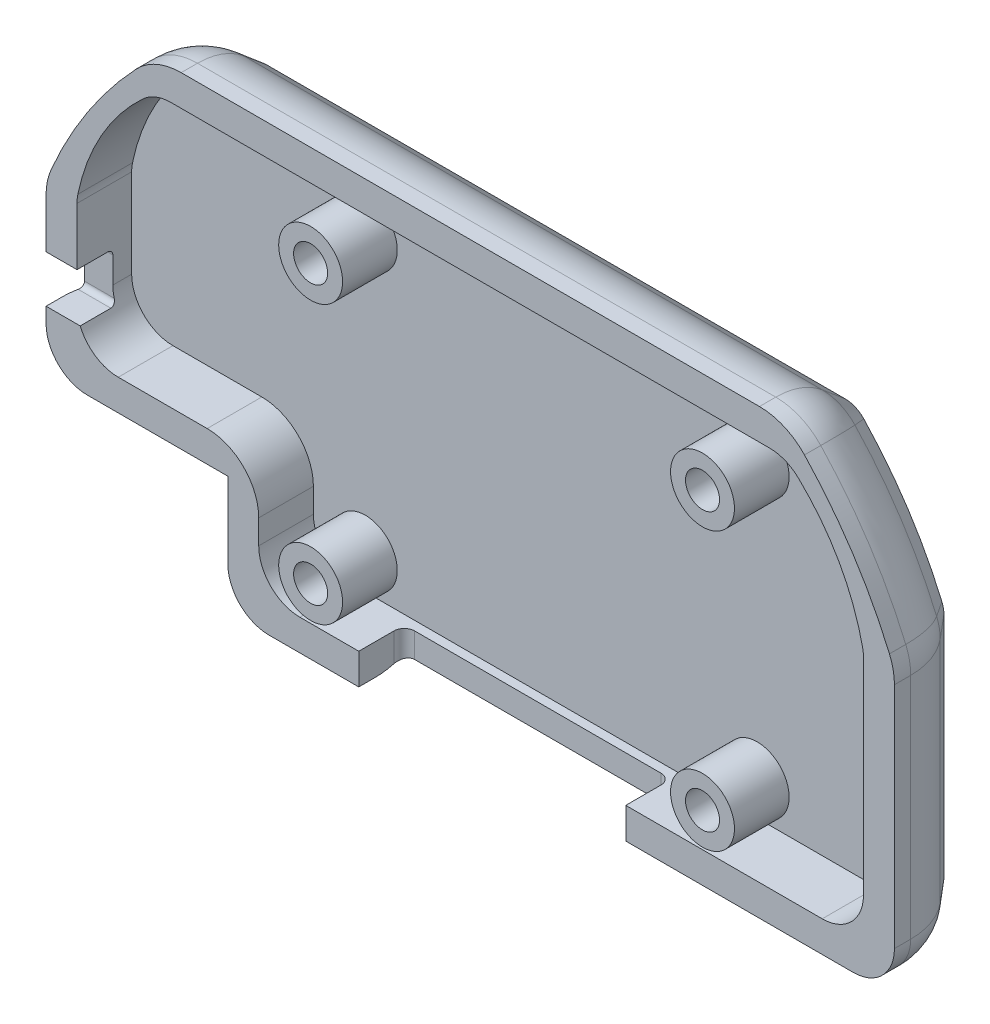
ISO-10303-21;
HEADER;
FILE_DESCRIPTION(('STEP AP214'),'2;1');
FILE_NAME('part.step','',(''),(''),'','','');
FILE_SCHEMA(('AUTOMOTIVE_DESIGN { 1 0 10303 214 1 1 1 1 }'));
ENDSEC;
DATA;
#1=APPLICATION_CONTEXT('core data for automotive mechanical design processes');
#2=APPLICATION_PROTOCOL_DEFINITION('international standard','automotive_design',2000,#1);
#3=PRODUCT_CONTEXT('',#1,'mechanical');
#4=PRODUCT('Part','Part','',(#3));
#5=PRODUCT_RELATED_PRODUCT_CATEGORY('part','',(#4));
#6=PRODUCT_DEFINITION_FORMATION('','',#4);
#7=PRODUCT_DEFINITION_CONTEXT('part definition',#1,'design');
#8=PRODUCT_DEFINITION('design','',#6,#7);
#9=PRODUCT_DEFINITION_SHAPE('','',#8);
#10=(LENGTH_UNIT() NAMED_UNIT(*) SI_UNIT(.MILLI.,.METRE.));
#11=(NAMED_UNIT(*) PLANE_ANGLE_UNIT() SI_UNIT($,.RADIAN.));
#12=(NAMED_UNIT(*) SI_UNIT($,.STERADIAN.) SOLID_ANGLE_UNIT());
#13=UNCERTAINTY_MEASURE_WITH_UNIT(LENGTH_MEASURE(1.E-05),#10,'distance_accuracy_value','');
#14=(GEOMETRIC_REPRESENTATION_CONTEXT(3) GLOBAL_UNCERTAINTY_ASSIGNED_CONTEXT((#13)) GLOBAL_UNIT_ASSIGNED_CONTEXT((#10,
#11,#12)) REPRESENTATION_CONTEXT('',''));
#15=CARTESIAN_POINT('',(0.,0.,0.));
#16=DIRECTION('',(0.,0.,1.));
#17=DIRECTION('',(1.,0.,0.));
#18=AXIS2_PLACEMENT_3D('',#15,#16,#17);
#19=CARTESIAN_POINT('',(-25.9800288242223,13.9787475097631,8.3));
#20=DIRECTION('',(0.,1.,0.));
#21=DIRECTION('',(0.,0.,1.));
#22=AXIS2_PLACEMENT_3D('',#19,#20,#21);
#23=PLANE('',#22);
#24=DIRECTION('',(1.,0.,0.));
#25=VECTOR('',#24,1.);
#26=CARTESIAN_POINT('',(34.6623891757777,13.9787475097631,6.71892921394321));
#27=LINE('',#26,#25);
#28=CARTESIAN_POINT('',(-21.9800288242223,13.9787475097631,6.71892921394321));
#29=VERTEX_POINT('',#28);
#30=CARTESIAN_POINT('',(-13.2786814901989,13.9787475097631,6.71892921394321));
#31=VERTEX_POINT('',#30);
#32=EDGE_CURVE('E872',#29,#31,#27,.T.);
#33=ORIENTED_EDGE('',*,*,#32,.T.);
#34=DIRECTION('',(-0.000102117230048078,0.,0.999999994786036));
#35=VECTOR('',#34,1.);
#36=CARTESIAN_POINT('',(-13.278843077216,13.9787475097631,8.30129700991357));
#37=LINE('',#36,#35);
#38=CARTESIAN_POINT('',(-13.2788429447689,13.9787475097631,8.3));
#39=VERTEX_POINT('',#38);
#40=EDGE_CURVE('E437',#31,#39,#37,.T.);
#41=ORIENTED_EDGE('',*,*,#40,.T.);
#42=DIRECTION('',(1.,0.,0.));
#43=VECTOR('',#42,1.);
#44=CARTESIAN_POINT('',(-25.9800288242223,13.9787475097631,8.3));
#45=LINE('',#44,#43);
#46=CARTESIAN_POINT('',(-21.9800288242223,13.9787475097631,8.3));
#47=VERTEX_POINT('',#46);
#48=EDGE_CURVE('E503',#47,#39,#45,.T.);
#49=ORIENTED_EDGE('',*,*,#48,.F.);
#50=DIRECTION('',(0.,0.,-1.));
#51=VECTOR('',#50,1.);
#52=CARTESIAN_POINT('',(-21.9800288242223,13.9787475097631,8.3));
#53=LINE('',#52,#51);
#54=EDGE_CURVE('E586',#47,#29,#53,.T.);
#55=ORIENTED_EDGE('',*,*,#54,.T.);
#56=EDGE_LOOP('',(#33,#41,#49,#55));
#57=FACE_BOUND('',#56,.T.);
#58=ADVANCED_FACE('F47',(#57),#23,.F.);
#59=CARTESIAN_POINT('',(-1.20971141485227,25.6867412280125,8.3));
#60=DIRECTION('',(0.,0.,-1.));
#61=DIRECTION('',(-1.,0.,0.));
#62=AXIS2_PLACEMENT_3D('',#59,#60,#61);
#63=PLANE('',#62);
#64=ORIENTED_EDGE('',*,*,#48,.T.);
#65=DIRECTION('',(0.,1.,0.));
#66=VECTOR('',#65,1.);
#67=CARTESIAN_POINT('',(-13.2788429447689,25.6867412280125,8.3));
#68=LINE('',#67,#66);
#69=CARTESIAN_POINT('',(-13.2788429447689,16.9787475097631,8.3));
#70=VERTEX_POINT('',#69);
#71=EDGE_CURVE('E1425',#39,#70,#68,.T.);
#72=ORIENTED_EDGE('',*,*,#71,.T.);
#73=DIRECTION('',(1.,0.,0.));
#74=VECTOR('',#73,1.);
#75=CARTESIAN_POINT('',(-22.9800288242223,16.9787475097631,8.3));
#76=LINE('',#75,#74);
#77=CARTESIAN_POINT('',(-18.9800288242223,16.9787475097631,8.3));
#78=VERTEX_POINT('',#77);
#79=EDGE_CURVE('E451',#78,#70,#76,.T.);
#80=ORIENTED_EDGE('',*,*,#79,.F.);
#81=CARTESIAN_POINT('',(-18.9800288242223,20.9787475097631,8.3));
#82=DIRECTION('',(0.,0.,-1.));
#83=DIRECTION('',(-1.,0.,0.));
#84=AXIS2_PLACEMENT_3D('',#81,#82,#83);
#85=CIRCLE('',#84,4.);
#86=CARTESIAN_POINT('',(-22.9800288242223,20.9787475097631,8.3));
#87=VERTEX_POINT('',#86);
#88=EDGE_CURVE('E622',#78,#87,#85,.T.);
#89=ORIENTED_EDGE('',*,*,#88,.T.);
#90=DIRECTION('',(0.,-1.,0.));
#91=VECTOR('',#90,1.);
#92=CARTESIAN_POINT('',(-22.9800288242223,28.3285133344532,8.3));
#93=LINE('',#92,#91);
#94=CARTESIAN_POINT('',(-22.9800288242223,23.3285133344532,8.3));
#95=VERTEX_POINT('',#94);
#96=EDGE_CURVE('E452',#95,#87,#93,.T.);
#97=ORIENTED_EDGE('',*,*,#96,.F.);
#98=CARTESIAN_POINT('',(-27.9800288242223,23.3285133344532,8.3));
#99=DIRECTION('',(0.,0.,-1.));
#100=DIRECTION('',(-1.,0.,0.));
#101=AXIS2_PLACEMENT_3D('',#98,#99,#100);
#102=CIRCLE('',#101,5.);
#103=CARTESIAN_POINT('',(-27.9800288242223,28.3285133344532,8.3));
#104=VERTEX_POINT('',#103);
#105=EDGE_CURVE('E968',#95,#104,#102,.F.);
#106=ORIENTED_EDGE('',*,*,#105,.T.);
#107=DIRECTION('',(1.,0.,0.));
#108=VECTOR('',#107,1.);
#109=CARTESIAN_POINT('',(-40.6000288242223,28.3285133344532,8.3));
#110=LINE('',#109,#108);
#111=CARTESIAN_POINT('',(-36.6000288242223,28.3285133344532,8.3));
#112=VERTEX_POINT('',#111);
#113=EDGE_CURVE('E457',#112,#104,#110,.T.);
#114=ORIENTED_EDGE('',*,*,#113,.F.);
#115=CARTESIAN_POINT('',(-36.6000288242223,32.3285133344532,8.3));
#116=DIRECTION('',(0.,0.,-1.));
#117=DIRECTION('',(-1.,0.,0.));
#118=AXIS2_PLACEMENT_3D('',#115,#116,#117);
#119=CIRCLE('',#118,4.);
#120=CARTESIAN_POINT('',(-40.2929382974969,30.7914968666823,8.3));
#121=VERTEX_POINT('',#120);
#122=EDGE_CURVE('E626',#112,#121,#119,.T.);
#123=ORIENTED_EDGE('',*,*,#122,.T.);
#124=DIRECTION('',(-1.,0.,0.));
#125=VECTOR('',#124,1.);
#126=CARTESIAN_POINT('',(-1.20971141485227,30.7914968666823,8.3));
#127=LINE('',#126,#125);
#128=CARTESIAN_POINT('',(-43.6000288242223,30.7914968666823,8.3));
#129=VERTEX_POINT('',#128);
#130=EDGE_CURVE('E1265',#121,#129,#127,.T.);
#131=ORIENTED_EDGE('',*,*,#130,.T.);
#132=DIRECTION('',(0.,-1.,0.));
#133=VECTOR('',#132,1.);
#134=CARTESIAN_POINT('',(-43.6000288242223,25.3285133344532,8.3));
#135=LINE('',#134,#133);
#136=CARTESIAN_POINT('',(-43.6000288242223,29.3285133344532,8.3));
#137=VERTEX_POINT('',#136);
#138=EDGE_CURVE('E490',#129,#137,#135,.T.);
#139=ORIENTED_EDGE('',*,*,#138,.T.);
#140=CARTESIAN_POINT('',(-39.6000288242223,29.3285133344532,8.3));
#141=DIRECTION('',(0.,0.,-1.));
#142=DIRECTION('',(-1.,0.,0.));
#143=AXIS2_PLACEMENT_3D('',#140,#141,#142);
#144=CIRCLE('',#143,4.);
#145=CARTESIAN_POINT('',(-39.6000288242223,25.3285133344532,8.3));
#146=VERTEX_POINT('',#145);
#147=EDGE_CURVE('E594',#137,#146,#144,.F.);
#148=ORIENTED_EDGE('',*,*,#147,.T.);
#149=DIRECTION('',(1.,0.,0.));
#150=VECTOR('',#149,1.);
#151=CARTESIAN_POINT('',(-43.6000288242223,25.3285133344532,8.3));
#152=LINE('',#151,#150);
#153=CARTESIAN_POINT('',(-25.9800288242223,25.3285133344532,8.3));
#154=VERTEX_POINT('',#153);
#155=EDGE_CURVE('E495',#146,#154,#152,.T.);
#156=ORIENTED_EDGE('',*,*,#155,.T.);
#157=DIRECTION('',(0.,-1.,0.));
#158=VECTOR('',#157,1.);
#159=CARTESIAN_POINT('',(-25.9800288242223,25.3285133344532,8.3));
#160=LINE('',#159,#158);
#161=CARTESIAN_POINT('',(-25.9800288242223,17.9787475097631,8.3));
#162=VERTEX_POINT('',#161);
#163=EDGE_CURVE('E498',#154,#162,#160,.T.);
#164=ORIENTED_EDGE('',*,*,#163,.T.);
#165=CARTESIAN_POINT('',(-21.9800288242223,17.9787475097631,8.3));
#166=DIRECTION('',(0.,0.,-1.));
#167=DIRECTION('',(-1.,0.,0.));
#168=AXIS2_PLACEMENT_3D('',#165,#166,#167);
#169=CIRCLE('',#168,4.);
#170=EDGE_CURVE('E597',#162,#47,#169,.F.);
#171=ORIENTED_EDGE('',*,*,#170,.T.);
#172=EDGE_LOOP('',(#64,#72,#80,#89,#97,#106,#114,#123,#131,#139,#148,#156,#164,#171));
#173=FACE_BOUND('',#172,.T.);
#174=ADVANCED_FACE('F1121',(#173),#63,.F.);
#175=CARTESIAN_POINT('',(-43.6000288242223,25.3285133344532,8.3));
#176=DIRECTION('',(1.,0.,0.));
#177=DIRECTION('',(0.,0.,-1.));
#178=AXIS2_PLACEMENT_3D('',#175,#176,#177);
#179=PLANE('',#178);
#180=DIRECTION('',(0.,-1.,0.));
#181=VECTOR('',#180,1.);
#182=CARTESIAN_POINT('',(-43.6000288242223,29.3285133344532,6.71892921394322));
#183=LINE('',#182,#181);
#184=CARTESIAN_POINT('',(-43.6000288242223,40.132445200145,6.71892921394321));
#185=VERTEX_POINT('',#184);
#186=CARTESIAN_POINT('',(-43.6000288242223,35.3574824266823,6.71892921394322));
#187=VERTEX_POINT('',#186);
#188=EDGE_CURVE('E810',#185,#187,#183,.T.);
#189=ORIENTED_EDGE('',*,*,#188,.T.);
#190=DIRECTION('',(0.,0.,-1.));
#191=VECTOR('',#190,1.);
#192=CARTESIAN_POINT('',(-43.6000288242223,35.3574824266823,8.62356916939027));
#193=LINE('',#192,#191);
#194=CARTESIAN_POINT('',(-43.6000288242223,35.3574824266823,8.3));
#195=VERTEX_POINT('',#194);
#196=EDGE_CURVE('E1480',#195,#187,#193,.T.);
#197=ORIENTED_EDGE('',*,*,#196,.F.);
#198=CARTESIAN_POINT('',(-43.6000288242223,40.132445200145,8.3));
#199=VERTEX_POINT('',#198);
#200=EDGE_CURVE('E491',#199,#195,#135,.T.);
#201=ORIENTED_EDGE('',*,*,#200,.F.);
#202=DIRECTION('',(0.,0.,-1.));
#203=VECTOR('',#202,1.);
#204=CARTESIAN_POINT('',(-43.6000288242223,40.132445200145,8.3));
#205=LINE('',#204,#203);
#206=EDGE_CURVE('E636',#199,#185,#205,.T.);
#207=ORIENTED_EDGE('',*,*,#206,.T.);
#208=EDGE_LOOP('',(#189,#197,#201,#207));
#209=FACE_BOUND('',#208,.T.);
#210=ADVANCED_FACE('F1128',(#209),#179,.F.);
#211=CARTESIAN_POINT('',(38.6623891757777,41.3129831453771,8.3));
#212=DIRECTION('',(-1.,0.,0.));
#213=DIRECTION('',(0.,0.,1.));
#214=AXIS2_PLACEMENT_3D('',#211,#212,#213);
#215=PLANE('',#214);
#216=DIRECTION('',(0.,0.,-1.));
#217=VECTOR('',#216,1.);
#218=CARTESIAN_POINT('',(38.6623891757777,17.9787475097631,8.3));
#219=LINE('',#218,#217);
#220=CARTESIAN_POINT('',(38.6623891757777,17.9787475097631,8.3));
#221=VERTEX_POINT('',#220);
#222=CARTESIAN_POINT('',(38.6623891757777,17.9787475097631,6.71892921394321));
#223=VERTEX_POINT('',#222);
#224=EDGE_CURVE('E582',#221,#223,#219,.T.);
#225=ORIENTED_EDGE('',*,*,#224,.T.);
#226=DIRECTION('',(0.,1.,0.));
#227=VECTOR('',#226,1.);
#228=CARTESIAN_POINT('',(38.6623891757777,40.1348205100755,6.71892921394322));
#229=LINE('',#228,#227);
#230=CARTESIAN_POINT('',(38.6623891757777,40.1348205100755,6.71892921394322));
#231=VERTEX_POINT('',#230);
#232=EDGE_CURVE('E859',#223,#231,#229,.T.);
#233=ORIENTED_EDGE('',*,*,#232,.T.);
#234=DIRECTION('',(0.,0.,-1.));
#235=VECTOR('',#234,1.);
#236=CARTESIAN_POINT('',(38.6623891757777,40.1348205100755,8.3));
#237=LINE('',#236,#235);
#238=CARTESIAN_POINT('',(38.6623891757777,40.1348205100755,8.3));
#239=VERTEX_POINT('',#238);
#240=EDGE_CURVE('E673',#231,#239,#237,.F.);
#241=ORIENTED_EDGE('',*,*,#240,.T.);
#242=DIRECTION('',(0.,1.,0.));
#243=VECTOR('',#242,1.);
#244=CARTESIAN_POINT('',(38.6623891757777,13.9787475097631,8.3));
#245=LINE('',#244,#243);
#246=EDGE_CURVE('E473',#221,#239,#245,.T.);
#247=ORIENTED_EDGE('',*,*,#246,.F.);
#248=EDGE_LOOP('',(#225,#233,#241,#247));
#249=FACE_BOUND('',#248,.T.);
#250=ADVANCED_FACE('F2231',(#249),#215,.F.);
#251=CARTESIAN_POINT('',(-1.20971141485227,25.6867412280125,8.3));
#252=DIRECTION('',(0.,0.,-1.));
#253=DIRECTION('',(-1.,0.,0.));
#254=AXIS2_PLACEMENT_3D('',#251,#252,#253);
#255=CYLINDRICAL_SURFACE('',#254,42.8248040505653);
#256=DIRECTION('',(0.,0.,-1.));
#257=VECTOR('',#256,1.);
#258=CARTESIAN_POINT('',(38.1812944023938,42.488898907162,8.3));
#259=LINE('',#258,#257);
#260=CARTESIAN_POINT('',(38.1812944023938,42.488898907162,8.3));
#261=VERTEX_POINT('',#260);
#262=CARTESIAN_POINT('',(38.1812944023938,42.488898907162,6.71892921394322));
#263=VERTEX_POINT('',#262);
#264=EDGE_CURVE('E669',#261,#263,#259,.T.);
#265=ORIENTED_EDGE('',*,*,#264,.T.);
#266=CARTESIAN_POINT('',(-1.20971141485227,25.6867412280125,6.71892921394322));
#267=DIRECTION('',(0.,0.,-1.));
#268=DIRECTION('',(-1.,0.,0.));
#269=AXIS2_PLACEMENT_3D('',#266,#267,#268);
#270=CIRCLE('',#269,42.8248040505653);
#271=CARTESIAN_POINT('',(29.9413661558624,55.0733743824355,6.71892921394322));
#272=VERTEX_POINT('',#271);
#273=EDGE_CURVE('E853',#263,#272,#270,.F.);
#274=ORIENTED_EDGE('',*,*,#273,.T.);
#275=DIRECTION('',(0.,0.,-1.));
#276=VECTOR('',#275,1.);
#277=CARTESIAN_POINT('',(29.9413661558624,55.0733743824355,8.3));
#278=LINE('',#277,#276);
#279=CARTESIAN_POINT('',(29.9413661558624,55.0733743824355,8.3));
#280=VERTEX_POINT('',#279);
#281=EDGE_CURVE('E666',#272,#280,#278,.F.);
#282=ORIENTED_EDGE('',*,*,#281,.T.);
#283=CARTESIAN_POINT('',(-1.20971141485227,25.6867412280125,8.3));
#284=DIRECTION('',(0.,0.,1.));
#285=DIRECTION('',(-1.,0.,0.));
#286=AXIS2_PLACEMENT_3D('',#283,#284,#285);
#287=CIRCLE('',#286,42.8248040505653);
#288=EDGE_CURVE('E477',#261,#280,#287,.T.);
#289=ORIENTED_EDGE('',*,*,#288,.F.);
#290=EDGE_LOOP('',(#265,#274,#282,#289));
#291=FACE_BOUND('',#290,.T.);
#292=ADVANCED_FACE('F2510',(#291),#255,.T.);
#293=CARTESIAN_POINT('',(-32.9688198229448,56.9561389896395,8.3));
#294=DIRECTION('',(0.,-1.,0.));
#295=DIRECTION('',(0.,0.,-1.));
#296=AXIS2_PLACEMENT_3D('',#293,#294,#295);
#297=PLANE('',#296);
#298=DIRECTION('',(0.,0.,-1.));
#299=VECTOR('',#298,1.);
#300=CARTESIAN_POINT('',(25.576922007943,56.9561389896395,8.3));
#301=LINE('',#300,#299);
#302=CARTESIAN_POINT('',(25.5769220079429,56.9561389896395,8.3));
#303=VERTEX_POINT('',#302);
#304=CARTESIAN_POINT('',(25.576922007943,56.9561389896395,6.71892921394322));
#305=VERTEX_POINT('',#304);
#306=EDGE_CURVE('E659',#303,#305,#301,.T.);
#307=ORIENTED_EDGE('',*,*,#306,.T.);
#308=DIRECTION('',(-1.,0.,0.));
#309=VECTOR('',#308,1.);
#310=CARTESIAN_POINT('',(-30.4984175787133,56.9561389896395,6.71892921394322));
#311=LINE('',#310,#309);
#312=CARTESIAN_POINT('',(-30.4984175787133,56.9561389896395,6.71892921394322));
#313=VERTEX_POINT('',#312);
#314=EDGE_CURVE('E841',#305,#313,#311,.T.);
#315=ORIENTED_EDGE('',*,*,#314,.T.);
#316=DIRECTION('',(0.,0.,-1.));
#317=VECTOR('',#316,1.);
#318=CARTESIAN_POINT('',(-30.4984175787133,56.9561389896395,8.3));
#319=LINE('',#318,#317);
#320=CARTESIAN_POINT('',(-30.4984175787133,56.9561389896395,8.3));
#321=VERTEX_POINT('',#320);
#322=EDGE_CURVE('E663',#313,#321,#319,.F.);
#323=ORIENTED_EDGE('',*,*,#322,.T.);
#324=DIRECTION('',(-1.,0.,0.));
#325=VECTOR('',#324,1.);
#326=CARTESIAN_POINT('',(-32.9688198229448,56.9561389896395,8.3));
#327=LINE('',#326,#325);
#328=EDGE_CURVE('E482',#303,#321,#327,.T.);
#329=ORIENTED_EDGE('',*,*,#328,.F.);
#330=EDGE_LOOP('',(#307,#315,#323,#329));
#331=FACE_BOUND('',#330,.T.);
#332=ADVANCED_FACE('F2502',(#331),#297,.F.);
#333=CARTESIAN_POINT('',(-3.73940136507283,25.6574978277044,8.3));
#334=DIRECTION('',(0.,0.,-1.));
#335=DIRECTION('',(-1.,0.,0.));
#336=AXIS2_PLACEMENT_3D('',#333,#334,#335);
#337=CYLINDRICAL_SURFACE('',#336,42.8248040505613);
#338=DIRECTION('',(0.,0.,-1.));
#339=VECTOR('',#338,1.);
#340=CARTESIAN_POINT('',(-34.8583619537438,55.0781391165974,8.3));
#341=LINE('',#340,#339);
#342=CARTESIAN_POINT('',(-34.8583619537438,55.0781391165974,8.3));
#343=VERTEX_POINT('',#342);
#344=CARTESIAN_POINT('',(-34.8583619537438,55.0781391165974,6.71892921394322));
#345=VERTEX_POINT('',#344);
#346=EDGE_CURVE('E640',#343,#345,#341,.T.);
#347=ORIENTED_EDGE('',*,*,#346,.T.);
#348=CARTESIAN_POINT('',(-3.73940136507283,25.6574978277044,6.71892921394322));
#349=DIRECTION('',(0.,0.,-1.));
#350=DIRECTION('',(-1.,0.,0.));
#351=AXIS2_PLACEMENT_3D('',#348,#349,#350);
#352=CIRCLE('',#351,42.8248040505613);
#353=CARTESIAN_POINT('',(-43.1170646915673,42.4909013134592,6.71892921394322));
#354=VERTEX_POINT('',#353);
#355=EDGE_CURVE('E823',#345,#354,#352,.F.);
#356=ORIENTED_EDGE('',*,*,#355,.T.);
#357=DIRECTION('',(0.,0.,-1.));
#358=VECTOR('',#357,1.);
#359=CARTESIAN_POINT('',(-43.1170646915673,42.4909013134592,8.3));
#360=LINE('',#359,#358);
#361=CARTESIAN_POINT('',(-43.1170646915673,42.4909013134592,8.3));
#362=VERTEX_POINT('',#361);
#363=EDGE_CURVE('E644',#354,#362,#360,.F.);
#364=ORIENTED_EDGE('',*,*,#363,.T.);
#365=CARTESIAN_POINT('',(-3.73940136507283,25.6574978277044,8.3));
#366=DIRECTION('',(0.,0.,1.));
#367=DIRECTION('',(-1.,0.,0.));
#368=AXIS2_PLACEMENT_3D('',#365,#366,#367);
#369=CIRCLE('',#368,42.8248040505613);
#370=EDGE_CURVE('E486',#343,#362,#369,.T.);
#371=ORIENTED_EDGE('',*,*,#370,.F.);
#372=EDGE_LOOP('',(#347,#356,#364,#371));
#373=FACE_BOUND('',#372,.T.);
#374=ADVANCED_FACE('F2472',(#373),#337,.T.);
#375=ORIENTED_EDGE('',*,*,#138,.F.);
#376=DIRECTION('',(0.,0.,1.));
#377=VECTOR('',#376,1.);
#378=CARTESIAN_POINT('',(-43.6000288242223,30.7914968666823,4.82921425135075));
#379=LINE('',#378,#377);
#380=CARTESIAN_POINT('',(-43.6000288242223,30.7914968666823,6.71892921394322));
#381=VERTEX_POINT('',#380);
#382=EDGE_CURVE('E1274',#381,#129,#379,.T.);
#383=ORIENTED_EDGE('',*,*,#382,.F.);
#384=CARTESIAN_POINT('',(-43.6000288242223,29.3285133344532,6.71892921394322));
#385=VERTEX_POINT('',#384);
#386=EDGE_CURVE('E809',#381,#385,#183,.T.);
#387=ORIENTED_EDGE('',*,*,#386,.T.);
#388=DIRECTION('',(0.,0.,-1.));
#389=VECTOR('',#388,1.);
#390=CARTESIAN_POINT('',(-43.6000288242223,29.3285133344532,8.3));
#391=LINE('',#390,#389);
#392=EDGE_CURVE('E610',#385,#137,#391,.F.);
#393=ORIENTED_EDGE('',*,*,#392,.T.);
#394=EDGE_LOOP('',(#375,#383,#387,#393));
#395=FACE_BOUND('',#394,.T.);
#396=ADVANCED_FACE('F1273',(#395),#179,.F.);
#397=CARTESIAN_POINT('',(-43.6000288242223,25.3285133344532,8.3));
#398=DIRECTION('',(0.,1.,0.));
#399=DIRECTION('',(0.,0.,1.));
#400=AXIS2_PLACEMENT_3D('',#397,#398,#399);
#401=PLANE('',#400);
#402=DIRECTION('',(0.,0.,-1.));
#403=VECTOR('',#402,1.);
#404=CARTESIAN_POINT('',(-39.6000288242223,25.3285133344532,8.3));
#405=LINE('',#404,#403);
#406=CARTESIAN_POINT('',(-39.6000288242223,25.3285133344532,6.71892921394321));
#407=VERTEX_POINT('',#406);
#408=EDGE_CURVE('E606',#146,#407,#405,.T.);
#409=ORIENTED_EDGE('',*,*,#408,.T.);
#410=DIRECTION('',(1.,0.,0.));
#411=VECTOR('',#410,1.);
#412=CARTESIAN_POINT('',(-25.9800288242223,25.3285133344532,6.71892921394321));
#413=LINE('',#412,#411);
#414=CARTESIAN_POINT('',(-25.9800288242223,25.3285133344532,6.71892921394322));
#415=VERTEX_POINT('',#414);
#416=EDGE_CURVE('E797',#407,#415,#413,.T.);
#417=ORIENTED_EDGE('',*,*,#416,.T.);
#418=DIRECTION('',(0.,0.,-1.));
#419=VECTOR('',#418,1.);
#420=CARTESIAN_POINT('',(-25.9800288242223,25.3285133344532,8.3));
#421=LINE('',#420,#419);
#422=EDGE_CURVE('E507',#154,#415,#421,.T.);
#423=ORIENTED_EDGE('',*,*,#422,.F.);
#424=ORIENTED_EDGE('',*,*,#155,.F.);
#425=EDGE_LOOP('',(#409,#417,#423,#424));
#426=FACE_BOUND('',#425,.T.);
#427=ADVANCED_FACE('F1141',(#426),#401,.F.);
#428=CARTESIAN_POINT('',(-25.9800288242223,25.3285133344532,8.3));
#429=DIRECTION('',(1.,0.,0.));
#430=DIRECTION('',(0.,0.,-1.));
#431=AXIS2_PLACEMENT_3D('',#428,#429,#430);
#432=PLANE('',#431);
#433=ORIENTED_EDGE('',*,*,#422,.T.);
#434=DIRECTION('',(0.,-1.,0.));
#435=VECTOR('',#434,1.);
#436=CARTESIAN_POINT('',(-25.9800288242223,17.9787475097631,6.71892921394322));
#437=LINE('',#436,#435);
#438=CARTESIAN_POINT('',(-25.9800288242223,17.9787475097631,6.71892921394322));
#439=VERTEX_POINT('',#438);
#440=EDGE_CURVE('E803',#415,#439,#437,.T.);
#441=ORIENTED_EDGE('',*,*,#440,.T.);
#442=DIRECTION('',(0.,0.,-1.));
#443=VECTOR('',#442,1.);
#444=CARTESIAN_POINT('',(-25.9800288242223,17.9787475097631,8.3));
#445=LINE('',#444,#443);
#446=EDGE_CURVE('E603',#439,#162,#445,.F.);
#447=ORIENTED_EDGE('',*,*,#446,.T.);
#448=ORIENTED_EDGE('',*,*,#163,.F.);
#449=EDGE_LOOP('',(#433,#441,#447,#448));
#450=FACE_BOUND('',#449,.T.);
#451=ADVANCED_FACE('F1134',(#450),#432,.F.);
#452=CARTESIAN_POINT('',(12.6103253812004,13.9787475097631,8.3));
#453=VERTEX_POINT('',#452);
#454=CARTESIAN_POINT('',(34.6623891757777,13.9787475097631,8.3));
#455=VERTEX_POINT('',#454);
#456=EDGE_CURVE('E502',#453,#455,#45,.T.);
#457=ORIENTED_EDGE('',*,*,#456,.F.);
#458=DIRECTION('',(0.,0.,-1.));
#459=VECTOR('',#458,1.);
#460=CARTESIAN_POINT('',(12.6103253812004,13.9787475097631,8.29999999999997));
#461=LINE('',#460,#459);
#462=CARTESIAN_POINT('',(12.6103253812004,13.9787475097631,6.71892921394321));
#463=VERTEX_POINT('',#462);
#464=EDGE_CURVE('E432',#453,#463,#461,.T.);
#465=ORIENTED_EDGE('',*,*,#464,.T.);
#466=CARTESIAN_POINT('',(34.6623891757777,13.9787475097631,6.71892921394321));
#467=VERTEX_POINT('',#466);
#468=EDGE_CURVE('E871',#463,#467,#27,.T.);
#469=ORIENTED_EDGE('',*,*,#468,.T.);
#470=DIRECTION('',(0.,0.,-1.));
#471=VECTOR('',#470,1.);
#472=CARTESIAN_POINT('',(34.6623891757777,13.9787475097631,8.3));
#473=LINE('',#472,#471);
#474=EDGE_CURVE('E590',#467,#455,#473,.F.);
#475=ORIENTED_EDGE('',*,*,#474,.T.);
#476=EDGE_LOOP('',(#457,#465,#469,#475));
#477=FACE_BOUND('',#476,.T.);
#478=ADVANCED_FACE('F1124',(#477),#23,.F.);
#479=CARTESIAN_POINT('',(12.6103253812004,16.9787475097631,8.3));
#480=VERTEX_POINT('',#479);
#481=CARTESIAN_POINT('',(31.6623891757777,16.9787475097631,8.3));
#482=VERTEX_POINT('',#481);
#483=EDGE_CURVE('E441',#480,#482,#76,.T.);
#484=ORIENTED_EDGE('',*,*,#483,.F.);
#485=DIRECTION('',(0.,-1.,0.));
#486=VECTOR('',#485,1.);
#487=CARTESIAN_POINT('',(12.6103253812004,25.6867412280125,8.3));
#488=LINE('',#487,#486);
#489=EDGE_CURVE('E428',#480,#453,#488,.T.);
#490=ORIENTED_EDGE('',*,*,#489,.T.);
#491=ORIENTED_EDGE('',*,*,#456,.T.);
#492=CARTESIAN_POINT('',(34.6623891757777,17.9787475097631,8.3));
#493=DIRECTION('',(0.,0.,-1.));
#494=DIRECTION('',(-1.,0.,0.));
#495=AXIS2_PLACEMENT_3D('',#492,#493,#494);
#496=CIRCLE('',#495,4.);
#497=EDGE_CURVE('E600',#455,#221,#496,.F.);
#498=ORIENTED_EDGE('',*,*,#497,.T.);
#499=ORIENTED_EDGE('',*,*,#246,.T.);
#500=CARTESIAN_POINT('',(32.6623891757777,40.1348205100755,8.3));
#501=DIRECTION('',(0.,0.,-1.));
#502=DIRECTION('',(-1.,0.,0.));
#503=AXIS2_PLACEMENT_3D('',#500,#501,#502);
#504=CIRCLE('',#503,6.);
#505=EDGE_CURVE('E650',#239,#261,#504,.F.);
#506=ORIENTED_EDGE('',*,*,#505,.T.);
#507=ORIENTED_EDGE('',*,*,#288,.T.);
#508=CARTESIAN_POINT('',(25.576922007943,50.9561389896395,8.3));
#509=DIRECTION('',(0.,0.,-1.));
#510=DIRECTION('',(-1.,0.,0.));
#511=AXIS2_PLACEMENT_3D('',#508,#509,#510);
#512=CIRCLE('',#511,6.);
#513=EDGE_CURVE('E647',#280,#303,#512,.F.);
#514=ORIENTED_EDGE('',*,*,#513,.T.);
#515=ORIENTED_EDGE('',*,*,#328,.T.);
#516=CARTESIAN_POINT('',(-30.4984175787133,50.9561389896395,8.3));
#517=DIRECTION('',(0.,0.,-1.));
#518=DIRECTION('',(-1.,0.,0.));
#519=AXIS2_PLACEMENT_3D('',#516,#517,#518);
#520=CIRCLE('',#519,6.);
#521=EDGE_CURVE('E653',#321,#343,#520,.F.);
#522=ORIENTED_EDGE('',*,*,#521,.T.);
#523=ORIENTED_EDGE('',*,*,#370,.T.);
#524=CARTESIAN_POINT('',(-37.6000288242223,40.132445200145,8.3));
#525=DIRECTION('',(0.,0.,-1.));
#526=DIRECTION('',(-1.,0.,0.));
#527=AXIS2_PLACEMENT_3D('',#524,#525,#526);
#528=CIRCLE('',#527,6.);
#529=EDGE_CURVE('E656',#362,#199,#528,.F.);
#530=ORIENTED_EDGE('',*,*,#529,.T.);
#531=ORIENTED_EDGE('',*,*,#200,.T.);
#532=DIRECTION('',(1.,0.,0.));
#533=VECTOR('',#532,1.);
#534=CARTESIAN_POINT('',(-1.20971141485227,35.3574824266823,8.3));
#535=LINE('',#534,#533);
#536=CARTESIAN_POINT('',(-40.6000288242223,35.3574824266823,8.3));
#537=VERTEX_POINT('',#536);
#538=EDGE_CURVE('E1494',#195,#537,#535,.T.);
#539=ORIENTED_EDGE('',*,*,#538,.T.);
#540=DIRECTION('',(0.,-1.,0.));
#541=VECTOR('',#540,1.);
#542=CARTESIAN_POINT('',(-40.6000288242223,41.3129831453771,8.3));
#543=LINE('',#542,#541);
#544=CARTESIAN_POINT('',(-40.6000288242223,40.926430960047,8.3));
#545=VERTEX_POINT('',#544);
#546=EDGE_CURVE('E1186',#545,#537,#543,.T.);
#547=ORIENTED_EDGE('',*,*,#546,.F.);
#548=CARTESIAN_POINT('',(-36.6000288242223,40.926430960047,8.3));
#549=DIRECTION('',(0.,0.,-1.));
#550=DIRECTION('',(-1.,0.,0.));
#551=AXIS2_PLACEMENT_3D('',#548,#549,#550);
#552=CIRCLE('',#551,4.);
#553=CARTESIAN_POINT('',(-40.5175109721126,41.7347215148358,8.3));
#554=VERTEX_POINT('',#553);
#555=EDGE_CURVE('E633',#545,#554,#552,.T.);
#556=ORIENTED_EDGE('',*,*,#555,.T.);
#557=CARTESIAN_POINT('',(-19.9939940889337,37.5001228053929,8.3));
#558=DIRECTION('',(0.,0.,1.));
#559=DIRECTION('',(-1.,0.,0.));
#560=AXIS2_PLACEMENT_3D('',#557,#558,#559);
#561=CIRCLE('',#560,20.9558242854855);
#562=CARTESIAN_POINT('',(-34.2121718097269,52.8946021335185,8.3));
#563=VERTEX_POINT('',#562);
#564=EDGE_CURVE('E783',#563,#554,#561,.T.);
#565=ORIENTED_EDGE('',*,*,#564,.F.);
#566=CARTESIAN_POINT('',(-31.4982384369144,49.9561389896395,8.3));
#567=DIRECTION('',(0.,0.,-1.));
#568=DIRECTION('',(-1.,0.,0.));
#569=AXIS2_PLACEMENT_3D('',#566,#567,#568);
#570=CIRCLE('',#569,4.);
#571=CARTESIAN_POINT('',(-31.4982384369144,53.9561389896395,8.3));
#572=VERTEX_POINT('',#571);
#573=EDGE_CURVE('E630',#563,#572,#570,.T.);
#574=ORIENTED_EDGE('',*,*,#573,.T.);
#575=DIRECTION('',(-1.,0.,0.));
#576=VECTOR('',#575,1.);
#577=CARTESIAN_POINT('',(-32.9688198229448,53.9561389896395,8.3));
#578=LINE('',#577,#576);
#579=CARTESIAN_POINT('',(26.5725591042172,53.9561389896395,8.3));
#580=VERTEX_POINT('',#579);
#581=EDGE_CURVE('E468',#580,#572,#578,.T.);
#582=ORIENTED_EDGE('',*,*,#581,.F.);
#583=CARTESIAN_POINT('',(26.5725591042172,49.9561389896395,8.3));
#584=DIRECTION('',(0.,0.,-1.));
#585=DIRECTION('',(-1.,0.,0.));
#586=AXIS2_PLACEMENT_3D('',#583,#584,#585);
#587=CIRCLE('',#586,4.);
#588=CARTESIAN_POINT('',(29.3225025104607,52.860930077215,8.3));
#589=VERTEX_POINT('',#588);
#590=EDGE_CURVE('E619',#580,#589,#587,.T.);
#591=ORIENTED_EDGE('',*,*,#590,.T.);
#592=CARTESIAN_POINT('',(14.5102959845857,37.2146569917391,8.3));
#593=DIRECTION('',(0.,0.,1.));
#594=DIRECTION('',(-1.,0.,0.));
#595=AXIS2_PLACEMENT_3D('',#592,#593,#594);
#596=CIRCLE('',#595,21.5454710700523);
#597=CARTESIAN_POINT('',(35.5727072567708,41.7514129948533,8.3));
#598=VERTEX_POINT('',#597);
#599=EDGE_CURVE('E464',#598,#589,#596,.T.);
#600=ORIENTED_EDGE('',*,*,#599,.F.);
#601=CARTESIAN_POINT('',(31.6623891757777,40.9091467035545,8.3));
#602=DIRECTION('',(0.,0.,-1.));
#603=DIRECTION('',(-1.,0.,0.));
#604=AXIS2_PLACEMENT_3D('',#601,#602,#603);
#605=CIRCLE('',#604,4.);
#606=CARTESIAN_POINT('',(35.6623891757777,40.9091467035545,8.3));
#607=VERTEX_POINT('',#606);
#608=EDGE_CURVE('E616',#598,#607,#605,.T.);
#609=ORIENTED_EDGE('',*,*,#608,.T.);
#610=DIRECTION('',(0.,1.,0.));
#611=VECTOR('',#610,1.);
#612=CARTESIAN_POINT('',(35.6623891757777,41.3129831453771,8.3));
#613=LINE('',#612,#611);
#614=CARTESIAN_POINT('',(35.6623891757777,20.9787475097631,8.3));
#615=VERTEX_POINT('',#614);
#616=EDGE_CURVE('E456',#615,#607,#613,.T.);
#617=ORIENTED_EDGE('',*,*,#616,.F.);
#618=CARTESIAN_POINT('',(31.6623891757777,20.9787475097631,8.3));
#619=DIRECTION('',(0.,0.,-1.));
#620=DIRECTION('',(-1.,0.,0.));
#621=AXIS2_PLACEMENT_3D('',#618,#619,#620);
#622=CIRCLE('',#621,4.);
#623=EDGE_CURVE('E448',#615,#482,#622,.T.);
#624=ORIENTED_EDGE('',*,*,#623,.T.);
#625=EDGE_LOOP('',(#484,#490,#491,#498,#499,#506,#507,#514,#515,#522,#523,#530,#531,#539,#547,
#556,#565,#574,#582,#591,#600,#609,#617,#624));
#626=FACE_BOUND('',#625,.T.);
#627=ADVANCED_FACE('F446',(#626),#63,.F.);
#628=CARTESIAN_POINT('',(-1.20971141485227,25.6867412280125,0.));
#629=DIRECTION('',(0.,0.,-1.));
#630=DIRECTION('',(-1.,0.,0.));
#631=AXIS2_PLACEMENT_3D('',#628,#629,#630);
#632=PLANE('',#631);
#633=CARTESIAN_POINT('',(20.0535481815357,47.1866983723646,0.));
#634=DIRECTION('',(0.,0.,-1.));
#635=DIRECTION('',(-1.,0.,0.));
#636=AXIS2_PLACEMENT_3D('',#633,#634,#635);
#637=CIRCLE('',#636,2.775);
#638=CARTESIAN_POINT('',(17.2785481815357,47.1866983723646,0.));
#639=VERTEX_POINT('',#638);
#640=EDGE_CURVE('E1498',#639,#639,#637,.T.);
#641=ORIENTED_EDGE('',*,*,#640,.F.);
#642=EDGE_LOOP('',(#641));
#643=FACE_BOUND('',#642,.T.);
#644=CARTESIAN_POINT('',(-17.9464518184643,20.3217423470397,0.));
#645=DIRECTION('',(0.,0.,-1.));
#646=DIRECTION('',(-1.,0.,0.));
#647=AXIS2_PLACEMENT_3D('',#644,#645,#646);
#648=CIRCLE('',#647,2.755);
#649=CARTESIAN_POINT('',(-20.7014518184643,20.3217423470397,0.));
#650=VERTEX_POINT('',#649);
#651=EDGE_CURVE('E1503',#650,#650,#648,.T.);
#652=ORIENTED_EDGE('',*,*,#651,.F.);
#653=EDGE_LOOP('',(#652));
#654=FACE_BOUND('',#653,.T.);
#655=CARTESIAN_POINT('',(-17.9464518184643,47.2217423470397,0.));
#656=DIRECTION('',(0.,0.,-1.));
#657=DIRECTION('',(-1.,0.,0.));
#658=AXIS2_PLACEMENT_3D('',#655,#656,#657);
#659=CIRCLE('',#658,2.775);
#660=CARTESIAN_POINT('',(-20.7214518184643,47.2217423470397,0.));
#661=VERTEX_POINT('',#660);
#662=EDGE_CURVE('E1499',#661,#661,#659,.T.);
#663=ORIENTED_EDGE('',*,*,#662,.F.);
#664=EDGE_LOOP('',(#663));
#665=FACE_BOUND('',#664,.T.);
#666=CARTESIAN_POINT('',(20.0535481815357,20.2866983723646,0.));
#667=DIRECTION('',(0.,0.,-1.));
#668=DIRECTION('',(-1.,0.,0.));
#669=AXIS2_PLACEMENT_3D('',#666,#667,#668);
#670=CIRCLE('',#669,2.775);
#671=CARTESIAN_POINT('',(17.2785481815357,20.2866983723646,0.));
#672=VERTEX_POINT('',#671);
#673=EDGE_CURVE('E943',#672,#672,#670,.T.);
#674=ORIENTED_EDGE('',*,*,#673,.F.);
#675=EDGE_LOOP('',(#674));
#676=FACE_BOUND('',#675,.T.);
#677=DIRECTION('',(1.,0.,0.));
#678=VECTOR('',#677,1.);
#679=CARTESIAN_POINT('',(25.5769220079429,53.4561389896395,0.));
#680=LINE('',#679,#678);
#681=CARTESIAN_POINT('',(-30.4984175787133,53.4561389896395,0.));
#682=VERTEX_POINT('',#681);
#683=CARTESIAN_POINT('',(25.576922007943,53.4561389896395,0.));
#684=VERTEX_POINT('',#683);
#685=EDGE_CURVE('E722',#682,#684,#680,.T.);
#686=ORIENTED_EDGE('',*,*,#685,.T.);
#687=CARTESIAN_POINT('',(25.576922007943,50.9561389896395,0.));
#688=DIRECTION('',(0.,0.,-1.));
#689=DIRECTION('',(-1.,0.,0.));
#690=AXIS2_PLACEMENT_3D('',#687,#688,#689);
#691=CIRCLE('',#690,2.49999999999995);
#692=CARTESIAN_POINT('',(27.3954404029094,52.6716537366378,0.));
#693=VERTEX_POINT('',#692);
#694=EDGE_CURVE('E725',#684,#693,#691,.T.);
#695=ORIENTED_EDGE('',*,*,#694,.T.);
#696=CARTESIAN_POINT('',(-1.20971141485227,25.6867412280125,0.));
#697=DIRECTION('',(0.,0.,-1.));
#698=DIRECTION('',(-1.,0.,0.));
#699=AXIS2_PLACEMENT_3D('',#696,#697,#698);
#700=CIRCLE('',#699,39.3248040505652);
#701=CARTESIAN_POINT('',(34.961933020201,41.1156865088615,0.));
#702=VERTEX_POINT('',#701);
#703=EDGE_CURVE('E676',#693,#702,#700,.T.);
#704=ORIENTED_EDGE('',*,*,#703,.T.);
#705=CARTESIAN_POINT('',(32.6623891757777,40.1348205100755,0.));
#706=DIRECTION('',(0.,0.,-1.));
#707=DIRECTION('',(-1.,0.,0.));
#708=AXIS2_PLACEMENT_3D('',#705,#706,#707);
#709=CIRCLE('',#708,2.49999999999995);
#710=CARTESIAN_POINT('',(35.1623891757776,40.1348205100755,0.));
#711=VERTEX_POINT('',#710);
#712=EDGE_CURVE('E680',#702,#711,#709,.T.);
#713=ORIENTED_EDGE('',*,*,#712,.T.);
#714=DIRECTION('',(0.,-1.,0.));
#715=VECTOR('',#714,1.);
#716=CARTESIAN_POINT('',(35.1623891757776,17.9787475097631,0.));
#717=LINE('',#716,#715);
#718=CARTESIAN_POINT('',(35.1623891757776,17.9787475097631,0.));
#719=VERTEX_POINT('',#718);
#720=EDGE_CURVE('E684',#711,#719,#717,.T.);
#721=ORIENTED_EDGE('',*,*,#720,.T.);
#722=CARTESIAN_POINT('',(34.6623891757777,17.9787475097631,0.));
#723=DIRECTION('',(0.,0.,-1.));
#724=DIRECTION('',(-1.,0.,0.));
#725=AXIS2_PLACEMENT_3D('',#722,#723,#724);
#726=CIRCLE('',#725,0.499999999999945);
#727=CARTESIAN_POINT('',(34.6623891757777,17.4787475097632,0.));
#728=VERTEX_POINT('',#727);
#729=EDGE_CURVE('E688',#719,#728,#726,.T.);
#730=ORIENTED_EDGE('',*,*,#729,.T.);
#731=DIRECTION('',(-1.,0.,0.));
#732=VECTOR('',#731,1.);
#733=CARTESIAN_POINT('',(-21.9800288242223,17.4787475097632,0.));
#734=LINE('',#733,#732);
#735=CARTESIAN_POINT('',(-21.9800288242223,17.4787475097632,0.));
#736=VERTEX_POINT('',#735);
#737=EDGE_CURVE('E692',#728,#736,#734,.T.);
#738=ORIENTED_EDGE('',*,*,#737,.T.);
#739=CARTESIAN_POINT('',(-21.9800288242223,17.9787475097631,0.));
#740=DIRECTION('',(0.,0.,-1.));
#741=DIRECTION('',(-1.,0.,0.));
#742=AXIS2_PLACEMENT_3D('',#739,#740,#741);
#743=CIRCLE('',#742,0.499999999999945);
#744=CARTESIAN_POINT('',(-22.4800288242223,17.9787475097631,0.));
#745=VERTEX_POINT('',#744);
#746=EDGE_CURVE('E696',#736,#745,#743,.T.);
#747=ORIENTED_EDGE('',*,*,#746,.T.);
#748=DIRECTION('',(0.,1.,0.));
#749=VECTOR('',#748,1.);
#750=CARTESIAN_POINT('',(-22.4800288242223,25.3285133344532,0.));
#751=LINE('',#750,#749);
#752=CARTESIAN_POINT('',(-22.4800288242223,28.8285133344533,0.));
#753=VERTEX_POINT('',#752);
#754=EDGE_CURVE('E700',#745,#753,#751,.T.);
#755=ORIENTED_EDGE('',*,*,#754,.T.);
#756=DIRECTION('',(-1.,0.,0.));
#757=VECTOR('',#756,1.);
#758=CARTESIAN_POINT('',(-39.6000288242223,28.8285133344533,0.));
#759=LINE('',#758,#757);
#760=CARTESIAN_POINT('',(-39.6000288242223,28.8285133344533,0.));
#761=VERTEX_POINT('',#760);
#762=EDGE_CURVE('E704',#753,#761,#759,.T.);
#763=ORIENTED_EDGE('',*,*,#762,.T.);
#764=CARTESIAN_POINT('',(-39.6000288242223,29.3285133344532,0.));
#765=DIRECTION('',(0.,0.,-1.));
#766=DIRECTION('',(-1.,0.,0.));
#767=AXIS2_PLACEMENT_3D('',#764,#765,#766);
#768=CIRCLE('',#767,0.499999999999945);
#769=CARTESIAN_POINT('',(-40.1000288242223,29.3285133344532,0.));
#770=VERTEX_POINT('',#769);
#771=EDGE_CURVE('E707',#761,#770,#768,.T.);
#772=ORIENTED_EDGE('',*,*,#771,.T.);
#773=DIRECTION('',(0.,1.,0.));
#774=VECTOR('',#773,1.);
#775=CARTESIAN_POINT('',(-40.1000288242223,40.132445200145,0.));
#776=LINE('',#775,#774);
#777=CARTESIAN_POINT('',(-40.1000288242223,40.132445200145,0.));
#778=VERTEX_POINT('',#777);
#779=EDGE_CURVE('E710',#770,#778,#776,.T.);
#780=ORIENTED_EDGE('',*,*,#779,.T.);
#781=CARTESIAN_POINT('',(-37.6000288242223,40.132445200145,0.));
#782=DIRECTION('',(0.,0.,-1.));
#783=DIRECTION('',(-1.,0.,0.));
#784=AXIS2_PLACEMENT_3D('',#781,#782,#783);
#785=CIRCLE('',#784,2.49999999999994);
#786=CARTESIAN_POINT('',(-39.8987937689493,41.1151352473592,0.));
#787=VERTEX_POINT('',#786);
#788=EDGE_CURVE('E713',#778,#787,#785,.T.);
#789=ORIENTED_EDGE('',*,*,#788,.T.);
#790=CARTESIAN_POINT('',(-3.73940136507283,25.6574978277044,0.));
#791=DIRECTION('',(0.,0.,-1.));
#792=DIRECTION('',(-1.,0.,0.));
#793=AXIS2_PLACEMENT_3D('',#790,#791,#792);
#794=CIRCLE('',#793,39.3248040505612);
#795=CARTESIAN_POINT('',(-32.3150610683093,52.6736390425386,0.));
#796=VERTEX_POINT('',#795);
#797=EDGE_CURVE('E716',#787,#796,#794,.T.);
#798=ORIENTED_EDGE('',*,*,#797,.T.);
#799=CARTESIAN_POINT('',(-30.4984175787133,50.9561389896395,0.));
#800=DIRECTION('',(0.,0.,-1.));
#801=DIRECTION('',(-1.,0.,0.));
#802=AXIS2_PLACEMENT_3D('',#799,#800,#801);
#803=CIRCLE('',#802,2.49999999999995);
#804=EDGE_CURVE('E719',#796,#682,#803,.T.);
#805=ORIENTED_EDGE('',*,*,#804,.T.);
#806=EDGE_LOOP('',(#686,#695,#704,#713,#721,#730,#738,#747,#755,#763,#772,#780,#789,#798,#805));
#807=FACE_BOUND('',#806,.T.);
#808=ADVANCED_FACE('F1140',(#643,#654,#665,#676,#807),#632,.T.);
#809=CARTESIAN_POINT('',(-19.9939940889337,37.5001228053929,3.));
#810=DIRECTION('',(0.,0.,1.));
#811=DIRECTION('',(1.,0.,0.));
#812=AXIS2_PLACEMENT_3D('',#809,#810,#811);
#813=CYLINDRICAL_SURFACE('',#812,20.9558242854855);
#814=CARTESIAN_POINT('',(-19.9939940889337,37.5001228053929,3.));
#815=DIRECTION('',(0.,0.,1.));
#816=DIRECTION('',(-1.,0.,0.));
#817=AXIS2_PLACEMENT_3D('',#814,#815,#816);
#818=CIRCLE('',#817,20.9558242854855);
#819=CARTESIAN_POINT('',(-34.2121718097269,52.8946021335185,3.));
#820=VERTEX_POINT('',#819);
#821=CARTESIAN_POINT('',(-40.5175109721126,41.7347215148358,3.));
#822=VERTEX_POINT('',#821);
#823=EDGE_CURVE('E472',#820,#822,#818,.T.);
#824=ORIENTED_EDGE('',*,*,#823,.F.);
#825=DIRECTION('',(0.,0.,1.));
#826=VECTOR('',#825,1.);
#827=CARTESIAN_POINT('',(-34.2121718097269,52.8946021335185,3.));
#828=LINE('',#827,#826);
#829=EDGE_CURVE('E578',#820,#563,#828,.T.);
#830=ORIENTED_EDGE('',*,*,#829,.T.);
#831=ORIENTED_EDGE('',*,*,#564,.T.);
#832=DIRECTION('',(0.,0.,1.));
#833=VECTOR('',#832,1.);
#834=CARTESIAN_POINT('',(-40.5175109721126,41.7347215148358,3.));
#835=LINE('',#834,#833);
#836=EDGE_CURVE('E575',#554,#822,#835,.F.);
#837=ORIENTED_EDGE('',*,*,#836,.T.);
#838=EDGE_LOOP('',(#824,#830,#831,#837));
#839=FACE_BOUND('',#838,.T.);
#840=ADVANCED_FACE('F1241',(#839),#813,.F.);
#841=CARTESIAN_POINT('',(-32.9688198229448,53.9561389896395,3.));
#842=DIRECTION('',(0.,1.,0.));
#843=DIRECTION('',(0.,0.,1.));
#844=AXIS2_PLACEMENT_3D('',#841,#842,#843);
#845=PLANE('',#844);
#846=DIRECTION('',(-1.,0.,0.));
#847=VECTOR('',#846,1.);
#848=CARTESIAN_POINT('',(-32.9688198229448,53.9561389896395,3.));
#849=LINE('',#848,#847);
#850=CARTESIAN_POINT('',(26.5725591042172,53.9561389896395,3.));
#851=VERTEX_POINT('',#850);
#852=CARTESIAN_POINT('',(-31.4982384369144,53.9561389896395,3.));
#853=VERTEX_POINT('',#852);
#854=EDGE_CURVE('E478',#851,#853,#849,.T.);
#855=ORIENTED_EDGE('',*,*,#854,.F.);
#856=DIRECTION('',(0.,0.,-1.));
#857=VECTOR('',#856,1.);
#858=CARTESIAN_POINT('',(26.5725591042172,53.9561389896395,8.3));
#859=LINE('',#858,#857);
#860=EDGE_CURVE('E556',#851,#580,#859,.F.);
#861=ORIENTED_EDGE('',*,*,#860,.T.);
#862=ORIENTED_EDGE('',*,*,#581,.T.);
#863=DIRECTION('',(0.,0.,-1.));
#864=VECTOR('',#863,1.);
#865=CARTESIAN_POINT('',(-31.4982384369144,53.9561389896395,3.));
#866=LINE('',#865,#864);
#867=EDGE_CURVE('E553',#572,#853,#866,.T.);
#868=ORIENTED_EDGE('',*,*,#867,.T.);
#869=EDGE_LOOP('',(#855,#861,#862,#868));
#870=FACE_BOUND('',#869,.T.);
#871=ADVANCED_FACE('F1234',(#870),#845,.F.);
#872=CARTESIAN_POINT('',(14.5102959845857,37.2146569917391,3.));
#873=DIRECTION('',(0.,0.,1.));
#874=DIRECTION('',(1.,0.,0.));
#875=AXIS2_PLACEMENT_3D('',#872,#873,#874);
#876=CYLINDRICAL_SURFACE('',#875,21.5454710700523);
#877=CARTESIAN_POINT('',(14.5102959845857,37.2146569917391,3.));
#878=DIRECTION('',(0.,0.,1.));
#879=DIRECTION('',(-1.,0.,0.));
#880=AXIS2_PLACEMENT_3D('',#877,#878,#879);
#881=CIRCLE('',#880,21.5454710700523);
#882=CARTESIAN_POINT('',(35.5727072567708,41.7514129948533,3.));
#883=VERTEX_POINT('',#882);
#884=CARTESIAN_POINT('',(29.3225025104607,52.860930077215,3.));
#885=VERTEX_POINT('',#884);
#886=EDGE_CURVE('E1151',#883,#885,#881,.T.);
#887=ORIENTED_EDGE('',*,*,#886,.F.);
#888=DIRECTION('',(0.,0.,1.));
#889=VECTOR('',#888,1.);
#890=CARTESIAN_POINT('',(35.5727072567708,41.7514129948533,3.));
#891=LINE('',#890,#889);
#892=EDGE_CURVE('E549',#883,#598,#891,.T.);
#893=ORIENTED_EDGE('',*,*,#892,.T.);
#894=ORIENTED_EDGE('',*,*,#599,.T.);
#895=DIRECTION('',(0.,0.,1.));
#896=VECTOR('',#895,1.);
#897=CARTESIAN_POINT('',(29.3225025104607,52.860930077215,3.));
#898=LINE('',#897,#896);
#899=EDGE_CURVE('E546',#589,#885,#898,.F.);
#900=ORIENTED_EDGE('',*,*,#899,.T.);
#901=EDGE_LOOP('',(#887,#893,#894,#900));
#902=FACE_BOUND('',#901,.T.);
#903=ADVANCED_FACE('F1225',(#902),#876,.F.);
#904=CARTESIAN_POINT('',(35.6623891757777,41.3129831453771,3.));
#905=DIRECTION('',(1.,0.,0.));
#906=DIRECTION('',(0.,0.,-1.));
#907=AXIS2_PLACEMENT_3D('',#904,#905,#906);
#908=PLANE('',#907);
#909=DIRECTION('',(0.,1.,0.));
#910=VECTOR('',#909,1.);
#911=CARTESIAN_POINT('',(35.6623891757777,16.9787475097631,3.));
#912=LINE('',#911,#910);
#913=CARTESIAN_POINT('',(35.6623891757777,20.9787475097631,3.));
#914=VERTEX_POINT('',#913);
#915=CARTESIAN_POINT('',(35.6623891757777,40.9091467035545,3.));
#916=VERTEX_POINT('',#915);
#917=EDGE_CURVE('E1155',#914,#916,#912,.T.);
#918=ORIENTED_EDGE('',*,*,#917,.F.);
#919=DIRECTION('',(0.,0.,1.));
#920=VECTOR('',#919,1.);
#921=CARTESIAN_POINT('',(35.6623891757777,20.9787475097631,8.3));
#922=LINE('',#921,#920);
#923=EDGE_CURVE('E514',#914,#615,#922,.T.);
#924=ORIENTED_EDGE('',*,*,#923,.T.);
#925=ORIENTED_EDGE('',*,*,#616,.T.);
#926=DIRECTION('',(0.,0.,-1.));
#927=VECTOR('',#926,1.);
#928=CARTESIAN_POINT('',(35.6623891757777,40.9091467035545,3.));
#929=LINE('',#928,#927);
#930=EDGE_CURVE('E511',#607,#916,#929,.T.);
#931=ORIENTED_EDGE('',*,*,#930,.T.);
#932=EDGE_LOOP('',(#918,#924,#925,#931));
#933=FACE_BOUND('',#932,.T.);
#934=ADVANCED_FACE('F1217',(#933),#908,.F.);
#935=CARTESIAN_POINT('',(-22.9800288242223,16.9787475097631,3.));
#936=DIRECTION('',(0.,-1.,0.));
#937=DIRECTION('',(0.,0.,-1.));
#938=AXIS2_PLACEMENT_3D('',#935,#936,#937);
#939=PLANE('',#938);
#940=ORIENTED_EDGE('',*,*,#79,.T.);
#941=DIRECTION('',(-0.000102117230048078,0.,0.999999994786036));
#942=VECTOR('',#941,1.);
#943=CARTESIAN_POINT('',(-13.278953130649,16.9787475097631,9.37901359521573));
#944=LINE('',#943,#942);
#945=CARTESIAN_POINT('',(-13.2784943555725,16.9787475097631,4.88638219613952));
#946=VERTEX_POINT('',#945);
#947=EDGE_CURVE('E1414',#946,#70,#944,.T.);
#948=ORIENTED_EDGE('',*,*,#947,.F.);
#949=CARTESIAN_POINT('',(-12.2784943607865,16.9787475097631,4.88648431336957));
#950=DIRECTION('',(0.,-1.,0.));
#951=DIRECTION('',(0.,0.,-1.));
#952=AXIS2_PLACEMENT_3D('',#949,#950,#951);
#953=CIRCLE('',#952,1.);
#954=CARTESIAN_POINT('',(-12.2784943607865,16.9787475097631,3.88648431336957));
#955=VERTEX_POINT('',#954);
#956=EDGE_CURVE('E1065',#946,#955,#953,.T.);
#957=ORIENTED_EDGE('',*,*,#956,.T.);
#958=DIRECTION('',(-1.,0.,0.));
#959=VECTOR('',#958,1.);
#960=CARTESIAN_POINT('',(-13.2783922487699,16.9787475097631,3.88648431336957));
#961=LINE('',#960,#959);
#962=CARTESIAN_POINT('',(11.6103253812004,16.9787475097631,3.88648431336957));
#963=VERTEX_POINT('',#962);
#964=EDGE_CURVE('E444',#963,#955,#961,.T.);
#965=ORIENTED_EDGE('',*,*,#964,.F.);
#966=CARTESIAN_POINT('',(11.6103253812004,16.9787475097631,4.88648431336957));
#967=DIRECTION('',(0.,-1.,0.));
#968=DIRECTION('',(0.,0.,-1.));
#969=AXIS2_PLACEMENT_3D('',#966,#967,#968);
#970=CIRCLE('',#969,1.);
#971=CARTESIAN_POINT('',(12.6103253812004,16.9787475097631,4.88648431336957));
#972=VERTEX_POINT('',#971);
#973=EDGE_CURVE('E62',#963,#972,#970,.T.);
#974=ORIENTED_EDGE('',*,*,#973,.T.);
#975=DIRECTION('',(0.,0.,-1.));
#976=VECTOR('',#975,1.);
#977=CARTESIAN_POINT('',(12.6103253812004,16.9787475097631,3.88648431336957));
#978=LINE('',#977,#976);
#979=EDGE_CURVE('E430',#480,#972,#978,.T.);
#980=ORIENTED_EDGE('',*,*,#979,.F.);
#981=ORIENTED_EDGE('',*,*,#483,.T.);
#982=DIRECTION('',(0.,0.,1.));
#983=VECTOR('',#982,1.);
#984=CARTESIAN_POINT('',(31.6623891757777,16.9787475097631,3.));
#985=LINE('',#984,#983);
#986=CARTESIAN_POINT('',(31.6623891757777,16.9787475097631,3.));
#987=VERTEX_POINT('',#986);
#988=EDGE_CURVE('E522',#482,#987,#985,.F.);
#989=ORIENTED_EDGE('',*,*,#988,.T.);
#990=DIRECTION('',(1.,0.,0.));
#991=VECTOR('',#990,1.);
#992=CARTESIAN_POINT('',(-22.9800288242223,16.9787475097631,3.));
#993=LINE('',#992,#991);
#994=CARTESIAN_POINT('',(-18.9800288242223,16.9787475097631,3.));
#995=VERTEX_POINT('',#994);
#996=EDGE_CURVE('E1159',#995,#987,#993,.T.);
#997=ORIENTED_EDGE('',*,*,#996,.F.);
#998=DIRECTION('',(0.,0.,1.));
#999=VECTOR('',#998,1.);
#1000=CARTESIAN_POINT('',(-18.9800288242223,16.9787475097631,8.3));
#1001=LINE('',#1000,#999);
#1002=EDGE_CURVE('E518',#995,#78,#1001,.T.);
#1003=ORIENTED_EDGE('',*,*,#1002,.T.);
#1004=EDGE_LOOP('',(#940,#948,#957,#965,#974,#980,#981,#989,#997,#1003));
#1005=FACE_BOUND('',#1004,.T.);
#1006=ADVANCED_FACE('F440',(#1005),#939,.F.);
#1007=CARTESIAN_POINT('',(-22.9800288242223,28.3285133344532,3.));
#1008=DIRECTION('',(-1.,0.,0.));
#1009=DIRECTION('',(0.,0.,1.));
#1010=AXIS2_PLACEMENT_3D('',#1007,#1008,#1009);
#1011=PLANE('',#1010);
#1012=DIRECTION('',(0.,-1.,0.));
#1013=VECTOR('',#1012,1.);
#1014=CARTESIAN_POINT('',(-22.9800288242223,28.3285133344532,3.));
#1015=LINE('',#1014,#1013);
#1016=CARTESIAN_POINT('',(-22.9800288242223,23.3285133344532,3.));
#1017=VERTEX_POINT('',#1016);
#1018=CARTESIAN_POINT('',(-22.9800288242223,20.9787475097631,3.));
#1019=VERTEX_POINT('',#1018);
#1020=EDGE_CURVE('E1163',#1017,#1019,#1015,.T.);
#1021=ORIENTED_EDGE('',*,*,#1020,.F.);
#1022=DIRECTION('',(0.,0.,1.));
#1023=VECTOR('',#1022,1.);
#1024=CARTESIAN_POINT('',(-22.9800288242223,23.3285133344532,3.));
#1025=LINE('',#1024,#1023);
#1026=EDGE_CURVE('E964',#1017,#95,#1025,.T.);
#1027=ORIENTED_EDGE('',*,*,#1026,.T.);
#1028=ORIENTED_EDGE('',*,*,#96,.T.);
#1029=DIRECTION('',(0.,0.,1.));
#1030=VECTOR('',#1029,1.);
#1031=CARTESIAN_POINT('',(-22.9800288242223,20.9787475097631,3.));
#1032=LINE('',#1031,#1030);
#1033=EDGE_CURVE('E560',#87,#1019,#1032,.F.);
#1034=ORIENTED_EDGE('',*,*,#1033,.T.);
#1035=EDGE_LOOP('',(#1021,#1027,#1028,#1034));
#1036=FACE_BOUND('',#1035,.T.);
#1037=ADVANCED_FACE('F1201',(#1036),#1011,.F.);
#1038=CARTESIAN_POINT('',(-40.6000288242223,28.3285133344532,3.));
#1039=DIRECTION('',(0.,-1.,0.));
#1040=DIRECTION('',(0.,0.,-1.));
#1041=AXIS2_PLACEMENT_3D('',#1038,#1039,#1040);
#1042=PLANE('',#1041);
#1043=ORIENTED_EDGE('',*,*,#113,.T.);
#1044=DIRECTION('',(0.,0.,1.));
#1045=VECTOR('',#1044,1.);
#1046=CARTESIAN_POINT('',(-27.9800288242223,28.3285133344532,3.));
#1047=LINE('',#1046,#1045);
#1048=CARTESIAN_POINT('',(-27.9800288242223,28.3285133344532,3.));
#1049=VERTEX_POINT('',#1048);
#1050=EDGE_CURVE('E971',#104,#1049,#1047,.F.);
#1051=ORIENTED_EDGE('',*,*,#1050,.T.);
#1052=DIRECTION('',(1.,0.,0.));
#1053=VECTOR('',#1052,1.);
#1054=CARTESIAN_POINT('',(-40.6000288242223,28.3285133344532,3.));
#1055=LINE('',#1054,#1053);
#1056=CARTESIAN_POINT('',(-36.6000288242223,28.3285133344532,3.));
#1057=VERTEX_POINT('',#1056);
#1058=EDGE_CURVE('E1166',#1057,#1049,#1055,.T.);
#1059=ORIENTED_EDGE('',*,*,#1058,.F.);
#1060=DIRECTION('',(0.,0.,1.));
#1061=VECTOR('',#1060,1.);
#1062=CARTESIAN_POINT('',(-36.6000288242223,28.3285133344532,8.3));
#1063=LINE('',#1062,#1061);
#1064=EDGE_CURVE('E564',#1057,#112,#1063,.T.);
#1065=ORIENTED_EDGE('',*,*,#1064,.T.);
#1066=EDGE_LOOP('',(#1043,#1051,#1059,#1065));
#1067=FACE_BOUND('',#1066,.T.);
#1068=ADVANCED_FACE('F1194',(#1067),#1042,.F.);
#1069=CARTESIAN_POINT('',(-40.6000288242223,41.3129831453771,3.));
#1070=DIRECTION('',(-1.,0.,0.));
#1071=DIRECTION('',(0.,0.,1.));
#1072=AXIS2_PLACEMENT_3D('',#1069,#1070,#1071);
#1073=PLANE('',#1072);
#1074=ORIENTED_EDGE('',*,*,#546,.T.);
#1075=DIRECTION('',(0.,0.,-1.));
#1076=VECTOR('',#1075,1.);
#1077=CARTESIAN_POINT('',(-40.6000288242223,35.3574824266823,3.));
#1078=LINE('',#1077,#1076);
#1079=CARTESIAN_POINT('',(-40.6000288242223,35.3574824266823,5.32921425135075));
#1080=VERTEX_POINT('',#1079);
#1081=EDGE_CURVE('E1269',#537,#1080,#1078,.T.);
#1082=ORIENTED_EDGE('',*,*,#1081,.T.);
#1083=CARTESIAN_POINT('',(-40.6000288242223,34.8574824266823,5.32921425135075));
#1084=DIRECTION('',(-1.,0.,0.));
#1085=DIRECTION('',(0.,0.,1.));
#1086=AXIS2_PLACEMENT_3D('',#1083,#1084,#1085);
#1087=CIRCLE('',#1086,0.5);
#1088=CARTESIAN_POINT('',(-40.6000288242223,34.8574824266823,4.82921425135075));
#1089=VERTEX_POINT('',#1088);
#1090=EDGE_CURVE('E1045',#1080,#1089,#1087,.T.);
#1091=ORIENTED_EDGE('',*,*,#1090,.T.);
#1092=DIRECTION('',(0.,-1.,0.));
#1093=VECTOR('',#1092,1.);
#1094=CARTESIAN_POINT('',(-40.6000288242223,41.3129831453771,4.82921425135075));
#1095=LINE('',#1094,#1093);
#1096=CARTESIAN_POINT('',(-40.6000288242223,32.3285133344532,4.82921425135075));
#1097=VERTEX_POINT('',#1096);
#1098=EDGE_CURVE('E1254',#1089,#1097,#1095,.T.);
#1099=ORIENTED_EDGE('',*,*,#1098,.T.);
#1100=DIRECTION('',(0.,0.,1.));
#1101=VECTOR('',#1100,1.);
#1102=CARTESIAN_POINT('',(-40.6000288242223,32.3285133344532,3.));
#1103=LINE('',#1102,#1101);
#1104=CARTESIAN_POINT('',(-40.6000288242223,32.3285133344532,3.));
#1105=VERTEX_POINT('',#1104);
#1106=EDGE_CURVE('E572',#1097,#1105,#1103,.F.);
#1107=ORIENTED_EDGE('',*,*,#1106,.T.);
#1108=DIRECTION('',(0.,-1.,0.));
#1109=VECTOR('',#1108,1.);
#1110=CARTESIAN_POINT('',(-40.6000288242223,41.3129831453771,3.));
#1111=LINE('',#1110,#1109);
#1112=CARTESIAN_POINT('',(-40.6000288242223,40.926430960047,3.));
#1113=VERTEX_POINT('',#1112);
#1114=EDGE_CURVE('E1170',#1113,#1105,#1111,.T.);
#1115=ORIENTED_EDGE('',*,*,#1114,.F.);
#1116=DIRECTION('',(0.,0.,-1.));
#1117=VECTOR('',#1116,1.);
#1118=CARTESIAN_POINT('',(-40.6000288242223,40.926430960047,8.3));
#1119=LINE('',#1118,#1117);
#1120=EDGE_CURVE('E568',#1113,#545,#1119,.F.);
#1121=ORIENTED_EDGE('',*,*,#1120,.T.);
#1122=EDGE_LOOP('',(#1074,#1082,#1091,#1099,#1107,#1115,#1121));
#1123=FACE_BOUND('',#1122,.T.);
#1124=ADVANCED_FACE('F1250',(#1123),#1073,.F.);
#1125=CARTESIAN_POINT('',(-19.9939940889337,37.5001228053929,3.));
#1126=DIRECTION('',(0.,0.,-1.));
#1127=DIRECTION('',(-1.,0.,0.));
#1128=AXIS2_PLACEMENT_3D('',#1125,#1126,#1127);
#1129=PLANE('',#1128);
#1130=CARTESIAN_POINT('',(20.0535481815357,47.1866983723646,3.));
#1131=DIRECTION('',(0.,0.,-1.));
#1132=DIRECTION('',(-1.,0.,0.));
#1133=AXIS2_PLACEMENT_3D('',#1130,#1131,#1132);
#1134=CIRCLE('',#1133,3.09999999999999);
#1135=CARTESIAN_POINT('',(16.9535481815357,47.1866983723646,3.));
#1136=VERTEX_POINT('',#1135);
#1137=EDGE_CURVE('E989',#1136,#1136,#1134,.F.);
#1138=ORIENTED_EDGE('',*,*,#1137,.F.);
#1139=EDGE_LOOP('',(#1138));
#1140=FACE_BOUND('',#1139,.T.);
#1141=CARTESIAN_POINT('',(20.0535481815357,20.2866983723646,3.));
#1142=DIRECTION('',(0.,0.,-1.));
#1143=DIRECTION('',(-1.,0.,0.));
#1144=AXIS2_PLACEMENT_3D('',#1141,#1142,#1143);
#1145=CIRCLE('',#1144,3.09999999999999);
#1146=CARTESIAN_POINT('',(16.9535481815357,20.2866983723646,3.));
#1147=VERTEX_POINT('',#1146);
#1148=EDGE_CURVE('E985',#1147,#1147,#1145,.F.);
#1149=ORIENTED_EDGE('',*,*,#1148,.F.);
#1150=EDGE_LOOP('',(#1149));
#1151=FACE_BOUND('',#1150,.T.);
#1152=CARTESIAN_POINT('',(-17.9464518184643,20.3217423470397,3.));
#1153=DIRECTION('',(0.,0.,-1.));
#1154=DIRECTION('',(-1.,0.,0.));
#1155=AXIS2_PLACEMENT_3D('',#1152,#1153,#1154);
#1156=CIRCLE('',#1155,3.1);
#1157=CARTESIAN_POINT('',(-21.0464518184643,20.3217423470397,3.));
#1158=VERTEX_POINT('',#1157);
#1159=EDGE_CURVE('E981',#1158,#1158,#1156,.F.);
#1160=ORIENTED_EDGE('',*,*,#1159,.F.);
#1161=EDGE_LOOP('',(#1160));
#1162=FACE_BOUND('',#1161,.T.);
#1163=CARTESIAN_POINT('',(-17.9464518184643,47.2217423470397,3.));
#1164=DIRECTION('',(0.,0.,-1.));
#1165=DIRECTION('',(-1.,0.,0.));
#1166=AXIS2_PLACEMENT_3D('',#1163,#1164,#1165);
#1167=CIRCLE('',#1166,3.1);
#1168=CARTESIAN_POINT('',(-21.0464518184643,47.2217423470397,3.));
#1169=VERTEX_POINT('',#1168);
#1170=EDGE_CURVE('E977',#1169,#1169,#1167,.F.);
#1171=ORIENTED_EDGE('',*,*,#1170,.F.);
#1172=EDGE_LOOP('',(#1171));
#1173=FACE_BOUND('',#1172,.T.);
#1174=ORIENTED_EDGE('',*,*,#996,.T.);
#1175=CARTESIAN_POINT('',(31.6623891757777,20.9787475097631,3.));
#1176=DIRECTION('',(0.,0.,-1.));
#1177=DIRECTION('',(-1.,0.,0.));
#1178=AXIS2_PLACEMENT_3D('',#1175,#1176,#1177);
#1179=CIRCLE('',#1178,4.);
#1180=EDGE_CURVE('E543',#987,#914,#1179,.F.);
#1181=ORIENTED_EDGE('',*,*,#1180,.T.);
#1182=ORIENTED_EDGE('',*,*,#917,.T.);
#1183=CARTESIAN_POINT('',(31.6623891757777,40.9091467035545,3.));
#1184=DIRECTION('',(0.,0.,-1.));
#1185=DIRECTION('',(-1.,0.,0.));
#1186=AXIS2_PLACEMENT_3D('',#1183,#1184,#1185);
#1187=CIRCLE('',#1186,4.);
#1188=EDGE_CURVE('E540',#916,#883,#1187,.F.);
#1189=ORIENTED_EDGE('',*,*,#1188,.T.);
#1190=ORIENTED_EDGE('',*,*,#886,.T.);
#1191=CARTESIAN_POINT('',(26.5725591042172,49.9561389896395,3.));
#1192=DIRECTION('',(0.,0.,-1.));
#1193=DIRECTION('',(-1.,0.,0.));
#1194=AXIS2_PLACEMENT_3D('',#1191,#1192,#1193);
#1195=CIRCLE('',#1194,4.);
#1196=EDGE_CURVE('E537',#885,#851,#1195,.F.);
#1197=ORIENTED_EDGE('',*,*,#1196,.T.);
#1198=ORIENTED_EDGE('',*,*,#854,.T.);
#1199=CARTESIAN_POINT('',(-31.4982384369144,49.9561389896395,3.));
#1200=DIRECTION('',(0.,0.,-1.));
#1201=DIRECTION('',(-1.,0.,0.));
#1202=AXIS2_PLACEMENT_3D('',#1199,#1200,#1201);
#1203=CIRCLE('',#1202,4.);
#1204=EDGE_CURVE('E528',#853,#820,#1203,.F.);
#1205=ORIENTED_EDGE('',*,*,#1204,.T.);
#1206=ORIENTED_EDGE('',*,*,#823,.T.);
#1207=CARTESIAN_POINT('',(-36.6000288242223,40.926430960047,3.));
#1208=DIRECTION('',(0.,0.,-1.));
#1209=DIRECTION('',(-1.,0.,0.));
#1210=AXIS2_PLACEMENT_3D('',#1207,#1208,#1209);
#1211=CIRCLE('',#1210,4.);
#1212=EDGE_CURVE('E525',#822,#1113,#1211,.F.);
#1213=ORIENTED_EDGE('',*,*,#1212,.T.);
#1214=ORIENTED_EDGE('',*,*,#1114,.T.);
#1215=CARTESIAN_POINT('',(-36.6000288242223,32.3285133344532,3.));
#1216=DIRECTION('',(0.,0.,-1.));
#1217=DIRECTION('',(-1.,0.,0.));
#1218=AXIS2_PLACEMENT_3D('',#1215,#1216,#1217);
#1219=CIRCLE('',#1218,4.);
#1220=EDGE_CURVE('E531',#1105,#1057,#1219,.F.);
#1221=ORIENTED_EDGE('',*,*,#1220,.T.);
#1222=ORIENTED_EDGE('',*,*,#1058,.T.);
#1223=CARTESIAN_POINT('',(-27.9800288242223,23.3285133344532,3.));
#1224=DIRECTION('',(0.,0.,-1.));
#1225=DIRECTION('',(-1.,0.,0.));
#1226=AXIS2_PLACEMENT_3D('',#1223,#1224,#1225);
#1227=CIRCLE('',#1226,5.);
#1228=EDGE_CURVE('E974',#1049,#1017,#1227,.T.);
#1229=ORIENTED_EDGE('',*,*,#1228,.T.);
#1230=ORIENTED_EDGE('',*,*,#1020,.T.);
#1231=CARTESIAN_POINT('',(-18.9800288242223,20.9787475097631,3.));
#1232=DIRECTION('',(0.,0.,-1.));
#1233=DIRECTION('',(-1.,0.,0.));
#1234=AXIS2_PLACEMENT_3D('',#1231,#1232,#1233);
#1235=CIRCLE('',#1234,4.);
#1236=EDGE_CURVE('E534',#1019,#995,#1235,.F.);
#1237=ORIENTED_EDGE('',*,*,#1236,.T.);
#1238=EDGE_LOOP('',(#1174,#1181,#1182,#1189,#1190,#1197,#1198,#1205,#1206,#1213,#1214,#1221,
#1222,#1229,#1230,#1237));
#1239=FACE_BOUND('',#1238,.T.);
#1240=ADVANCED_FACE('F1199',(#1140,#1151,#1162,#1173,#1239),#1129,.F.);
#1241=CARTESIAN_POINT('',(31.6623891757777,20.9787475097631,3.));
#1242=DIRECTION('',(0.,0.,-1.));
#1243=DIRECTION('',(-1.,0.,0.));
#1244=AXIS2_PLACEMENT_3D('',#1241,#1242,#1243);
#1245=CYLINDRICAL_SURFACE('',#1244,4.);
#1246=ORIENTED_EDGE('',*,*,#1180,.F.);
#1247=ORIENTED_EDGE('',*,*,#988,.F.);
#1248=ORIENTED_EDGE('',*,*,#623,.F.);
#1249=ORIENTED_EDGE('',*,*,#923,.F.);
#1250=EDGE_LOOP('',(#1246,#1247,#1248,#1249));
#1251=FACE_BOUND('',#1250,.T.);
#1252=ADVANCED_FACE('F1212',(#1251),#1245,.F.);
#1253=CARTESIAN_POINT('',(31.6623891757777,40.9091467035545,3.));
#1254=DIRECTION('',(0.,0.,1.));
#1255=DIRECTION('',(1.,0.,0.));
#1256=AXIS2_PLACEMENT_3D('',#1253,#1254,#1255);
#1257=CYLINDRICAL_SURFACE('',#1256,4.);
#1258=ORIENTED_EDGE('',*,*,#1188,.F.);
#1259=ORIENTED_EDGE('',*,*,#930,.F.);
#1260=ORIENTED_EDGE('',*,*,#608,.F.);
#1261=ORIENTED_EDGE('',*,*,#892,.F.);
#1262=EDGE_LOOP('',(#1258,#1259,#1260,#1261));
#1263=FACE_BOUND('',#1262,.T.);
#1264=ADVANCED_FACE('F1220',(#1263),#1257,.F.);
#1265=CARTESIAN_POINT('',(26.5725591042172,49.9561389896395,3.));
#1266=DIRECTION('',(0.,0.,1.));
#1267=DIRECTION('',(1.,0.,0.));
#1268=AXIS2_PLACEMENT_3D('',#1265,#1266,#1267);
#1269=CYLINDRICAL_SURFACE('',#1268,4.);
#1270=ORIENTED_EDGE('',*,*,#1196,.F.);
#1271=ORIENTED_EDGE('',*,*,#899,.F.);
#1272=ORIENTED_EDGE('',*,*,#590,.F.);
#1273=ORIENTED_EDGE('',*,*,#860,.F.);
#1274=EDGE_LOOP('',(#1270,#1271,#1272,#1273));
#1275=FACE_BOUND('',#1274,.T.);
#1276=ADVANCED_FACE('F1229',(#1275),#1269,.F.);
#1277=CARTESIAN_POINT('',(-18.9800288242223,20.9787475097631,3.));
#1278=DIRECTION('',(0.,0.,-1.));
#1279=DIRECTION('',(-1.,0.,0.));
#1280=AXIS2_PLACEMENT_3D('',#1277,#1278,#1279);
#1281=CYLINDRICAL_SURFACE('',#1280,4.);
#1282=ORIENTED_EDGE('',*,*,#1236,.F.);
#1283=ORIENTED_EDGE('',*,*,#1033,.F.);
#1284=ORIENTED_EDGE('',*,*,#88,.F.);
#1285=ORIENTED_EDGE('',*,*,#1002,.F.);
#1286=EDGE_LOOP('',(#1282,#1283,#1284,#1285));
#1287=FACE_BOUND('',#1286,.T.);
#1288=ADVANCED_FACE('F1207',(#1287),#1281,.F.);
#1289=CARTESIAN_POINT('',(-36.6000288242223,32.3285133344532,3.));
#1290=DIRECTION('',(0.,0.,-1.));
#1291=DIRECTION('',(-1.,0.,0.));
#1292=AXIS2_PLACEMENT_3D('',#1289,#1290,#1291);
#1293=CYLINDRICAL_SURFACE('',#1292,4.);
#1294=CARTESIAN_POINT('',(-36.6000288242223,32.3285133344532,4.82921425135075));
#1295=DIRECTION('',(0.,0.,-1.));
#1296=DIRECTION('',(0.,1.,0.));
#1297=AXIS2_PLACEMENT_3D('',#1294,#1295,#1296);
#1298=CIRCLE('',#1297,4.);
#1299=CARTESIAN_POINT('',(-40.463265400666,31.2914968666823,4.82921425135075));
#1300=VERTEX_POINT('',#1299);
#1301=EDGE_CURVE('E1259',#1097,#1300,#1298,.F.);
#1302=ORIENTED_EDGE('',*,*,#1301,.T.);
#1303=CARTESIAN_POINT('',(-40.463265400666,31.2914968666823,4.82921425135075));
#1304=CARTESIAN_POINT('',(-40.455392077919,31.2621159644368,4.8291976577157));
#1305=CARTESIAN_POINT('',(-40.447163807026,31.232849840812,4.83180226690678));
#1306=CARTESIAN_POINT('',(-40.4303121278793,31.1753441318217,4.84202222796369));
#1307=CARTESIAN_POINT('',(-40.4216890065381,31.1471038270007,4.8496339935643));
#1308=CARTESIAN_POINT('',(-40.4043506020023,31.0924036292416,4.86963681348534));
#1309=CARTESIAN_POINT('',(-40.3956353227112,31.0659436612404,4.88202766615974));
#1310=CARTESIAN_POINT('',(-40.3784841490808,31.015507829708,4.91126767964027));
#1311=CARTESIAN_POINT('',(-40.3700482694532,30.9915320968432,4.92811707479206));
#1312=CARTESIAN_POINT('',(-40.3538434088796,30.9466857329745,4.96593976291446));
#1313=CARTESIAN_POINT('',(-40.3460764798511,30.9258245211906,4.98692513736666));
#1314=CARTESIAN_POINT('',(-40.3316846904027,30.8879733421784,5.03249028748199));
#1315=CARTESIAN_POINT('',(-40.3250597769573,30.8709831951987,5.05706989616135));
#1316=CARTESIAN_POINT('',(-40.3136602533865,30.842185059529,5.10799734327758));
#1317=CARTESIAN_POINT('',(-40.3088167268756,30.8301809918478,5.13421877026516));
#1318=CARTESIAN_POINT('',(-40.3009386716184,30.8108252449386,5.18856175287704));
#1319=CARTESIAN_POINT('',(-40.297901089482,30.8034657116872,5.21668001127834));
#1320=CARTESIAN_POINT('',(-40.2949076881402,30.7962353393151,5.25911084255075));
#1321=CARTESIAN_POINT('',(-40.294170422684,30.7944597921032,5.27306971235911));
#1322=CARTESIAN_POINT('',(-40.2931856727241,30.7920910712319,5.30108775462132));
#1323=CARTESIAN_POINT('',(-40.2929376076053,30.7914964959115,5.31514678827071));
#1324=CARTESIAN_POINT('',(-40.2929382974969,30.7914968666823,5.32921425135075));
#1325=B_SPLINE_CURVE_WITH_KNOTS('',3,(#1303,#1304,#1305,#1306,#1307,#1308,#1309,#1310,#1311,
#1312,#1313,#1314,#1315,#1316,#1317,#1318,#1319,#1320,#1321,#1322,#1323,#1324),.UNSPECIFIED.,
.F.,.F.,(4,2,2,2,2,2,2,2,2,2,4),(0.,0.0911129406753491,0.182160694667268,0.273204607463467,
0.364253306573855,0.455572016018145,0.546886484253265,0.63415938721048,0.721284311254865,
0.763505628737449,0.805676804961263),.UNSPECIFIED.);
#1326=CARTESIAN_POINT('',(-40.2929382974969,30.7914968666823,5.32921425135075));
#1327=VERTEX_POINT('',#1326);
#1328=EDGE_CURVE('E1016',#1300,#1327,#1325,.T.);
#1329=ORIENTED_EDGE('',*,*,#1328,.T.);
#1330=DIRECTION('',(0.,0.,-1.));
#1331=VECTOR('',#1330,1.);
#1332=CARTESIAN_POINT('',(-40.2929382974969,30.7914968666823,3.));
#1333=LINE('',#1332,#1331);
#1334=EDGE_CURVE('E1262',#1327,#121,#1333,.F.);
#1335=ORIENTED_EDGE('',*,*,#1334,.T.);
#1336=ORIENTED_EDGE('',*,*,#122,.F.);
#1337=ORIENTED_EDGE('',*,*,#1064,.F.);
#1338=ORIENTED_EDGE('',*,*,#1220,.F.);
#1339=ORIENTED_EDGE('',*,*,#1106,.F.);
#1340=EDGE_LOOP('',(#1302,#1329,#1335,#1336,#1337,#1338,#1339));
#1341=FACE_BOUND('',#1340,.T.);
#1342=ADVANCED_FACE('F1258',(#1341),#1293,.F.);
#1343=CARTESIAN_POINT('',(-31.4982384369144,49.9561389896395,3.));
#1344=DIRECTION('',(0.,0.,1.));
#1345=DIRECTION('',(1.,0.,0.));
#1346=AXIS2_PLACEMENT_3D('',#1343,#1344,#1345);
#1347=CYLINDRICAL_SURFACE('',#1346,4.);
#1348=ORIENTED_EDGE('',*,*,#1204,.F.);
#1349=ORIENTED_EDGE('',*,*,#867,.F.);
#1350=ORIENTED_EDGE('',*,*,#573,.F.);
#1351=ORIENTED_EDGE('',*,*,#829,.F.);
#1352=EDGE_LOOP('',(#1348,#1349,#1350,#1351));
#1353=FACE_BOUND('',#1352,.T.);
#1354=ADVANCED_FACE('F1238',(#1353),#1347,.F.);
#1355=CARTESIAN_POINT('',(-36.6000288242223,40.926430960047,3.));
#1356=DIRECTION('',(0.,0.,1.));
#1357=DIRECTION('',(1.,0.,0.));
#1358=AXIS2_PLACEMENT_3D('',#1355,#1356,#1357);
#1359=CYLINDRICAL_SURFACE('',#1358,4.);
#1360=ORIENTED_EDGE('',*,*,#1212,.F.);
#1361=ORIENTED_EDGE('',*,*,#836,.F.);
#1362=ORIENTED_EDGE('',*,*,#555,.F.);
#1363=ORIENTED_EDGE('',*,*,#1120,.F.);
#1364=EDGE_LOOP('',(#1360,#1361,#1362,#1363));
#1365=FACE_BOUND('',#1364,.T.);
#1366=ADVANCED_FACE('F1245',(#1365),#1359,.F.);
#1367=CARTESIAN_POINT('',(34.6623891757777,17.9787475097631,8.3));
#1368=DIRECTION('',(0.,0.,-1.));
#1369=DIRECTION('',(-1.,0.,0.));
#1370=AXIS2_PLACEMENT_3D('',#1367,#1368,#1369);
#1371=CYLINDRICAL_SURFACE('',#1370,4.);
#1372=ORIENTED_EDGE('',*,*,#474,.F.);
#1373=CARTESIAN_POINT('',(34.6623891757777,17.9787475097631,6.71892921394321));
#1374=DIRECTION('',(0.,0.,-1.));
#1375=DIRECTION('',(-1.,0.,0.));
#1376=AXIS2_PLACEMENT_3D('',#1373,#1374,#1375);
#1377=CIRCLE('',#1376,4.);
#1378=EDGE_CURVE('E865',#467,#223,#1377,.F.);
#1379=ORIENTED_EDGE('',*,*,#1378,.T.);
#1380=ORIENTED_EDGE('',*,*,#224,.F.);
#1381=ORIENTED_EDGE('',*,*,#497,.F.);
#1382=EDGE_LOOP('',(#1372,#1379,#1380,#1381));
#1383=FACE_BOUND('',#1382,.T.);
#1384=ADVANCED_FACE('F1687',(#1383),#1371,.T.);
#1385=CARTESIAN_POINT('',(-21.9800288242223,17.9787475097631,8.3));
#1386=DIRECTION('',(0.,0.,-1.));
#1387=DIRECTION('',(-1.,0.,0.));
#1388=AXIS2_PLACEMENT_3D('',#1385,#1386,#1387);
#1389=CYLINDRICAL_SURFACE('',#1388,4.);
#1390=ORIENTED_EDGE('',*,*,#446,.F.);
#1391=CARTESIAN_POINT('',(-21.9800288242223,17.9787475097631,6.71892921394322));
#1392=DIRECTION('',(0.,0.,-1.));
#1393=DIRECTION('',(-1.,0.,0.));
#1394=AXIS2_PLACEMENT_3D('',#1391,#1392,#1393);
#1395=CIRCLE('',#1394,4.);
#1396=EDGE_CURVE('E791',#439,#29,#1395,.F.);
#1397=ORIENTED_EDGE('',*,*,#1396,.T.);
#1398=ORIENTED_EDGE('',*,*,#54,.F.);
#1399=ORIENTED_EDGE('',*,*,#170,.F.);
#1400=EDGE_LOOP('',(#1390,#1397,#1398,#1399));
#1401=FACE_BOUND('',#1400,.T.);
#1402=ADVANCED_FACE('F1293',(#1401),#1389,.T.);
#1403=CARTESIAN_POINT('',(-39.6000288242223,29.3285133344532,8.3));
#1404=DIRECTION('',(0.,0.,-1.));
#1405=DIRECTION('',(-1.,0.,0.));
#1406=AXIS2_PLACEMENT_3D('',#1403,#1404,#1405);
#1407=CYLINDRICAL_SURFACE('',#1406,4.);
#1408=ORIENTED_EDGE('',*,*,#392,.F.);
#1409=CARTESIAN_POINT('',(-39.6000288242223,29.3285133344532,6.71892921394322));
#1410=DIRECTION('',(0.,0.,-1.));
#1411=DIRECTION('',(-1.,0.,0.));
#1412=AXIS2_PLACEMENT_3D('',#1409,#1410,#1411);
#1413=CIRCLE('',#1412,4.);
#1414=EDGE_CURVE('E729',#385,#407,#1413,.F.);
#1415=ORIENTED_EDGE('',*,*,#1414,.T.);
#1416=ORIENTED_EDGE('',*,*,#408,.F.);
#1417=ORIENTED_EDGE('',*,*,#147,.F.);
#1418=EDGE_LOOP('',(#1408,#1415,#1416,#1417));
#1419=FACE_BOUND('',#1418,.T.);
#1420=ADVANCED_FACE('F1281',(#1419),#1407,.T.);
#1421=CARTESIAN_POINT('',(-37.6000288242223,40.132445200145,8.3));
#1422=DIRECTION('',(0.,0.,-1.));
#1423=DIRECTION('',(-1.,0.,0.));
#1424=AXIS2_PLACEMENT_3D('',#1421,#1422,#1423);
#1425=CYLINDRICAL_SURFACE('',#1424,6.);
#1426=ORIENTED_EDGE('',*,*,#363,.F.);
#1427=CARTESIAN_POINT('',(-37.6000288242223,40.132445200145,6.71892921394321));
#1428=DIRECTION('',(0.,0.,-1.));
#1429=DIRECTION('',(-1.,0.,0.));
#1430=AXIS2_PLACEMENT_3D('',#1427,#1428,#1429);
#1431=CIRCLE('',#1430,6.);
#1432=EDGE_CURVE('E817',#354,#185,#1431,.F.);
#1433=ORIENTED_EDGE('',*,*,#1432,.T.);
#1434=ORIENTED_EDGE('',*,*,#206,.F.);
#1435=ORIENTED_EDGE('',*,*,#529,.F.);
#1436=EDGE_LOOP('',(#1426,#1433,#1434,#1435));
#1437=FACE_BOUND('',#1436,.T.);
#1438=ADVANCED_FACE('F1709',(#1437),#1425,.T.);
#1439=CARTESIAN_POINT('',(-30.4984175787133,50.9561389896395,8.3));
#1440=DIRECTION('',(0.,0.,-1.));
#1441=DIRECTION('',(-1.,0.,0.));
#1442=AXIS2_PLACEMENT_3D('',#1439,#1440,#1441);
#1443=CYLINDRICAL_SURFACE('',#1442,6.);
#1444=ORIENTED_EDGE('',*,*,#322,.F.);
#1445=CARTESIAN_POINT('',(-30.4984175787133,50.9561389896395,6.71892921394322));
#1446=DIRECTION('',(0.,0.,-1.));
#1447=DIRECTION('',(-1.,0.,0.));
#1448=AXIS2_PLACEMENT_3D('',#1445,#1446,#1447);
#1449=CIRCLE('',#1448,6.);
#1450=EDGE_CURVE('E829',#313,#345,#1449,.F.);
#1451=ORIENTED_EDGE('',*,*,#1450,.T.);
#1452=ORIENTED_EDGE('',*,*,#346,.F.);
#1453=ORIENTED_EDGE('',*,*,#521,.F.);
#1454=EDGE_LOOP('',(#1444,#1451,#1452,#1453));
#1455=FACE_BOUND('',#1454,.T.);
#1456=ADVANCED_FACE('F1716',(#1455),#1443,.T.);
#1457=CARTESIAN_POINT('',(32.6623891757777,40.1348205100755,8.3));
#1458=DIRECTION('',(0.,0.,-1.));
#1459=DIRECTION('',(-1.,0.,0.));
#1460=AXIS2_PLACEMENT_3D('',#1457,#1458,#1459);
#1461=CYLINDRICAL_SURFACE('',#1460,6.);
#1462=ORIENTED_EDGE('',*,*,#240,.F.);
#1463=CARTESIAN_POINT('',(32.6623891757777,40.1348205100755,6.71892921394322));
#1464=DIRECTION('',(0.,0.,-1.));
#1465=DIRECTION('',(-1.,0.,0.));
#1466=AXIS2_PLACEMENT_3D('',#1463,#1464,#1465);
#1467=CIRCLE('',#1466,6.);
#1468=EDGE_CURVE('E847',#231,#263,#1467,.F.);
#1469=ORIENTED_EDGE('',*,*,#1468,.T.);
#1470=ORIENTED_EDGE('',*,*,#264,.F.);
#1471=ORIENTED_EDGE('',*,*,#505,.F.);
#1472=EDGE_LOOP('',(#1462,#1469,#1470,#1471));
#1473=FACE_BOUND('',#1472,.T.);
#1474=ADVANCED_FACE('F1724',(#1473),#1461,.T.);
#1475=CARTESIAN_POINT('',(25.576922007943,50.9561389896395,8.3));
#1476=DIRECTION('',(0.,0.,-1.));
#1477=DIRECTION('',(-1.,0.,0.));
#1478=AXIS2_PLACEMENT_3D('',#1475,#1476,#1477);
#1479=CYLINDRICAL_SURFACE('',#1478,6.);
#1480=ORIENTED_EDGE('',*,*,#281,.F.);
#1481=CARTESIAN_POINT('',(25.576922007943,50.9561389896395,6.71892921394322));
#1482=DIRECTION('',(0.,0.,-1.));
#1483=DIRECTION('',(-1.,0.,0.));
#1484=AXIS2_PLACEMENT_3D('',#1481,#1482,#1483);
#1485=CIRCLE('',#1484,6.);
#1486=EDGE_CURVE('E835',#272,#305,#1485,.F.);
#1487=ORIENTED_EDGE('',*,*,#1486,.T.);
#1488=ORIENTED_EDGE('',*,*,#306,.F.);
#1489=ORIENTED_EDGE('',*,*,#513,.F.);
#1490=EDGE_LOOP('',(#1480,#1487,#1488,#1489));
#1491=FACE_BOUND('',#1490,.T.);
#1492=ADVANCED_FACE('F1732',(#1491),#1479,.T.);
#1493=CARTESIAN_POINT('',(-43.6000288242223,25.3285133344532,4.1711375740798));
#1494=DIRECTION('',(0.,-0.766044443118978,-0.64278760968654));
#1495=DIRECTION('',(-1.,0.,0.));
#1496=AXIS2_PLACEMENT_3D('',#1493,#1494,#1495);
#1497=PLANE('',#1496);
#1498=DIRECTION('',(0.540716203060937,0.540716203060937,-0.644400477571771));
#1499=VECTOR('',#1498,1.);
#1500=CARTESIAN_POINT('',(-31.1316589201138,20.1768832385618,10.3106112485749));
#1501=LINE('',#1500,#1499);
#1502=CARTESIAN_POINT('',(-24.3423399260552,26.9662022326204,2.21941594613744));
#1503=VERTEX_POINT('',#1502);
#1504=EDGE_CURVE('E780',#1503,#753,#1501,.T.);
#1505=ORIENTED_EDGE('',*,*,#1504,.F.);
#1506=DIRECTION('',(1.,0.,0.));
#1507=VECTOR('',#1506,1.);
#1508=CARTESIAN_POINT('',(-39.6000288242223,26.9662022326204,2.21941594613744));
#1509=LINE('',#1508,#1507);
#1510=CARTESIAN_POINT('',(-39.6000288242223,26.9662022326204,2.21941594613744));
#1511=VERTEX_POINT('',#1510);
#1512=EDGE_CURVE('E800',#1503,#1511,#1509,.F.);
#1513=ORIENTED_EDGE('',*,*,#1512,.T.);
#1514=DIRECTION('',(0.,-0.64278760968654,0.766044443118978));
#1515=VECTOR('',#1514,1.);
#1516=CARTESIAN_POINT('',(-39.6000288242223,28.8285133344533,0.));
#1517=LINE('',#1516,#1515);
#1518=EDGE_CURVE('E776',#761,#1511,#1517,.T.);
#1519=ORIENTED_EDGE('',*,*,#1518,.F.);
#1520=ORIENTED_EDGE('',*,*,#762,.F.);
#1521=EDGE_LOOP('',(#1505,#1513,#1519,#1520));
#1522=FACE_BOUND('',#1521,.T.);
#1523=ADVANCED_FACE('F1320',(#1522),#1497,.T.);
#1524=CARTESIAN_POINT('',(-25.9800288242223,25.3285133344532,4.1711375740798));
#1525=DIRECTION('',(-0.766044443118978,0.,-0.64278760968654));
#1526=DIRECTION('',(0.,1.,0.));
#1527=AXIS2_PLACEMENT_3D('',#1524,#1525,#1526);
#1528=PLANE('',#1527);
#1529=DIRECTION('',(0.64278760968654,0.,-0.766044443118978));
#1530=VECTOR('',#1529,1.);
#1531=CARTESIAN_POINT('',(-25.9800288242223,17.9787475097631,4.1711375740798));
#1532=LINE('',#1531,#1530);
#1533=CARTESIAN_POINT('',(-24.3423399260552,17.9787475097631,2.21941594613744));
#1534=VERTEX_POINT('',#1533);
#1535=EDGE_CURVE('E773',#1534,#745,#1532,.T.);
#1536=ORIENTED_EDGE('',*,*,#1535,.F.);
#1537=DIRECTION('',(0.,-1.,0.));
#1538=VECTOR('',#1537,1.);
#1539=CARTESIAN_POINT('',(-24.3423399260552,25.3285133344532,2.21941594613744));
#1540=LINE('',#1539,#1538);
#1541=EDGE_CURVE('E806',#1534,#1503,#1540,.F.);
#1542=ORIENTED_EDGE('',*,*,#1541,.T.);
#1543=ORIENTED_EDGE('',*,*,#1504,.T.);
#1544=ORIENTED_EDGE('',*,*,#754,.F.);
#1545=EDGE_LOOP('',(#1536,#1542,#1543,#1544));
#1546=FACE_BOUND('',#1545,.T.);
#1547=ADVANCED_FACE('F1314',(#1546),#1528,.T.);
#1548=CARTESIAN_POINT('',(-39.6000288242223,29.3285133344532,0.));
#1549=DIRECTION('',(0.,0.,1.));
#1550=DIRECTION('',(1.,0.,0.));
#1551=AXIS2_PLACEMENT_3D('',#1548,#1549,#1550);
#1552=CONICAL_SURFACE('',#1551,0.499999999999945,0.698131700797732);
#1553=ORIENTED_EDGE('',*,*,#1518,.T.);
#1554=CARTESIAN_POINT('',(-39.6000288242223,29.3285133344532,2.21941594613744));
#1555=DIRECTION('',(0.,0.,-1.));
#1556=DIRECTION('',(-1.,0.,0.));
#1557=AXIS2_PLACEMENT_3D('',#1554,#1555,#1556);
#1558=CIRCLE('',#1557,2.36231110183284);
#1559=CARTESIAN_POINT('',(-41.9623399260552,29.3285133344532,2.21941594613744));
#1560=VERTEX_POINT('',#1559);
#1561=EDGE_CURVE('E787',#1511,#1560,#1558,.T.);
#1562=ORIENTED_EDGE('',*,*,#1561,.T.);
#1563=DIRECTION('',(-0.642787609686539,0.,0.766044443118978));
#1564=VECTOR('',#1563,1.);
#1565=CARTESIAN_POINT('',(-40.1000288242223,29.3285133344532,0.));
#1566=LINE('',#1565,#1564);
#1567=EDGE_CURVE('E769',#770,#1560,#1566,.T.);
#1568=ORIENTED_EDGE('',*,*,#1567,.F.);
#1569=ORIENTED_EDGE('',*,*,#771,.F.);
#1570=EDGE_LOOP('',(#1553,#1562,#1568,#1569));
#1571=FACE_BOUND('',#1570,.T.);
#1572=ADVANCED_FACE('F1327',(#1571),#1552,.T.);
#1573=CARTESIAN_POINT('',(-21.9800288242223,17.9787475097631,0.));
#1574=DIRECTION('',(0.,0.,1.));
#1575=DIRECTION('',(1.,0.,0.));
#1576=AXIS2_PLACEMENT_3D('',#1573,#1574,#1575);
#1577=CONICAL_SURFACE('',#1576,0.499999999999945,0.698131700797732);
#1578=DIRECTION('',(0.,0.64278760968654,-0.766044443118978));
#1579=VECTOR('',#1578,1.);
#1580=CARTESIAN_POINT('',(-21.9800288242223,13.9787475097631,4.1711375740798));
#1581=LINE('',#1580,#1579);
#1582=CARTESIAN_POINT('',(-21.9800288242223,15.6164364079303,2.21941594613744));
#1583=VERTEX_POINT('',#1582);
#1584=EDGE_CURVE('E766',#1583,#736,#1581,.T.);
#1585=ORIENTED_EDGE('',*,*,#1584,.F.);
#1586=CARTESIAN_POINT('',(-21.9800288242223,17.9787475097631,2.21941594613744));
#1587=DIRECTION('',(0.,0.,-1.));
#1588=DIRECTION('',(-1.,0.,0.));
#1589=AXIS2_PLACEMENT_3D('',#1586,#1587,#1588);
#1590=CIRCLE('',#1589,2.36231110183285);
#1591=EDGE_CURVE('E794',#1583,#1534,#1590,.T.);
#1592=ORIENTED_EDGE('',*,*,#1591,.T.);
#1593=ORIENTED_EDGE('',*,*,#1535,.T.);
#1594=ORIENTED_EDGE('',*,*,#746,.F.);
#1595=EDGE_LOOP('',(#1585,#1592,#1593,#1594));
#1596=FACE_BOUND('',#1595,.T.);
#1597=ADVANCED_FACE('F1310',(#1596),#1577,.T.);
#1598=CARTESIAN_POINT('',(-43.6000288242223,25.3285133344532,4.1711375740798));
#1599=DIRECTION('',(-0.766044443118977,0.,-0.64278760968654));
#1600=DIRECTION('',(0.,1.,0.));
#1601=AXIS2_PLACEMENT_3D('',#1598,#1599,#1600);
#1602=PLANE('',#1601);
#1603=ORIENTED_EDGE('',*,*,#1567,.T.);
#1604=DIRECTION('',(0.,-1.,0.));
#1605=VECTOR('',#1604,1.);
#1606=CARTESIAN_POINT('',(-41.9623399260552,40.132445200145,2.21941594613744));
#1607=LINE('',#1606,#1605);
#1608=CARTESIAN_POINT('',(-41.9623399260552,40.132445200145,2.21941594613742));
#1609=VERTEX_POINT('',#1608);
#1610=EDGE_CURVE('E814',#1560,#1609,#1607,.F.);
#1611=ORIENTED_EDGE('',*,*,#1610,.T.);
#1612=DIRECTION('',(-0.64278760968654,0.,0.766044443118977));
#1613=VECTOR('',#1612,1.);
#1614=CARTESIAN_POINT('',(-40.1000288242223,40.132445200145,0.));
#1615=LINE('',#1614,#1613);
#1616=EDGE_CURVE('E762',#778,#1609,#1615,.T.);
#1617=ORIENTED_EDGE('',*,*,#1616,.F.);
#1618=ORIENTED_EDGE('',*,*,#779,.F.);
#1619=EDGE_LOOP('',(#1603,#1611,#1617,#1618));
#1620=FACE_BOUND('',#1619,.T.);
#1621=ADVANCED_FACE('F1333',(#1620),#1602,.T.);
#1622=CARTESIAN_POINT('',(-25.9800288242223,13.9787475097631,4.1711375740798));
#1623=DIRECTION('',(0.,-0.766044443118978,-0.64278760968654));
#1624=DIRECTION('',(-1.,0.,0.));
#1625=AXIS2_PLACEMENT_3D('',#1622,#1623,#1624);
#1626=PLANE('',#1625);
#1627=DIRECTION('',(0.,0.64278760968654,-0.766044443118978));
#1628=VECTOR('',#1627,1.);
#1629=CARTESIAN_POINT('',(34.6623891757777,13.9787475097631,4.1711375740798));
#1630=LINE('',#1629,#1628);
#1631=CARTESIAN_POINT('',(34.6623891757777,15.6164364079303,2.21941594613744));
#1632=VERTEX_POINT('',#1631);
#1633=EDGE_CURVE('E759',#1632,#728,#1630,.T.);
#1634=ORIENTED_EDGE('',*,*,#1633,.F.);
#1635=DIRECTION('',(1.,0.,0.));
#1636=VECTOR('',#1635,1.);
#1637=CARTESIAN_POINT('',(-21.9800288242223,15.6164364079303,2.21941594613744));
#1638=LINE('',#1637,#1636);
#1639=EDGE_CURVE('E876',#1632,#1583,#1638,.F.);
#1640=ORIENTED_EDGE('',*,*,#1639,.T.);
#1641=ORIENTED_EDGE('',*,*,#1584,.T.);
#1642=ORIENTED_EDGE('',*,*,#737,.F.);
#1643=EDGE_LOOP('',(#1634,#1640,#1641,#1642));
#1644=FACE_BOUND('',#1643,.T.);
#1645=ADVANCED_FACE('F1384',(#1644),#1626,.T.);
#1646=CARTESIAN_POINT('',(-37.6000288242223,40.132445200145,0.));
#1647=DIRECTION('',(0.,0.,1.));
#1648=DIRECTION('',(1.,0.,0.));
#1649=AXIS2_PLACEMENT_3D('',#1646,#1647,#1648);
#1650=CONICAL_SURFACE('',#1649,2.49999999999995,0.698131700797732);
#1651=ORIENTED_EDGE('',*,*,#1616,.T.);
#1652=CARTESIAN_POINT('',(-37.6000288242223,40.132445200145,2.21941594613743));
#1653=DIRECTION('',(0.,0.,-1.));
#1654=DIRECTION('',(-1.,0.,0.));
#1655=AXIS2_PLACEMENT_3D('',#1652,#1653,#1654);
#1656=CIRCLE('',#1655,4.36231110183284);
#1657=CARTESIAN_POINT('',(-41.6111999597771,41.8471650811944,2.21941594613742));
#1658=VERTEX_POINT('',#1657);
#1659=EDGE_CURVE('E820',#1609,#1658,#1656,.T.);
#1660=ORIENTED_EDGE('',*,*,#1659,.T.);
#1661=DIRECTION('',(-0.591047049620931,0.252664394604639,0.766044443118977));
#1662=VECTOR('',#1661,1.);
#1663=CARTESIAN_POINT('',(-39.8987937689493,41.1151352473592,0.));
#1664=LINE('',#1663,#1662);
#1665=EDGE_CURVE('E755',#787,#1658,#1664,.T.);
#1666=ORIENTED_EDGE('',*,*,#1665,.F.);
#1667=ORIENTED_EDGE('',*,*,#788,.F.);
#1668=EDGE_LOOP('',(#1651,#1660,#1666,#1667));
#1669=FACE_BOUND('',#1668,.T.);
#1670=ADVANCED_FACE('F1337',(#1669),#1650,.T.);
#1671=CARTESIAN_POINT('',(34.6623891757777,17.9787475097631,0.));
#1672=DIRECTION('',(0.,0.,1.));
#1673=DIRECTION('',(1.,0.,0.));
#1674=AXIS2_PLACEMENT_3D('',#1671,#1672,#1673);
#1675=CONICAL_SURFACE('',#1674,0.499999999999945,0.698131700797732);
#1676=DIRECTION('',(-0.642787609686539,0.,-0.766044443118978));
#1677=VECTOR('',#1676,1.);
#1678=CARTESIAN_POINT('',(38.6623891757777,17.9787475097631,4.1711375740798));
#1679=LINE('',#1678,#1677);
#1680=CARTESIAN_POINT('',(37.0247002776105,17.9787475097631,2.21941594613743));
#1681=VERTEX_POINT('',#1680);
#1682=EDGE_CURVE('E752',#1681,#719,#1679,.T.);
#1683=ORIENTED_EDGE('',*,*,#1682,.F.);
#1684=CARTESIAN_POINT('',(34.6623891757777,17.9787475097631,2.21941594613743));
#1685=DIRECTION('',(0.,0.,-1.));
#1686=DIRECTION('',(-1.,0.,0.));
#1687=AXIS2_PLACEMENT_3D('',#1684,#1685,#1686);
#1688=CIRCLE('',#1687,2.36231110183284);
#1689=EDGE_CURVE('E868',#1681,#1632,#1688,.T.);
#1690=ORIENTED_EDGE('',*,*,#1689,.T.);
#1691=ORIENTED_EDGE('',*,*,#1633,.T.);
#1692=ORIENTED_EDGE('',*,*,#729,.F.);
#1693=EDGE_LOOP('',(#1683,#1690,#1691,#1692));
#1694=FACE_BOUND('',#1693,.T.);
#1695=ADVANCED_FACE('F1380',(#1694),#1675,.T.);
#1696=CARTESIAN_POINT('',(-3.73940136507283,25.6574978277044,4.1711375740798));
#1697=DIRECTION('',(0.,0.,1.));
#1698=DIRECTION('',(1.,0.,0.));
#1699=AXIS2_PLACEMENT_3D('',#1696,#1697,#1698);
#1700=CONICAL_SURFACE('',#1699,42.8248040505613,0.698131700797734);
#1701=ORIENTED_EDGE('',*,*,#1665,.T.);
#1702=CARTESIAN_POINT('',(-3.73940136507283,25.6574978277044,2.21941594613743));
#1703=DIRECTION('',(0.,0.,1.));
#1704=DIRECTION('',(1.,0.,0.));
#1705=AXIS2_PLACEMENT_3D('',#1702,#1703,#1704);
#1706=CIRCLE('',#1705,41.1871151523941);
#1707=CARTESIAN_POINT('',(-33.6683232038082,53.9530468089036,2.21941594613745));
#1708=VERTEX_POINT('',#1707);
#1709=EDGE_CURVE('E826',#1658,#1708,#1706,.F.);
#1710=ORIENTED_EDGE('',*,*,#1709,.T.);
#1711=DIRECTION('',(-0.467086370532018,0.441595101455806,0.766044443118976));
#1712=VECTOR('',#1711,1.);
#1713=CARTESIAN_POINT('',(-32.3150610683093,52.6736390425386,0.));
#1714=LINE('',#1713,#1712);
#1715=EDGE_CURVE('E748',#796,#1708,#1714,.T.);
#1716=ORIENTED_EDGE('',*,*,#1715,.F.);
#1717=ORIENTED_EDGE('',*,*,#797,.F.);
#1718=EDGE_LOOP('',(#1701,#1710,#1716,#1717));
#1719=FACE_BOUND('',#1718,.T.);
#1720=ADVANCED_FACE('F1342',(#1719),#1700,.T.);
#1721=CARTESIAN_POINT('',(38.6623891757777,41.3129831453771,4.1711375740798));
#1722=DIRECTION('',(0.766044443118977,0.,-0.64278760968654));
#1723=DIRECTION('',(0.,-1.,0.));
#1724=AXIS2_PLACEMENT_3D('',#1721,#1722,#1723);
#1725=PLANE('',#1724);
#1726=DIRECTION('',(-0.64278760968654,0.,-0.766044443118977));
#1727=VECTOR('',#1726,1.);
#1728=CARTESIAN_POINT('',(38.6623891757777,40.1348205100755,4.1711375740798));
#1729=LINE('',#1728,#1727);
#1730=CARTESIAN_POINT('',(37.0247002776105,40.1348205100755,2.21941594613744));
#1731=VERTEX_POINT('',#1730);
#1732=EDGE_CURVE('E745',#1731,#711,#1729,.T.);
#1733=ORIENTED_EDGE('',*,*,#1732,.F.);
#1734=DIRECTION('',(0.,1.,0.));
#1735=VECTOR('',#1734,1.);
#1736=CARTESIAN_POINT('',(37.0247002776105,17.9787475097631,2.21941594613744));
#1737=LINE('',#1736,#1735);
#1738=EDGE_CURVE('E862',#1731,#1681,#1737,.F.);
#1739=ORIENTED_EDGE('',*,*,#1738,.T.);
#1740=ORIENTED_EDGE('',*,*,#1682,.T.);
#1741=ORIENTED_EDGE('',*,*,#720,.F.);
#1742=EDGE_LOOP('',(#1733,#1739,#1740,#1741));
#1743=FACE_BOUND('',#1742,.T.);
#1744=ADVANCED_FACE('F1369',(#1743),#1725,.T.);
#1745=CARTESIAN_POINT('',(-30.4984175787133,50.9561389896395,0.));
#1746=DIRECTION('',(0.,0.,1.));
#1747=DIRECTION('',(1.,0.,0.));
#1748=AXIS2_PLACEMENT_3D('',#1745,#1746,#1747);
#1749=CONICAL_SURFACE('',#1748,2.49999999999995,0.698131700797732);
#1750=ORIENTED_EDGE('',*,*,#1715,.T.);
#1751=CARTESIAN_POINT('',(-30.4984175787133,50.9561389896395,2.21941594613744));
#1752=DIRECTION('',(0.,0.,-1.));
#1753=DIRECTION('',(-1.,0.,0.));
#1754=AXIS2_PLACEMENT_3D('',#1751,#1752,#1753);
#1755=CIRCLE('',#1754,4.36231110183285);
#1756=CARTESIAN_POINT('',(-30.4984175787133,55.3184500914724,2.21941594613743));
#1757=VERTEX_POINT('',#1756);
#1758=EDGE_CURVE('E832',#1708,#1757,#1755,.T.);
#1759=ORIENTED_EDGE('',*,*,#1758,.T.);
#1760=DIRECTION('',(0.,0.64278760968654,0.766044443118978));
#1761=VECTOR('',#1760,1.);
#1762=CARTESIAN_POINT('',(-30.4984175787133,53.4561389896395,0.));
#1763=LINE('',#1762,#1761);
#1764=EDGE_CURVE('E741',#682,#1757,#1763,.T.);
#1765=ORIENTED_EDGE('',*,*,#1764,.F.);
#1766=ORIENTED_EDGE('',*,*,#804,.F.);
#1767=EDGE_LOOP('',(#1750,#1759,#1765,#1766));
#1768=FACE_BOUND('',#1767,.T.);
#1769=ADVANCED_FACE('F1348',(#1768),#1749,.T.);
#1770=CARTESIAN_POINT('',(32.6623891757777,40.1348205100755,0.));
#1771=DIRECTION('',(0.,0.,1.));
#1772=DIRECTION('',(1.,0.,0.));
#1773=AXIS2_PLACEMENT_3D('',#1770,#1771,#1772);
#1774=CONICAL_SURFACE('',#1773,2.49999999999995,0.698131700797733);
#1775=DIRECTION('',(-0.591247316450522,-0.252195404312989,-0.766044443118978));
#1776=VECTOR('',#1775,1.);
#1777=CARTESIAN_POINT('',(38.1812944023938,42.488898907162,4.17113757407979));
#1778=LINE('',#1777,#1776);
#1779=CARTESIAN_POINT('',(36.6749194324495,41.8463575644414,2.21941594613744));
#1780=VERTEX_POINT('',#1779);
#1781=EDGE_CURVE('E738',#1780,#702,#1778,.T.);
#1782=ORIENTED_EDGE('',*,*,#1781,.F.);
#1783=CARTESIAN_POINT('',(32.6623891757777,40.1348205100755,2.21941594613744));
#1784=DIRECTION('',(0.,0.,-1.));
#1785=DIRECTION('',(-1.,0.,0.));
#1786=AXIS2_PLACEMENT_3D('',#1783,#1784,#1785);
#1787=CIRCLE('',#1786,4.36231110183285);
#1788=EDGE_CURVE('E850',#1780,#1731,#1787,.T.);
#1789=ORIENTED_EDGE('',*,*,#1788,.T.);
#1790=ORIENTED_EDGE('',*,*,#1732,.T.);
#1791=ORIENTED_EDGE('',*,*,#712,.F.);
#1792=EDGE_LOOP('',(#1782,#1789,#1790,#1791));
#1793=FACE_BOUND('',#1792,.T.);
#1794=ADVANCED_FACE('F1363',(#1793),#1774,.T.);
#1795=CARTESIAN_POINT('',(-32.9688198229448,56.9561389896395,4.1711375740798));
#1796=DIRECTION('',(0.,0.766044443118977,-0.64278760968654));
#1797=DIRECTION('',(1.,0.,0.));
#1798=AXIS2_PLACEMENT_3D('',#1795,#1796,#1797);
#1799=PLANE('',#1798);
#1800=ORIENTED_EDGE('',*,*,#1764,.T.);
#1801=DIRECTION('',(-1.,0.,0.));
#1802=VECTOR('',#1801,1.);
#1803=CARTESIAN_POINT('',(25.576922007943,55.3184500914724,2.21941594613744));
#1804=LINE('',#1803,#1802);
#1805=CARTESIAN_POINT('',(25.576922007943,55.3184500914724,2.21941594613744));
#1806=VERTEX_POINT('',#1805);
#1807=EDGE_CURVE('E844',#1757,#1806,#1804,.F.);
#1808=ORIENTED_EDGE('',*,*,#1807,.T.);
#1809=DIRECTION('',(0.,0.64278760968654,0.766044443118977));
#1810=VECTOR('',#1809,1.);
#1811=CARTESIAN_POINT('',(25.576922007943,53.4561389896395,0.));
#1812=LINE('',#1811,#1810);
#1813=EDGE_CURVE('E733',#684,#1806,#1812,.T.);
#1814=ORIENTED_EDGE('',*,*,#1813,.F.);
#1815=ORIENTED_EDGE('',*,*,#685,.F.);
#1816=EDGE_LOOP('',(#1800,#1808,#1814,#1815));
#1817=FACE_BOUND('',#1816,.T.);
#1818=ADVANCED_FACE('F1352',(#1817),#1799,.T.);
#1819=CARTESIAN_POINT('',(-1.20971141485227,25.6867412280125,4.1711375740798));
#1820=DIRECTION('',(0.,0.,1.));
#1821=DIRECTION('',(1.,0.,0.));
#1822=AXIS2_PLACEMENT_3D('',#1819,#1820,#1821);
#1823=CONICAL_SURFACE('',#1822,42.8248040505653,0.698131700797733);
#1824=DIRECTION('',(-0.467568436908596,-0.44108464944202,-0.766044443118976));
#1825=VECTOR('',#1824,1.);
#1826=CARTESIAN_POINT('',(29.9413661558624,55.0733743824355,4.1711375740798));
#1827=LINE('',#1826,#1825);
#1828=CARTESIAN_POINT('',(28.7500992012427,53.949582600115,2.21941594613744));
#1829=VERTEX_POINT('',#1828);
#1830=EDGE_CURVE('E730',#1829,#693,#1827,.T.);
#1831=ORIENTED_EDGE('',*,*,#1830,.F.);
#1832=CARTESIAN_POINT('',(-1.20971141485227,25.6867412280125,2.21941594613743));
#1833=DIRECTION('',(0.,0.,1.));
#1834=DIRECTION('',(1.,0.,0.));
#1835=AXIS2_PLACEMENT_3D('',#1832,#1833,#1834);
#1836=CIRCLE('',#1835,41.1871151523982);
#1837=EDGE_CURVE('E856',#1829,#1780,#1836,.F.);
#1838=ORIENTED_EDGE('',*,*,#1837,.T.);
#1839=ORIENTED_EDGE('',*,*,#1781,.T.);
#1840=ORIENTED_EDGE('',*,*,#703,.F.);
#1841=EDGE_LOOP('',(#1831,#1838,#1839,#1840));
#1842=FACE_BOUND('',#1841,.T.);
#1843=ADVANCED_FACE('F1819',(#1842),#1823,.T.);
#1844=CARTESIAN_POINT('',(25.576922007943,50.9561389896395,0.));
#1845=DIRECTION('',(0.,0.,1.));
#1846=DIRECTION('',(1.,0.,0.));
#1847=AXIS2_PLACEMENT_3D('',#1844,#1845,#1846);
#1848=CONICAL_SURFACE('',#1847,2.49999999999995,0.698131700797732);
#1849=ORIENTED_EDGE('',*,*,#1813,.T.);
#1850=CARTESIAN_POINT('',(25.576922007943,50.9561389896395,2.21941594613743));
#1851=DIRECTION('',(0.,0.,-1.));
#1852=DIRECTION('',(-1.,0.,0.));
#1853=AXIS2_PLACEMENT_3D('',#1850,#1851,#1852);
#1854=CIRCLE('',#1853,4.36231110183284);
#1855=EDGE_CURVE('E838',#1806,#1829,#1854,.T.);
#1856=ORIENTED_EDGE('',*,*,#1855,.T.);
#1857=ORIENTED_EDGE('',*,*,#1830,.T.);
#1858=ORIENTED_EDGE('',*,*,#694,.F.);
#1859=EDGE_LOOP('',(#1849,#1856,#1857,#1858));
#1860=FACE_BOUND('',#1859,.T.);
#1861=ADVANCED_FACE('F1102',(#1860),#1848,.T.);
#1862=CARTESIAN_POINT('',(-1.20971141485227,25.6867412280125,6.71892921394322));
#1863=DIRECTION('',(0.,0.,-1.));
#1864=DIRECTION('',(-1.,0.,0.));
#1865=AXIS2_PLACEMENT_3D('',#1862,#1863,#1864);
#1866=TOROIDAL_SURFACE('',#1865,35.8248040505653,7.);
#1867=CARTESIAN_POINT('',(24.8495146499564,50.2699330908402,6.71892921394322));
#1868=DIRECTION('',(-0.68620589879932,0.72740735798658,0.));
#1869=DIRECTION('',(-0.727407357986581,-0.68620589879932,0.));
#1870=AXIS2_PLACEMENT_3D('',#1867,#1868,#1869);
#1871=CIRCLE('',#1870,7.);
#1872=EDGE_CURVE('E931',#272,#1829,#1871,.T.);
#1873=ORIENTED_EDGE('',*,*,#1872,.F.);
#1874=ORIENTED_EDGE('',*,*,#273,.F.);
#1875=CARTESIAN_POINT('',(31.7425716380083,39.7424741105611,6.71892921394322));
#1876=DIRECTION('',(0.392346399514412,-0.919817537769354,0.));
#1877=DIRECTION('',(0.919817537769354,0.392346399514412,0.));
#1878=AXIS2_PLACEMENT_3D('',#1875,#1876,#1877);
#1879=CIRCLE('',#1878,7.);
#1880=EDGE_CURVE('E734',#1780,#263,#1879,.T.);
#1881=ORIENTED_EDGE('',*,*,#1880,.F.);
#1882=ORIENTED_EDGE('',*,*,#1837,.F.);
#1883=EDGE_LOOP('',(#1873,#1874,#1881,#1882));
#1884=FACE_BOUND('',#1883,.T.);
#1885=ADVANCED_FACE('F1099',(#1884),#1866,.T.);
#1886=CARTESIAN_POINT('',(32.6623891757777,40.1348205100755,6.71892921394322));
#1887=DIRECTION('',(0.,0.,-1.));
#1888=DIRECTION('',(-1.,0.,0.));
#1889=AXIS2_PLACEMENT_3D('',#1886,#1887,#1888);
#1890=DEGENERATE_TOROIDAL_SURFACE('',#1889,0.999999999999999,7.,.F.);
#1891=ORIENTED_EDGE('',*,*,#1880,.T.);
#1892=ORIENTED_EDGE('',*,*,#1468,.F.);
#1893=CARTESIAN_POINT('',(31.6623891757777,40.1348205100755,6.71892921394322));
#1894=DIRECTION('',(0.,-1.,0.));
#1895=DIRECTION('',(0.,0.,-1.));
#1896=AXIS2_PLACEMENT_3D('',#1893,#1894,#1895);
#1897=CIRCLE('',#1896,7.);
#1898=EDGE_CURVE('E927',#1731,#231,#1897,.T.);
#1899=ORIENTED_EDGE('',*,*,#1898,.F.);
#1900=ORIENTED_EDGE('',*,*,#1788,.F.);
#1901=EDGE_LOOP('',(#1891,#1892,#1899,#1900));
#1902=FACE_BOUND('',#1901,.T.);
#1903=ADVANCED_FACE('F1095',(#1902),#1890,.F.);
#1904=CARTESIAN_POINT('',(25.576922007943,50.9561389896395,6.71892921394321));
#1905=DIRECTION('',(0.,0.,-1.));
#1906=DIRECTION('',(-1.,0.,0.));
#1907=AXIS2_PLACEMENT_3D('',#1904,#1905,#1906);
#1908=DEGENERATE_TOROIDAL_SURFACE('',#1907,1.,7.,.F.);
#1909=ORIENTED_EDGE('',*,*,#1872,.T.);
#1910=ORIENTED_EDGE('',*,*,#1855,.F.);
#1911=CARTESIAN_POINT('',(25.576922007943,49.9561389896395,6.71892921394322));
#1912=DIRECTION('',(-1.,0.,0.));
#1913=DIRECTION('',(0.,0.,1.));
#1914=AXIS2_PLACEMENT_3D('',#1911,#1912,#1913);
#1915=CIRCLE('',#1914,7.);
#1916=EDGE_CURVE('E923',#305,#1806,#1915,.T.);
#1917=ORIENTED_EDGE('',*,*,#1916,.F.);
#1918=ORIENTED_EDGE('',*,*,#1486,.F.);
#1919=EDGE_LOOP('',(#1909,#1910,#1917,#1918));
#1920=FACE_BOUND('',#1919,.T.);
#1921=ADVANCED_FACE('F1091',(#1920),#1908,.F.);
#1922=CARTESIAN_POINT('',(31.6623891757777,41.3129831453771,6.71892921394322));
#1923=DIRECTION('',(0.,-1.,0.));
#1924=DIRECTION('',(0.,0.,-1.));
#1925=AXIS2_PLACEMENT_3D('',#1922,#1923,#1924);
#1926=CYLINDRICAL_SURFACE('',#1925,7.);
#1927=ORIENTED_EDGE('',*,*,#1898,.T.);
#1928=ORIENTED_EDGE('',*,*,#232,.F.);
#1929=CARTESIAN_POINT('',(31.6623891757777,17.9787475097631,6.71892921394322));
#1930=DIRECTION('',(0.,-1.,0.));
#1931=DIRECTION('',(0.,0.,-1.));
#1932=AXIS2_PLACEMENT_3D('',#1929,#1930,#1931);
#1933=CIRCLE('',#1932,7.);
#1934=EDGE_CURVE('E919',#1681,#223,#1933,.T.);
#1935=ORIENTED_EDGE('',*,*,#1934,.F.);
#1936=ORIENTED_EDGE('',*,*,#1738,.F.);
#1937=EDGE_LOOP('',(#1927,#1928,#1935,#1936));
#1938=FACE_BOUND('',#1937,.T.);
#1939=ADVANCED_FACE('F1087',(#1938),#1926,.T.);
#1940=CARTESIAN_POINT('',(-32.9688198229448,49.9561389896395,6.71892921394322));
#1941=DIRECTION('',(1.,0.,0.));
#1942=DIRECTION('',(0.,0.,-1.));
#1943=AXIS2_PLACEMENT_3D('',#1940,#1941,#1942);
#1944=CYLINDRICAL_SURFACE('',#1943,7.);
#1945=ORIENTED_EDGE('',*,*,#1916,.T.);
#1946=ORIENTED_EDGE('',*,*,#1807,.F.);
#1947=CARTESIAN_POINT('',(-30.4984175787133,49.9561389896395,6.71892921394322));
#1948=DIRECTION('',(-1.,0.,0.));
#1949=DIRECTION('',(0.,0.,1.));
#1950=AXIS2_PLACEMENT_3D('',#1947,#1948,#1949);
#1951=CIRCLE('',#1950,7.);
#1952=EDGE_CURVE('E915',#313,#1757,#1951,.T.);
#1953=ORIENTED_EDGE('',*,*,#1952,.F.);
#1954=ORIENTED_EDGE('',*,*,#314,.F.);
#1955=EDGE_LOOP('',(#1945,#1946,#1953,#1954));
#1956=FACE_BOUND('',#1955,.T.);
#1957=ADVANCED_FACE('F1083',(#1956),#1944,.T.);
#1958=CARTESIAN_POINT('',(34.6623891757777,17.9787475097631,6.71892921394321));
#1959=DIRECTION('',(0.,0.,-1.));
#1960=DIRECTION('',(-1.,0.,0.));
#1961=AXIS2_PLACEMENT_3D('',#1958,#1959,#1960);
#1962=DEGENERATE_TOROIDAL_SURFACE('',#1961,3.,7.,.F.);
#1963=ORIENTED_EDGE('',*,*,#1934,.T.);
#1964=ORIENTED_EDGE('',*,*,#1378,.F.);
#1965=CARTESIAN_POINT('',(34.6623891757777,20.9787475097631,6.71892921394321));
#1966=DIRECTION('',(-1.,0.,0.));
#1967=DIRECTION('',(0.,-1.,0.));
#1968=AXIS2_PLACEMENT_3D('',#1965,#1966,#1967);
#1969=CIRCLE('',#1968,7.);
#1970=EDGE_CURVE('E911',#1632,#467,#1969,.T.);
#1971=ORIENTED_EDGE('',*,*,#1970,.F.);
#1972=ORIENTED_EDGE('',*,*,#1689,.F.);
#1973=EDGE_LOOP('',(#1963,#1964,#1971,#1972));
#1974=FACE_BOUND('',#1973,.T.);
#1975=ADVANCED_FACE('F1079',(#1974),#1962,.F.);
#1976=CARTESIAN_POINT('',(-30.4984175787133,50.9561389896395,6.71892921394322));
#1977=DIRECTION('',(0.,0.,-1.));
#1978=DIRECTION('',(-1.,0.,0.));
#1979=AXIS2_PLACEMENT_3D('',#1976,#1977,#1978);
#1980=DEGENERATE_TOROIDAL_SURFACE('',#1979,0.999999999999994,7.,.F.);
#1981=ORIENTED_EDGE('',*,*,#1952,.T.);
#1982=ORIENTED_EDGE('',*,*,#1758,.F.);
#1983=CARTESIAN_POINT('',(-29.7717601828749,50.2691389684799,6.71892921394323));
#1984=DIRECTION('',(-0.687000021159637,-0.726657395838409,0.));
#1985=DIRECTION('',(0.726657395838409,-0.687000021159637,0.));
#1986=AXIS2_PLACEMENT_3D('',#1983,#1984,#1985);
#1987=CIRCLE('',#1986,7.);
#1988=EDGE_CURVE('E907',#345,#1708,#1987,.T.);
#1989=ORIENTED_EDGE('',*,*,#1988,.F.);
#1990=ORIENTED_EDGE('',*,*,#1450,.F.);
#1991=EDGE_LOOP('',(#1981,#1982,#1989,#1990));
#1992=FACE_BOUND('',#1991,.T.);
#1993=ADVANCED_FACE('F1073',(#1992),#1980,.F.);
#1994=CARTESIAN_POINT('',(-25.9800288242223,20.9787475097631,6.71892921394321));
#1995=DIRECTION('',(-1.,0.,0.));
#1996=DIRECTION('',(0.,0.,1.));
#1997=AXIS2_PLACEMENT_3D('',#1994,#1995,#1996);
#1998=CYLINDRICAL_SURFACE('',#1997,7.);
#1999=CARTESIAN_POINT('',(-13.2786814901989,20.9787475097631,6.71892921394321));
#2000=DIRECTION('',(-0.999999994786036,0.,-0.000102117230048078));
#2001=DIRECTION('',(-0.000102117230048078,0.,0.999999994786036));
#2002=AXIS2_PLACEMENT_3D('',#1999,#2000,#2001);
#2003=ELLIPSE('',#2002,7.00000003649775,7.);
#2004=CARTESIAN_POINT('',(-13.2784943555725,14.2228781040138,4.88638219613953));
#2005=VERTEX_POINT('',#2004);
#2006=EDGE_CURVE('E1302',#31,#2005,#2003,.F.);
#2007=ORIENTED_EDGE('',*,*,#2006,.F.);
#2008=ORIENTED_EDGE('',*,*,#32,.F.);
#2009=CARTESIAN_POINT('',(-21.9800288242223,20.9787475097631,6.71892921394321));
#2010=DIRECTION('',(-1.,0.,0.));
#2011=DIRECTION('',(0.,0.,1.));
#2012=AXIS2_PLACEMENT_3D('',#2009,#2010,#2011);
#2013=CIRCLE('',#2012,7.);
#2014=EDGE_CURVE('E903',#1583,#29,#2013,.T.);
#2015=ORIENTED_EDGE('',*,*,#2014,.F.);
#2016=ORIENTED_EDGE('',*,*,#1639,.F.);
#2017=ORIENTED_EDGE('',*,*,#1970,.T.);
#2018=ORIENTED_EDGE('',*,*,#468,.F.);
#2019=CARTESIAN_POINT('',(12.6103253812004,20.9787475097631,6.71892921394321));
#2020=DIRECTION('',(1.,0.,0.));
#2021=DIRECTION('',(0.,0.,-1.));
#2022=AXIS2_PLACEMENT_3D('',#2019,#2020,#2021);
#2023=CIRCLE('',#2022,7.);
#2024=CARTESIAN_POINT('',(12.6103253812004,14.2228504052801,4.88648431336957));
#2025=VERTEX_POINT('',#2024);
#2026=EDGE_CURVE('E1385',#2025,#463,#2023,.F.);
#2027=ORIENTED_EDGE('',*,*,#2026,.F.);
#2028=CARTESIAN_POINT('',(12.6103253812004,14.2228504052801,4.88648431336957));
#2029=CARTESIAN_POINT('',(12.6103574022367,14.2387967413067,4.82757969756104));
#2030=CARTESIAN_POINT('',(12.6051243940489,14.2555581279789,4.76894186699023));
#2031=CARTESIAN_POINT('',(12.5846221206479,14.2900465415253,4.65379546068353));
#2032=CARTESIAN_POINT('',(12.5693621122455,14.3077726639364,4.59728497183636));
#2033=CARTESIAN_POINT('',(12.5293018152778,14.3435543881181,4.48788532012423));
#2034=CARTESIAN_POINT('',(12.5045033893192,14.3616099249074,4.43499545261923));
#2035=CARTESIAN_POINT('',(12.4460128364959,14.3972653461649,4.33419756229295));
#2036=CARTESIAN_POINT('',(12.4123193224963,14.4148651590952,4.28629031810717));
#2037=CARTESIAN_POINT('',(12.3365422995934,14.4488429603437,4.19649547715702));
#2038=CARTESIAN_POINT('',(12.2944021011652,14.4652116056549,4.15465203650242));
#2039=CARTESIAN_POINT('',(12.2028548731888,14.4956070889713,4.07874633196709));
#2040=CARTESIAN_POINT('',(12.1534483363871,14.5096340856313,4.04468354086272));
#2041=CARTESIAN_POINT('',(12.051103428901,14.5337728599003,3.98703661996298));
#2042=CARTESIAN_POINT('',(11.9984314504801,14.5440348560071,3.96304310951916));
#2043=CARTESIAN_POINT('',(11.8892268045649,14.5607094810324,3.92442795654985));
#2044=CARTESIAN_POINT('',(11.8327013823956,14.5671291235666,3.90978923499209));
#2045=CARTESIAN_POINT('',(11.7480324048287,14.5733611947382,3.89562488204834));
#2046=CARTESIAN_POINT('',(11.7206112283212,14.5748727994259,3.89220006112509));
#2047=CARTESIAN_POINT('',(11.6655739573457,14.5768921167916,3.88763074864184));
#2048=CARTESIAN_POINT('',(11.6379581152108,14.5774009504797,3.88648371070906));
#2049=CARTESIAN_POINT('',(11.6103253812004,14.5773995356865,3.88648431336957));
#2050=B_SPLINE_CURVE_WITH_KNOTS('',3,(#2028,#2029,#2030,#2031,#2032,#2033,#2034,#2035,#2036,
#2037,#2038,#2039,#2040,#2041,#2042,#2043,#2044,#2045,#2046,#2047,#2048,#2049),.UNSPECIFIED.,
.F.,.F.,(4,2,2,2,2,2,2,2,2,2,4),(0.,0.182783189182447,0.365397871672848,0.547976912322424,
0.730584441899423,0.914461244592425,1.09832558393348,1.27374619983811,1.44884562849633,
1.5317751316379,1.61461187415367),.UNSPECIFIED.);
#2051=CARTESIAN_POINT('',(11.6103253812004,14.5773995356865,3.88648431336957));
#2052=VERTEX_POINT('',#2051);
#2053=EDGE_CURVE('E11',#2025,#2052,#2050,.T.);
#2054=ORIENTED_EDGE('',*,*,#2053,.T.);
#2055=DIRECTION('',(-1.,0.,0.));
#2056=VECTOR('',#2055,1.);
#2057=CARTESIAN_POINT('',(-25.9800288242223,14.5773995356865,3.88648431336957));
#2058=LINE('',#2057,#2056);
#2059=CARTESIAN_POINT('',(-12.2784943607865,14.5773995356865,3.88648431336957));
#2060=VERTEX_POINT('',#2059);
#2061=EDGE_CURVE('E1393',#2060,#2052,#2058,.F.);
#2062=ORIENTED_EDGE('',*,*,#2061,.F.);
#2063=CARTESIAN_POINT('',(-12.2784943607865,14.5773995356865,3.88648431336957));
#2064=CARTESIAN_POINT('',(-12.3050791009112,14.5774010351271,3.88648325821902));
#2065=CARTESIAN_POINT('',(-12.3316501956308,14.5769300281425,3.88754517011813));
#2066=CARTESIAN_POINT('',(-12.3845841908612,14.5750612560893,3.89177333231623));
#2067=CARTESIAN_POINT('',(-12.4109471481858,14.5736637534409,3.89493898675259));
#2068=CARTESIAN_POINT('',(-12.4892479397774,14.5681245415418,3.90752356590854));
#2069=CARTESIAN_POINT('',(-12.5406314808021,14.562635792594,3.92003054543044));
#2070=CARTESIAN_POINT('',(-12.6403256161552,14.5484566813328,3.95276349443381));
#2071=CARTESIAN_POINT('',(-12.6886381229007,14.5397683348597,3.9729846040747));
#2072=CARTESIAN_POINT('',(-12.7811268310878,14.5197443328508,4.02042240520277));
#2073=CARTESIAN_POINT('',(-12.8253002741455,14.5084069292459,4.04764371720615));
#2074=CARTESIAN_POINT('',(-12.9103353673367,14.4831958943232,4.1095290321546));
#2075=CARTESIAN_POINT('',(-12.9509756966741,14.4692347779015,4.14446074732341));
#2076=CARTESIAN_POINT('',(-13.0259378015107,14.4398531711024,4.22002868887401));
#2077=CARTESIAN_POINT('',(-13.0602571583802,14.4244321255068,4.26066708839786));
#2078=CARTESIAN_POINT('',(-13.1242522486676,14.3916319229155,4.34989362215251));
#2079=CARTESIAN_POINT('',(-13.1533847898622,14.3741927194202,4.39884974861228));
#2080=CARTESIAN_POINT('',(-13.2029286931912,14.3392096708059,4.50094626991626));
#2081=CARTESIAN_POINT('',(-13.2233421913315,14.3216658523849,4.55408563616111));
#2082=CARTESIAN_POINT('',(-13.2521093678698,14.2902186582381,4.65354985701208));
#2083=CARTESIAN_POINT('',(-13.2619574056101,14.2762201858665,4.6994177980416));
#2084=CARTESIAN_POINT('',(-13.2751516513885,14.2489379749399,4.79226191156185));
#2085=CARTESIAN_POINT('',(-13.2785007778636,14.2356539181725,4.83923757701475));
#2086=CARTESIAN_POINT('',(-13.2784943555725,14.2228781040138,4.88638219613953));
#2087=B_SPLINE_CURVE_WITH_KNOTS('',3,(#2063,#2064,#2065,#2066,#2067,#2068,#2069,#2070,#2071,
#2072,#2073,#2074,#2075,#2076,#2077,#2078,#2079,#2080,#2081,#2082,#2083,#2084,#2085,#2086),
.UNSPECIFIED.,.F.,.F.,(4,2,2,2,2,2,2,2,2,2,2,4),(0.,0.0797022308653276,0.159381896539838,
0.318049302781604,0.476616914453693,0.635289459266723,0.800723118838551,0.96621994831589,
1.14416069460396,1.32205782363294,1.46849269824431,1.61486179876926),.UNSPECIFIED.);
#2088=EDGE_CURVE('E1058',#2060,#2005,#2087,.T.);
#2089=ORIENTED_EDGE('',*,*,#2088,.T.);
#2090=EDGE_LOOP('',(#2007,#2008,#2015,#2016,#2017,#2018,#2027,#2054,#2062,#2089));
#2091=FACE_BOUND('',#2090,.T.);
#2092=ADVANCED_FACE('F1067',(#2091),#1998,.T.);
#2093=CARTESIAN_POINT('',(-3.73940136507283,25.6574978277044,6.71892921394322));
#2094=DIRECTION('',(0.,0.,-1.));
#2095=DIRECTION('',(-1.,0.,0.));
#2096=AXIS2_PLACEMENT_3D('',#2093,#2094,#2095);
#2097=TOROIDAL_SURFACE('',#2096,35.8248040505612,7.);
#2098=ORIENTED_EDGE('',*,*,#1988,.T.);
#2099=ORIENTED_EDGE('',*,*,#1709,.F.);
#2100=CARTESIAN_POINT('',(-36.6805228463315,39.7393691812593,6.71892921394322));
#2101=DIRECTION('',(-0.393076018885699,-0.919505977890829,0.));
#2102=DIRECTION('',(0.919505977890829,-0.393076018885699,0.));
#2103=AXIS2_PLACEMENT_3D('',#2100,#2101,#2102);
#2104=CIRCLE('',#2103,7.);
#2105=EDGE_CURVE('E899',#354,#1658,#2104,.T.);
#2106=ORIENTED_EDGE('',*,*,#2105,.F.);
#2107=ORIENTED_EDGE('',*,*,#355,.F.);
#2108=EDGE_LOOP('',(#2098,#2099,#2106,#2107));
#2109=FACE_BOUND('',#2108,.T.);
#2110=ADVANCED_FACE('F1072',(#2109),#2097,.T.);
#2111=CARTESIAN_POINT('',(-21.9800288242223,17.9787475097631,6.71892921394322));
#2112=DIRECTION('',(0.,0.,-1.));
#2113=DIRECTION('',(-1.,0.,0.));
#2114=AXIS2_PLACEMENT_3D('',#2111,#2112,#2113);
#2115=DEGENERATE_TOROIDAL_SURFACE('',#2114,3.,7.,.F.);
#2116=ORIENTED_EDGE('',*,*,#2014,.T.);
#2117=ORIENTED_EDGE('',*,*,#1396,.F.);
#2118=CARTESIAN_POINT('',(-18.9800288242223,17.9787475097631,6.71892921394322));
#2119=DIRECTION('',(0.,1.,0.));
#2120=DIRECTION('',(0.,0.,1.));
#2121=AXIS2_PLACEMENT_3D('',#2118,#2119,#2120);
#2122=CIRCLE('',#2121,7.);
#2123=EDGE_CURVE('E895',#1534,#439,#2122,.T.);
#2124=ORIENTED_EDGE('',*,*,#2123,.F.);
#2125=ORIENTED_EDGE('',*,*,#1591,.F.);
#2126=EDGE_LOOP('',(#2116,#2117,#2124,#2125));
#2127=FACE_BOUND('',#2126,.T.);
#2128=ADVANCED_FACE('F1304',(#2127),#2115,.F.);
#2129=CARTESIAN_POINT('',(-37.6000288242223,40.132445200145,6.71892921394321));
#2130=DIRECTION('',(0.,0.,-1.));
#2131=DIRECTION('',(-1.,0.,0.));
#2132=AXIS2_PLACEMENT_3D('',#2129,#2130,#2131);
#2133=DEGENERATE_TOROIDAL_SURFACE('',#2132,1.,7.,.F.);
#2134=ORIENTED_EDGE('',*,*,#2105,.T.);
#2135=ORIENTED_EDGE('',*,*,#1659,.F.);
#2136=CARTESIAN_POINT('',(-36.6000288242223,40.132445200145,6.71892921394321));
#2137=DIRECTION('',(0.,-1.,0.));
#2138=DIRECTION('',(0.,0.,-1.));
#2139=AXIS2_PLACEMENT_3D('',#2136,#2137,#2138);
#2140=CIRCLE('',#2139,7.);
#2141=EDGE_CURVE('E891',#185,#1609,#2140,.T.);
#2142=ORIENTED_EDGE('',*,*,#2141,.F.);
#2143=ORIENTED_EDGE('',*,*,#1432,.F.);
#2144=EDGE_LOOP('',(#2134,#2135,#2142,#2143));
#2145=FACE_BOUND('',#2144,.T.);
#2146=ADVANCED_FACE('F1876',(#2145),#2133,.F.);
#2147=CARTESIAN_POINT('',(-18.9800288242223,25.3285133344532,6.71892921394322));
#2148=DIRECTION('',(0.,1.,0.));
#2149=DIRECTION('',(0.,0.,1.));
#2150=AXIS2_PLACEMENT_3D('',#2147,#2148,#2149);
#2151=CYLINDRICAL_SURFACE('',#2150,7.);
#2152=ORIENTED_EDGE('',*,*,#2123,.T.);
#2153=ORIENTED_EDGE('',*,*,#440,.F.);
#2154=CARTESIAN_POINT('',(-18.9800288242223,32.3285133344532,6.71892921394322));
#2155=DIRECTION('',(-0.707106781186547,0.707106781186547,0.));
#2156=DIRECTION('',(-0.707106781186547,-0.707106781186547,0.));
#2157=AXIS2_PLACEMENT_3D('',#2154,#2155,#2156);
#2158=ELLIPSE('',#2157,9.89949493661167,7.);
#2159=EDGE_CURVE('E887',#1503,#415,#2158,.T.);
#2160=ORIENTED_EDGE('',*,*,#2159,.F.);
#2161=ORIENTED_EDGE('',*,*,#1541,.F.);
#2162=EDGE_LOOP('',(#2152,#2153,#2160,#2161));
#2163=FACE_BOUND('',#2162,.T.);
#2164=ADVANCED_FACE('F1033',(#2163),#2151,.T.);
#2165=CARTESIAN_POINT('',(-36.6000288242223,25.3285133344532,6.71892921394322));
#2166=DIRECTION('',(0.,1.,0.));
#2167=DIRECTION('',(0.,0.,1.));
#2168=AXIS2_PLACEMENT_3D('',#2165,#2166,#2167);
#2169=CYLINDRICAL_SURFACE('',#2168,7.);
#2170=CARTESIAN_POINT('',(-36.6000288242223,35.3574824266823,6.71892921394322));
#2171=DIRECTION('',(0.,1.,0.));
#2172=DIRECTION('',(0.,0.,1.));
#2173=AXIS2_PLACEMENT_3D('',#2170,#2171,#2172);
#2174=CIRCLE('',#2173,7.);
#2175=CARTESIAN_POINT('',(-43.4606914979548,35.3574824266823,5.32921425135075));
#2176=VERTEX_POINT('',#2175);
#2177=EDGE_CURVE('E960',#187,#2176,#2174,.F.);
#2178=ORIENTED_EDGE('',*,*,#2177,.F.);
#2179=ORIENTED_EDGE('',*,*,#188,.F.);
#2180=ORIENTED_EDGE('',*,*,#2141,.T.);
#2181=ORIENTED_EDGE('',*,*,#1610,.F.);
#2182=CARTESIAN_POINT('',(-36.6000288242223,29.3285133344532,6.71892921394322));
#2183=DIRECTION('',(0.,-1.,0.));
#2184=DIRECTION('',(0.,0.,-1.));
#2185=AXIS2_PLACEMENT_3D('',#2182,#2183,#2184);
#2186=CIRCLE('',#2185,7.);
#2187=EDGE_CURVE('E883',#385,#1560,#2186,.T.);
#2188=ORIENTED_EDGE('',*,*,#2187,.F.);
#2189=ORIENTED_EDGE('',*,*,#386,.F.);
#2190=CARTESIAN_POINT('',(-36.6000288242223,30.7914968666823,6.71892921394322));
#2191=DIRECTION('',(0.,-1.,0.));
#2192=DIRECTION('',(0.,0.,-1.));
#2193=AXIS2_PLACEMENT_3D('',#2190,#2191,#2192);
#2194=CIRCLE('',#2193,7.);
#2195=CARTESIAN_POINT('',(-43.4606914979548,30.7914968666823,5.32921425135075));
#2196=VERTEX_POINT('',#2195);
#2197=EDGE_CURVE('E957',#2196,#381,#2194,.F.);
#2198=ORIENTED_EDGE('',*,*,#2197,.F.);
#2199=CARTESIAN_POINT('',(-43.4606914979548,30.7914968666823,5.32921425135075));
#2200=CARTESIAN_POINT('',(-43.4548684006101,30.7914764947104,5.30043160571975));
#2201=CARTESIAN_POINT('',(-43.4488526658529,30.7939807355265,5.27169878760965));
#2202=CARTESIAN_POINT('',(-43.4366510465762,30.8038459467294,5.21513167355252));
#2203=CARTESIAN_POINT('',(-43.4304652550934,30.8112043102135,5.18729690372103));
#2204=CARTESIAN_POINT('',(-43.4181298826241,30.8305888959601,5.13328315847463));
#2205=CARTESIAN_POINT('',(-43.4119803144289,30.8426166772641,5.10710473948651));
#2206=CARTESIAN_POINT('',(-43.3999663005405,30.8710136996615,5.05715035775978));
#2207=CARTESIAN_POINT('',(-43.3941018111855,30.8873822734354,5.03337402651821));
#2208=CARTESIAN_POINT('',(-43.3829287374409,30.9240002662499,4.98896001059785));
#2209=CARTESIAN_POINT('',(-43.3776189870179,30.9442412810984,4.96831569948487));
#2210=CARTESIAN_POINT('',(-43.3678022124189,30.9880969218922,4.93073978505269));
#2211=CARTESIAN_POINT('',(-43.3632952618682,31.0117118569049,4.9138085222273));
#2212=CARTESIAN_POINT('',(-43.3554263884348,31.0610507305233,4.88458240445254));
#2213=CARTESIAN_POINT('',(-43.3520397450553,31.0867110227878,4.87218670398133));
#2214=CARTESIAN_POINT('',(-43.3464624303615,31.1398674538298,4.85191414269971));
#2215=CARTESIAN_POINT('',(-43.3442704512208,31.16736154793,4.84403233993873));
#2216=CARTESIAN_POINT('',(-43.3418757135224,31.2111627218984,4.83544565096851));
#2217=CARTESIAN_POINT('',(-43.3412224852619,31.2271432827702,4.8331104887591));
#2218=CARTESIAN_POINT('',(-43.3403499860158,31.2592454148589,4.82999521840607));
#2219=CARTESIAN_POINT('',(-43.3401301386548,31.2753667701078,4.82921304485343));
#2220=CARTESIAN_POINT('',(-43.3401310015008,31.2914968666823,4.82921425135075));
#2221=B_SPLINE_CURVE_WITH_KNOTS('',3,(#2199,#2200,#2201,#2202,#2203,#2204,#2205,#2206,#2207,
#2208,#2209,#2210,#2211,#2212,#2213,#2214,#2215,#2216,#2217,#2218,#2219,#2220),.UNSPECIFIED.,
.F.,.F.,(4,2,2,2,2,2,2,2,2,2,4),(0.,0.0879754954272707,0.175903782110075,0.263861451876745,
0.351805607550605,0.439561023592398,0.52732448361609,0.612997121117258,0.698575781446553,
0.746993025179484,0.795345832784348),.UNSPECIFIED.);
#2222=CARTESIAN_POINT('',(-43.3401310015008,31.2914968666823,4.82921425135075));
#2223=VERTEX_POINT('',#2222);
#2224=EDGE_CURVE('E1007',#2196,#2223,#2221,.T.);
#2225=ORIENTED_EDGE('',*,*,#2224,.T.);
#2226=DIRECTION('',(0.,1.,0.));
#2227=VECTOR('',#2226,1.);
#2228=CARTESIAN_POINT('',(-43.3401310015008,25.3285133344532,4.82921425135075));
#2229=LINE('',#2228,#2227);
#2230=CARTESIAN_POINT('',(-43.3401310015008,34.8574824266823,4.82921425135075));
#2231=VERTEX_POINT('',#2230);
#2232=EDGE_CURVE('E879',#2231,#2223,#2229,.F.);
#2233=ORIENTED_EDGE('',*,*,#2232,.F.);
#2234=CARTESIAN_POINT('',(-43.3401310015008,34.8574824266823,4.82921425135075));
#2235=CARTESIAN_POINT('',(-43.3401186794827,34.8849173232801,4.82918735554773));
#2236=CARTESIAN_POINT('',(-43.3407635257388,34.9123373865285,4.83147047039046));
#2237=CARTESIAN_POINT('',(-43.3432736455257,34.9663344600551,4.84044900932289));
#2238=CARTESIAN_POINT('',(-43.3451365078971,34.9929130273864,4.84713571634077));
#2239=CARTESIAN_POINT('',(-43.3499895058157,35.0445288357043,4.8647154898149));
#2240=CARTESIAN_POINT('',(-43.3529796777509,35.069566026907,4.87560869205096));
#2241=CARTESIAN_POINT('',(-43.3599248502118,35.1174397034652,4.90124314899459));
#2242=CARTESIAN_POINT('',(-43.3638800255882,35.140275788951,4.91598510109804));
#2243=CARTESIAN_POINT('',(-43.3726418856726,35.1835683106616,4.94918032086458));
#2244=CARTESIAN_POINT('',(-43.377462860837,35.2039734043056,4.96769671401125));
#2245=CARTESIAN_POINT('',(-43.3876828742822,35.2414146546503,5.00773695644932));
#2246=CARTESIAN_POINT('',(-43.3930820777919,35.2584498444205,5.02926166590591));
#2247=CARTESIAN_POINT('',(-43.4044169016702,35.2892482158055,5.07549163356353));
#2248=CARTESIAN_POINT('',(-43.4103643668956,35.302884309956,5.10027863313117));
#2249=CARTESIAN_POINT('',(-43.4223951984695,35.3257809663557,5.15176146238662));
#2250=CARTESIAN_POINT('',(-43.4284785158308,35.3350430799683,5.17845661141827));
#2251=CARTESIAN_POINT('',(-43.4389789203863,35.3471305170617,5.22588296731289));
#2252=CARTESIAN_POINT('',(-43.4434158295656,35.3510055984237,5.24634876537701));
#2253=CARTESIAN_POINT('',(-43.4521643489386,35.3561820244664,5.28760494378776));
#2254=CARTESIAN_POINT('',(-43.4564760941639,35.3574862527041,5.30839493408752));
#2255=CARTESIAN_POINT('',(-43.4606914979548,35.3574824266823,5.32921425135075));
#2256=B_SPLINE_CURVE_WITH_KNOTS('',3,(#2234,#2235,#2236,#2237,#2238,#2239,#2240,#2241,#2242,
#2243,#2244,#2245,#2246,#2247,#2248,#2249,#2250,#2251,#2252,#2253,#2254,#2255),.UNSPECIFIED.,
.F.,.F.,(4,2,2,2,2,2,2,2,2,2,4),(0.,0.0821796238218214,0.164197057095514,0.246217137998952,
0.328252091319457,0.411792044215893,0.49535593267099,0.581688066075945,0.667989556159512,
0.731728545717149,0.795396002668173),.UNSPECIFIED.);
#2257=EDGE_CURVE('E1038',#2231,#2176,#2256,.T.);
#2258=ORIENTED_EDGE('',*,*,#2257,.T.);
#2259=EDGE_LOOP('',(#2178,#2179,#2180,#2181,#2188,#2189,#2198,#2225,#2233,#2258));
#2260=FACE_BOUND('',#2259,.T.);
#2261=ADVANCED_FACE('F1027',(#2260),#2169,.T.);
#2262=CARTESIAN_POINT('',(-43.6000288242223,32.3285133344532,6.71892921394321));
#2263=DIRECTION('',(-1.,0.,0.));
#2264=DIRECTION('',(0.,0.,1.));
#2265=AXIS2_PLACEMENT_3D('',#2262,#2263,#2264);
#2266=CYLINDRICAL_SURFACE('',#2265,7.);
#2267=ORIENTED_EDGE('',*,*,#2159,.T.);
#2268=ORIENTED_EDGE('',*,*,#416,.F.);
#2269=CARTESIAN_POINT('',(-39.6000288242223,32.3285133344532,6.71892921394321));
#2270=DIRECTION('',(-1.,0.,0.));
#2271=DIRECTION('',(0.,0.,1.));
#2272=AXIS2_PLACEMENT_3D('',#2269,#2270,#2271);
#2273=CIRCLE('',#2272,7.);
#2274=EDGE_CURVE('E880',#1511,#407,#2273,.T.);
#2275=ORIENTED_EDGE('',*,*,#2274,.F.);
#2276=ORIENTED_EDGE('',*,*,#1512,.F.);
#2277=EDGE_LOOP('',(#2267,#2268,#2275,#2276));
#2278=FACE_BOUND('',#2277,.T.);
#2279=ADVANCED_FACE('F1032',(#2278),#2266,.T.);
#2280=CARTESIAN_POINT('',(-39.6000288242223,29.3285133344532,6.71892921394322));
#2281=DIRECTION('',(0.,0.,-1.));
#2282=DIRECTION('',(-1.,0.,0.));
#2283=AXIS2_PLACEMENT_3D('',#2280,#2281,#2282);
#2284=DEGENERATE_TOROIDAL_SURFACE('',#2283,3.,7.,.F.);
#2285=ORIENTED_EDGE('',*,*,#2187,.T.);
#2286=ORIENTED_EDGE('',*,*,#1561,.F.);
#2287=ORIENTED_EDGE('',*,*,#2274,.T.);
#2288=ORIENTED_EDGE('',*,*,#1414,.F.);
#2289=EDGE_LOOP('',(#2285,#2286,#2287,#2288));
#2290=FACE_BOUND('',#2289,.T.);
#2291=ADVANCED_FACE('F1527',(#2290),#2284,.F.);
#2292=CARTESIAN_POINT('',(20.0535481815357,20.2866983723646,5.));
#2293=DIRECTION('',(0.,0.,-1.));
#2294=DIRECTION('',(-1.,0.,0.));
#2295=AXIS2_PLACEMENT_3D('',#2292,#2293,#2294);
#2296=CYLINDRICAL_SURFACE('',#2295,2.775);
#2297=ORIENTED_EDGE('',*,*,#673,.T.);
#2298=EDGE_LOOP('',(#2297));
#2299=FACE_BOUND('',#2298,.T.);
#2300=CARTESIAN_POINT('',(20.0535481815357,20.2866983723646,3.));
#2301=DIRECTION('',(0.,0.,-1.));
#2302=DIRECTION('',(-1.,0.,0.));
#2303=AXIS2_PLACEMENT_3D('',#2300,#2301,#2302);
#2304=CIRCLE('',#2303,2.775);
#2305=CARTESIAN_POINT('',(17.2785481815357,20.2866983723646,3.));
#2306=VERTEX_POINT('',#2305);
#2307=EDGE_CURVE('E938',#2306,#2306,#2304,.T.);
#2308=ORIENTED_EDGE('',*,*,#2307,.F.);
#2309=EDGE_LOOP('',(#2308));
#2310=FACE_BOUND('',#2309,.T.);
#2311=ADVANCED_FACE('F1523',(#2299,#2310),#2296,.F.);
#2312=CARTESIAN_POINT('',(-17.9464518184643,47.2217423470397,5.));
#2313=DIRECTION('',(0.,0.,-1.));
#2314=DIRECTION('',(-1.,0.,0.));
#2315=AXIS2_PLACEMENT_3D('',#2312,#2313,#2314);
#2316=CYLINDRICAL_SURFACE('',#2315,2.775);
#2317=ORIENTED_EDGE('',*,*,#662,.T.);
#2318=EDGE_LOOP('',(#2317));
#2319=FACE_BOUND('',#2318,.T.);
#2320=CARTESIAN_POINT('',(-17.9464518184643,47.2217423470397,3.));
#2321=DIRECTION('',(0.,0.,-1.));
#2322=DIRECTION('',(-1.,0.,0.));
#2323=AXIS2_PLACEMENT_3D('',#2320,#2321,#2322);
#2324=CIRCLE('',#2323,2.775);
#2325=CARTESIAN_POINT('',(-20.7214518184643,47.2217423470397,3.));
#2326=VERTEX_POINT('',#2325);
#2327=EDGE_CURVE('E942',#2326,#2326,#2324,.T.);
#2328=ORIENTED_EDGE('',*,*,#2327,.F.);
#2329=EDGE_LOOP('',(#2328));
#2330=FACE_BOUND('',#2329,.T.);
#2331=ADVANCED_FACE('F1526',(#2319,#2330),#2316,.F.);
#2332=CARTESIAN_POINT('',(-17.9464518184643,20.3217423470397,5.));
#2333=DIRECTION('',(0.,0.,-1.));
#2334=DIRECTION('',(-1.,0.,0.));
#2335=AXIS2_PLACEMENT_3D('',#2332,#2333,#2334);
#2336=CYLINDRICAL_SURFACE('',#2335,2.755);
#2337=ORIENTED_EDGE('',*,*,#651,.T.);
#2338=EDGE_LOOP('',(#2337));
#2339=FACE_BOUND('',#2338,.T.);
#2340=CARTESIAN_POINT('',(-17.9464518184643,20.3217423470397,3.));
#2341=DIRECTION('',(0.,0.,-1.));
#2342=DIRECTION('',(-1.,0.,0.));
#2343=AXIS2_PLACEMENT_3D('',#2340,#2341,#2342);
#2344=CIRCLE('',#2343,2.755);
#2345=CARTESIAN_POINT('',(-20.7014518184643,20.3217423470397,3.));
#2346=VERTEX_POINT('',#2345);
#2347=EDGE_CURVE('E947',#2346,#2346,#2344,.T.);
#2348=ORIENTED_EDGE('',*,*,#2347,.F.);
#2349=EDGE_LOOP('',(#2348));
#2350=FACE_BOUND('',#2349,.T.);
#2351=ADVANCED_FACE('F1579',(#2339,#2350),#2336,.F.);
#2352=CARTESIAN_POINT('',(20.0535481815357,47.1866983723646,5.));
#2353=DIRECTION('',(0.,0.,-1.));
#2354=DIRECTION('',(-1.,0.,0.));
#2355=AXIS2_PLACEMENT_3D('',#2352,#2353,#2354);
#2356=CYLINDRICAL_SURFACE('',#2355,2.775);
#2357=ORIENTED_EDGE('',*,*,#640,.T.);
#2358=EDGE_LOOP('',(#2357));
#2359=FACE_BOUND('',#2358,.T.);
#2360=CARTESIAN_POINT('',(20.0535481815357,47.1866983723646,3.));
#2361=DIRECTION('',(0.,0.,-1.));
#2362=DIRECTION('',(-1.,0.,0.));
#2363=AXIS2_PLACEMENT_3D('',#2360,#2361,#2362);
#2364=CIRCLE('',#2363,2.775);
#2365=CARTESIAN_POINT('',(17.2785481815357,47.1866983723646,3.));
#2366=VERTEX_POINT('',#2365);
#2367=EDGE_CURVE('E884',#2366,#2366,#2364,.T.);
#2368=ORIENTED_EDGE('',*,*,#2367,.F.);
#2369=EDGE_LOOP('',(#2368));
#2370=FACE_BOUND('',#2369,.T.);
#2371=ADVANCED_FACE('F1510',(#2359,#2370),#2356,.F.);
#2372=CARTESIAN_POINT('',(-38.6000288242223,35.3574824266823,8.62356916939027));
#2373=DIRECTION('',(0.,1.,0.));
#2374=DIRECTION('',(0.,0.,1.));
#2375=AXIS2_PLACEMENT_3D('',#2372,#2373,#2374);
#2376=PLANE('',#2375);
#2377=ORIENTED_EDGE('',*,*,#2177,.T.);
#2378=DIRECTION('',(-1.,0.,0.));
#2379=VECTOR('',#2378,1.);
#2380=CARTESIAN_POINT('',(-40.6000288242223,35.3574824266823,5.32921425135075));
#2381=LINE('',#2380,#2379);
#2382=EDGE_CURVE('E1004',#2176,#1080,#2381,.F.);
#2383=ORIENTED_EDGE('',*,*,#2382,.T.);
#2384=ORIENTED_EDGE('',*,*,#1081,.F.);
#2385=ORIENTED_EDGE('',*,*,#538,.F.);
#2386=ORIENTED_EDGE('',*,*,#196,.T.);
#2387=EDGE_LOOP('',(#2377,#2383,#2384,#2385,#2386));
#2388=FACE_BOUND('',#2387,.T.);
#2389=ADVANCED_FACE('F1572',(#2388),#2376,.F.);
#2390=CARTESIAN_POINT('',(-38.6000288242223,30.7914968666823,4.82921425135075));
#2391=DIRECTION('',(0.,-1.,0.));
#2392=DIRECTION('',(0.,0.,-1.));
#2393=AXIS2_PLACEMENT_3D('',#2390,#2391,#2392);
#2394=PLANE('',#2393);
#2395=ORIENTED_EDGE('',*,*,#1334,.F.);
#2396=DIRECTION('',(-1.,0.,0.));
#2397=VECTOR('',#2396,1.);
#2398=CARTESIAN_POINT('',(-43.3401310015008,30.7914968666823,5.32921425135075));
#2399=LINE('',#2398,#2397);
#2400=EDGE_CURVE('E993',#1327,#2196,#2399,.T.);
#2401=ORIENTED_EDGE('',*,*,#2400,.T.);
#2402=ORIENTED_EDGE('',*,*,#2197,.T.);
#2403=ORIENTED_EDGE('',*,*,#382,.T.);
#2404=ORIENTED_EDGE('',*,*,#130,.F.);
#2405=EDGE_LOOP('',(#2395,#2401,#2402,#2403,#2404));
#2406=FACE_BOUND('',#2405,.T.);
#2407=ADVANCED_FACE('F1116',(#2406),#2394,.F.);
#2408=CARTESIAN_POINT('',(-38.6000288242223,35.3574824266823,4.82921425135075));
#2409=DIRECTION('',(0.,0.,-1.));
#2410=DIRECTION('',(0.,1.,0.));
#2411=AXIS2_PLACEMENT_3D('',#2408,#2409,#2410);
#2412=PLANE('',#2411);
#2413=ORIENTED_EDGE('',*,*,#2232,.T.);
#2414=DIRECTION('',(-1.,0.,0.));
#2415=VECTOR('',#2414,1.);
#2416=CARTESIAN_POINT('',(-40.2929382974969,31.2914968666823,4.82921425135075));
#2417=LINE('',#2416,#2415);
#2418=EDGE_CURVE('E1001',#2223,#1300,#2417,.F.);
#2419=ORIENTED_EDGE('',*,*,#2418,.T.);
#2420=ORIENTED_EDGE('',*,*,#1301,.F.);
#2421=ORIENTED_EDGE('',*,*,#1098,.F.);
#2422=DIRECTION('',(-1.,0.,0.));
#2423=VECTOR('',#2422,1.);
#2424=CARTESIAN_POINT('',(-43.3401310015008,34.8574824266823,4.82921425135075));
#2425=LINE('',#2424,#2423);
#2426=EDGE_CURVE('E997',#1089,#2231,#2425,.T.);
#2427=ORIENTED_EDGE('',*,*,#2426,.T.);
#2428=EDGE_LOOP('',(#2413,#2419,#2420,#2421,#2427));
#2429=FACE_BOUND('',#2428,.T.);
#2430=ADVANCED_FACE('F1107',(#2429),#2412,.F.);
#2431=CARTESIAN_POINT('',(-27.9800288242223,23.3285133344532,3.));
#2432=DIRECTION('',(0.,0.,1.));
#2433=DIRECTION('',(1.,0.,0.));
#2434=AXIS2_PLACEMENT_3D('',#2431,#2432,#2433);
#2435=CYLINDRICAL_SURFACE('',#2434,5.);
#2436=ORIENTED_EDGE('',*,*,#1228,.F.);
#2437=ORIENTED_EDGE('',*,*,#1050,.F.);
#2438=ORIENTED_EDGE('',*,*,#105,.F.);
#2439=ORIENTED_EDGE('',*,*,#1026,.F.);
#2440=EDGE_LOOP('',(#2436,#2437,#2438,#2439));
#2441=FACE_BOUND('',#2440,.T.);
#2442=ADVANCED_FACE('F1104',(#2441),#2435,.T.);
#2443=CARTESIAN_POINT('',(-17.9464518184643,47.2217423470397,3.));
#2444=DIRECTION('',(0.,0.,1.));
#2445=DIRECTION('',(1.,0.,0.));
#2446=AXIS2_PLACEMENT_3D('',#2443,#2444,#2445);
#2447=PLANE('',#2446);
#2448=CARTESIAN_POINT('',(-17.9464518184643,47.2217423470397,3.));
#2449=DIRECTION('',(0.,0.,1.));
#2450=DIRECTION('',(1.,0.,0.));
#2451=AXIS2_PLACEMENT_3D('',#2448,#2449,#2450);
#2452=CIRCLE('',#2451,1.65);
#2453=CARTESIAN_POINT('',(-16.2964518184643,47.2217423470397,3.));
#2454=VERTEX_POINT('',#2453);
#2455=EDGE_CURVE('E1468',#2454,#2454,#2452,.T.);
#2456=ORIENTED_EDGE('',*,*,#2455,.T.);
#2457=EDGE_LOOP('',(#2456));
#2458=FACE_BOUND('',#2457,.T.);
#2459=ORIENTED_EDGE('',*,*,#2327,.T.);
#2460=EDGE_LOOP('',(#2459));
#2461=FACE_BOUND('',#2460,.T.);
#2462=ADVANCED_FACE('F1106',(#2458,#2461),#2447,.F.);
#2463=CARTESIAN_POINT('',(-17.9464518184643,47.2217423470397,17.0681240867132));
#2464=DIRECTION('',(0.,0.,-1.));
#2465=DIRECTION('',(-1.,0.,0.));
#2466=AXIS2_PLACEMENT_3D('',#2463,#2464,#2465);
#2467=CYLINDRICAL_SURFACE('',#2466,3.1);
#2468=CARTESIAN_POINT('',(-17.9464518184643,47.2217423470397,8.3));
#2469=DIRECTION('',(0.,0.,-1.));
#2470=DIRECTION('',(-1.,0.,0.));
#2471=AXIS2_PLACEMENT_3D('',#2468,#2469,#2470);
#2472=CIRCLE('',#2471,3.1);
#2473=CARTESIAN_POINT('',(-21.0464518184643,47.2217423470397,8.3));
#2474=VERTEX_POINT('',#2473);
#2475=EDGE_CURVE('E1472',#2474,#2474,#2472,.T.);
#2476=ORIENTED_EDGE('',*,*,#2475,.T.);
#2477=EDGE_LOOP('',(#2476));
#2478=FACE_BOUND('',#2477,.T.);
#2479=ORIENTED_EDGE('',*,*,#1170,.T.);
#2480=EDGE_LOOP('',(#2479));
#2481=FACE_BOUND('',#2480,.T.);
#2482=ADVANCED_FACE('F1113',(#2478,#2481),#2467,.T.);
#2483=CARTESIAN_POINT('',(-17.9464518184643,47.2217423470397,17.0681240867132));
#2484=DIRECTION('',(0.,0.,-1.));
#2485=DIRECTION('',(-1.,0.,0.));
#2486=AXIS2_PLACEMENT_3D('',#2483,#2484,#2485);
#2487=CYLINDRICAL_SURFACE('',#2486,1.65);
#2488=CARTESIAN_POINT('',(-17.9464518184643,47.2217423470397,8.3));
#2489=DIRECTION('',(0.,0.,-1.));
#2490=DIRECTION('',(-1.,0.,0.));
#2491=AXIS2_PLACEMENT_3D('',#2488,#2489,#2490);
#2492=CIRCLE('',#2491,1.65);
#2493=CARTESIAN_POINT('',(-19.5964518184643,47.2217423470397,8.3));
#2494=VERTEX_POINT('',#2493);
#2495=EDGE_CURVE('E1476',#2494,#2494,#2492,.T.);
#2496=ORIENTED_EDGE('',*,*,#2495,.F.);
#2497=EDGE_LOOP('',(#2496));
#2498=FACE_BOUND('',#2497,.T.);
#2499=ORIENTED_EDGE('',*,*,#2455,.F.);
#2500=EDGE_LOOP('',(#2499));
#2501=FACE_BOUND('',#2500,.T.);
#2502=ADVANCED_FACE('F1563',(#2498,#2501),#2487,.F.);
#2503=CARTESIAN_POINT('',(-1.20971141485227,25.6867412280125,8.3));
#2504=DIRECTION('',(0.,0.,-1.));
#2505=DIRECTION('',(-1.,0.,0.));
#2506=AXIS2_PLACEMENT_3D('',#2503,#2504,#2505);
#2507=PLANE('',#2506);
#2508=ORIENTED_EDGE('',*,*,#2495,.T.);
#2509=EDGE_LOOP('',(#2508));
#2510=FACE_BOUND('',#2509,.T.);
#2511=ORIENTED_EDGE('',*,*,#2475,.F.);
#2512=EDGE_LOOP('',(#2511));
#2513=FACE_BOUND('',#2512,.T.);
#2514=ADVANCED_FACE('F1558',(#2510,#2513),#2507,.F.);
#2515=CARTESIAN_POINT('',(-17.9464518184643,20.3217423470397,3.));
#2516=DIRECTION('',(0.,0.,1.));
#2517=DIRECTION('',(1.,0.,0.));
#2518=AXIS2_PLACEMENT_3D('',#2515,#2516,#2517);
#2519=PLANE('',#2518);
#2520=CARTESIAN_POINT('',(-17.9464518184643,20.3217423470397,3.));
#2521=DIRECTION('',(0.,0.,1.));
#2522=DIRECTION('',(1.,0.,0.));
#2523=AXIS2_PLACEMENT_3D('',#2520,#2521,#2522);
#2524=CIRCLE('',#2523,1.65);
#2525=CARTESIAN_POINT('',(-16.2964518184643,20.3217423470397,3.));
#2526=VERTEX_POINT('',#2525);
#2527=EDGE_CURVE('E1464',#2526,#2526,#2524,.T.);
#2528=ORIENTED_EDGE('',*,*,#2527,.T.);
#2529=EDGE_LOOP('',(#2528));
#2530=FACE_BOUND('',#2529,.T.);
#2531=ORIENTED_EDGE('',*,*,#2347,.T.);
#2532=EDGE_LOOP('',(#2531));
#2533=FACE_BOUND('',#2532,.T.);
#2534=ADVANCED_FACE('F1555',(#2530,#2533),#2519,.F.);
#2535=CARTESIAN_POINT('',(-17.9464518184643,20.3217423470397,17.0681240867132));
#2536=DIRECTION('',(0.,0.,-1.));
#2537=DIRECTION('',(-1.,0.,0.));
#2538=AXIS2_PLACEMENT_3D('',#2535,#2536,#2537);
#2539=CYLINDRICAL_SURFACE('',#2538,3.1);
#2540=CARTESIAN_POINT('',(-17.9464518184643,20.3217423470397,8.3));
#2541=DIRECTION('',(0.,0.,-1.));
#2542=DIRECTION('',(-1.,0.,0.));
#2543=AXIS2_PLACEMENT_3D('',#2540,#2541,#2542);
#2544=CIRCLE('',#2543,3.1);
#2545=CARTESIAN_POINT('',(-21.0464518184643,20.3217423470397,8.3));
#2546=VERTEX_POINT('',#2545);
#2547=EDGE_CURVE('E1460',#2546,#2546,#2544,.T.);
#2548=ORIENTED_EDGE('',*,*,#2547,.T.);
#2549=EDGE_LOOP('',(#2548));
#2550=FACE_BOUND('',#2549,.T.);
#2551=ORIENTED_EDGE('',*,*,#1159,.T.);
#2552=EDGE_LOOP('',(#2551));
#2553=FACE_BOUND('',#2552,.T.);
#2554=ADVANCED_FACE('F1551',(#2550,#2553),#2539,.T.);
#2555=CARTESIAN_POINT('',(-17.9464518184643,20.3217423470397,17.0681240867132));
#2556=DIRECTION('',(0.,0.,-1.));
#2557=DIRECTION('',(-1.,0.,0.));
#2558=AXIS2_PLACEMENT_3D('',#2555,#2556,#2557);
#2559=CYLINDRICAL_SURFACE('',#2558,1.65);
#2560=CARTESIAN_POINT('',(-17.9464518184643,20.3217423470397,8.3));
#2561=DIRECTION('',(0.,0.,-1.));
#2562=DIRECTION('',(-1.,0.,0.));
#2563=AXIS2_PLACEMENT_3D('',#2560,#2561,#2562);
#2564=CIRCLE('',#2563,1.65);
#2565=CARTESIAN_POINT('',(-19.5964518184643,20.3217423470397,8.3));
#2566=VERTEX_POINT('',#2565);
#2567=EDGE_CURVE('E1456',#2566,#2566,#2564,.T.);
#2568=ORIENTED_EDGE('',*,*,#2567,.F.);
#2569=EDGE_LOOP('',(#2568));
#2570=FACE_BOUND('',#2569,.T.);
#2571=ORIENTED_EDGE('',*,*,#2527,.F.);
#2572=EDGE_LOOP('',(#2571));
#2573=FACE_BOUND('',#2572,.T.);
#2574=ADVANCED_FACE('F1544',(#2570,#2573),#2559,.F.);
#2575=CARTESIAN_POINT('',(-1.20971141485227,25.6867412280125,8.3));
#2576=DIRECTION('',(0.,0.,-1.));
#2577=DIRECTION('',(-1.,0.,0.));
#2578=AXIS2_PLACEMENT_3D('',#2575,#2576,#2577);
#2579=PLANE('',#2578);
#2580=ORIENTED_EDGE('',*,*,#2567,.T.);
#2581=EDGE_LOOP('',(#2580));
#2582=FACE_BOUND('',#2581,.T.);
#2583=ORIENTED_EDGE('',*,*,#2547,.F.);
#2584=EDGE_LOOP('',(#2583));
#2585=FACE_BOUND('',#2584,.T.);
#2586=ADVANCED_FACE('F1534',(#2582,#2585),#2579,.F.);
#2587=CARTESIAN_POINT('',(20.0535481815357,20.2866983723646,3.));
#2588=DIRECTION('',(0.,0.,1.));
#2589=DIRECTION('',(1.,0.,0.));
#2590=AXIS2_PLACEMENT_3D('',#2587,#2588,#2589);
#2591=PLANE('',#2590);
#2592=CARTESIAN_POINT('',(20.0535481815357,20.2866983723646,3.));
#2593=DIRECTION('',(0.,0.,1.));
#2594=DIRECTION('',(1.,0.,0.));
#2595=AXIS2_PLACEMENT_3D('',#2592,#2593,#2594);
#2596=CIRCLE('',#2595,1.65);
#2597=CARTESIAN_POINT('',(21.7035481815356,20.2866983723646,3.));
#2598=VERTEX_POINT('',#2597);
#2599=EDGE_CURVE('E1452',#2598,#2598,#2596,.T.);
#2600=ORIENTED_EDGE('',*,*,#2599,.T.);
#2601=EDGE_LOOP('',(#2600));
#2602=FACE_BOUND('',#2601,.T.);
#2603=ORIENTED_EDGE('',*,*,#2307,.T.);
#2604=EDGE_LOOP('',(#2603));
#2605=FACE_BOUND('',#2604,.T.);
#2606=ADVANCED_FACE('F1531',(#2602,#2605),#2591,.F.);
#2607=CARTESIAN_POINT('',(20.0535481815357,20.2866983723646,17.0681240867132));
#2608=DIRECTION('',(0.,0.,-1.));
#2609=DIRECTION('',(-1.,0.,0.));
#2610=AXIS2_PLACEMENT_3D('',#2607,#2608,#2609);
#2611=CYLINDRICAL_SURFACE('',#2610,3.09999999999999);
#2612=CARTESIAN_POINT('',(20.0535481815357,20.2866983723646,8.3));
#2613=DIRECTION('',(0.,0.,-1.));
#2614=DIRECTION('',(-1.,0.,0.));
#2615=AXIS2_PLACEMENT_3D('',#2612,#2613,#2614);
#2616=CIRCLE('',#2615,3.09999999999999);
#2617=CARTESIAN_POINT('',(16.9535481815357,20.2866983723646,8.3));
#2618=VERTEX_POINT('',#2617);
#2619=EDGE_CURVE('E1448',#2618,#2618,#2616,.T.);
#2620=ORIENTED_EDGE('',*,*,#2619,.T.);
#2621=EDGE_LOOP('',(#2620));
#2622=FACE_BOUND('',#2621,.T.);
#2623=ORIENTED_EDGE('',*,*,#1148,.T.);
#2624=EDGE_LOOP('',(#2623));
#2625=FACE_BOUND('',#2624,.T.);
#2626=ADVANCED_FACE('F1533',(#2622,#2625),#2611,.T.);
#2627=CARTESIAN_POINT('',(20.0535481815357,20.2866983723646,17.0681240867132));
#2628=DIRECTION('',(0.,0.,-1.));
#2629=DIRECTION('',(-1.,0.,0.));
#2630=AXIS2_PLACEMENT_3D('',#2627,#2628,#2629);
#2631=CYLINDRICAL_SURFACE('',#2630,1.65);
#2632=CARTESIAN_POINT('',(20.0535481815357,20.2866983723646,8.3));
#2633=DIRECTION('',(0.,0.,-1.));
#2634=DIRECTION('',(-1.,0.,0.));
#2635=AXIS2_PLACEMENT_3D('',#2632,#2633,#2634);
#2636=CIRCLE('',#2635,1.65);
#2637=CARTESIAN_POINT('',(18.4035481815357,20.2866983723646,8.3));
#2638=VERTEX_POINT('',#2637);
#2639=EDGE_CURVE('E1444',#2638,#2638,#2636,.T.);
#2640=ORIENTED_EDGE('',*,*,#2639,.F.);
#2641=EDGE_LOOP('',(#2640));
#2642=FACE_BOUND('',#2641,.T.);
#2643=ORIENTED_EDGE('',*,*,#2599,.F.);
#2644=EDGE_LOOP('',(#2643));
#2645=FACE_BOUND('',#2644,.T.);
#2646=ADVANCED_FACE('F1541',(#2642,#2645),#2631,.F.);
#2647=CARTESIAN_POINT('',(-1.20971141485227,25.6867412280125,8.3));
#2648=DIRECTION('',(0.,0.,-1.));
#2649=DIRECTION('',(-1.,0.,0.));
#2650=AXIS2_PLACEMENT_3D('',#2647,#2648,#2649);
#2651=PLANE('',#2650);
#2652=ORIENTED_EDGE('',*,*,#2639,.T.);
#2653=EDGE_LOOP('',(#2652));
#2654=FACE_BOUND('',#2653,.T.);
#2655=ORIENTED_EDGE('',*,*,#2619,.F.);
#2656=EDGE_LOOP('',(#2655));
#2657=FACE_BOUND('',#2656,.T.);
#2658=ADVANCED_FACE('F2311',(#2654,#2657),#2651,.F.);
#2659=CARTESIAN_POINT('',(20.0535481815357,47.1866983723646,3.));
#2660=DIRECTION('',(0.,0.,1.));
#2661=DIRECTION('',(1.,0.,0.));
#2662=AXIS2_PLACEMENT_3D('',#2659,#2660,#2661);
#2663=PLANE('',#2662);
#2664=CARTESIAN_POINT('',(20.0535481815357,47.1866983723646,3.));
#2665=DIRECTION('',(0.,0.,1.));
#2666=DIRECTION('',(1.,0.,0.));
#2667=AXIS2_PLACEMENT_3D('',#2664,#2665,#2666);
#2668=CIRCLE('',#2667,1.65);
#2669=CARTESIAN_POINT('',(21.7035481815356,47.1866983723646,3.));
#2670=VERTEX_POINT('',#2669);
#2671=EDGE_CURVE('E1440',#2670,#2670,#2668,.T.);
#2672=ORIENTED_EDGE('',*,*,#2671,.T.);
#2673=EDGE_LOOP('',(#2672));
#2674=FACE_BOUND('',#2673,.T.);
#2675=ORIENTED_EDGE('',*,*,#2367,.T.);
#2676=EDGE_LOOP('',(#2675));
#2677=FACE_BOUND('',#2676,.T.);
#2678=ADVANCED_FACE('F2320',(#2674,#2677),#2663,.F.);
#2679=CARTESIAN_POINT('',(20.0535481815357,47.1866983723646,17.0681240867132));
#2680=DIRECTION('',(0.,0.,-1.));
#2681=DIRECTION('',(-1.,0.,0.));
#2682=AXIS2_PLACEMENT_3D('',#2679,#2680,#2681);
#2683=CYLINDRICAL_SURFACE('',#2682,3.09999999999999);
#2684=CARTESIAN_POINT('',(20.0535481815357,47.1866983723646,8.3));
#2685=DIRECTION('',(0.,0.,-1.));
#2686=DIRECTION('',(-1.,0.,0.));
#2687=AXIS2_PLACEMENT_3D('',#2684,#2685,#2686);
#2688=CIRCLE('',#2687,3.09999999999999);
#2689=CARTESIAN_POINT('',(16.9535481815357,47.1866983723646,8.3));
#2690=VERTEX_POINT('',#2689);
#2691=EDGE_CURVE('E1436',#2690,#2690,#2688,.T.);
#2692=ORIENTED_EDGE('',*,*,#2691,.T.);
#2693=EDGE_LOOP('',(#2692));
#2694=FACE_BOUND('',#2693,.T.);
#2695=ORIENTED_EDGE('',*,*,#1137,.T.);
#2696=EDGE_LOOP('',(#2695));
#2697=FACE_BOUND('',#2696,.T.);
#2698=ADVANCED_FACE('F2330',(#2694,#2697),#2683,.T.);
#2699=CARTESIAN_POINT('',(20.0535481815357,47.1866983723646,17.0681240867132));
#2700=DIRECTION('',(0.,0.,-1.));
#2701=DIRECTION('',(-1.,0.,0.));
#2702=AXIS2_PLACEMENT_3D('',#2699,#2700,#2701);
#2703=CYLINDRICAL_SURFACE('',#2702,1.65);
#2704=CARTESIAN_POINT('',(20.0535481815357,47.1866983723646,8.3));
#2705=DIRECTION('',(0.,0.,-1.));
#2706=DIRECTION('',(-1.,0.,0.));
#2707=AXIS2_PLACEMENT_3D('',#2704,#2705,#2706);
#2708=CIRCLE('',#2707,1.65);
#2709=CARTESIAN_POINT('',(18.4035481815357,47.1866983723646,8.3));
#2710=VERTEX_POINT('',#2709);
#2711=EDGE_CURVE('E1429',#2710,#2710,#2708,.T.);
#2712=ORIENTED_EDGE('',*,*,#2711,.F.);
#2713=EDGE_LOOP('',(#2712));
#2714=FACE_BOUND('',#2713,.T.);
#2715=ORIENTED_EDGE('',*,*,#2671,.F.);
#2716=EDGE_LOOP('',(#2715));
#2717=FACE_BOUND('',#2716,.T.);
#2718=ADVANCED_FACE('F2340',(#2714,#2717),#2703,.F.);
#2719=CARTESIAN_POINT('',(-1.20971141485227,25.6867412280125,8.3));
#2720=DIRECTION('',(0.,0.,-1.));
#2721=DIRECTION('',(-1.,0.,0.));
#2722=AXIS2_PLACEMENT_3D('',#2719,#2720,#2721);
#2723=PLANE('',#2722);
#2724=ORIENTED_EDGE('',*,*,#2711,.T.);
#2725=EDGE_LOOP('',(#2724));
#2726=FACE_BOUND('',#2725,.T.);
#2727=ORIENTED_EDGE('',*,*,#2691,.F.);
#2728=EDGE_LOOP('',(#2727));
#2729=FACE_BOUND('',#2728,.T.);
#2730=ADVANCED_FACE('F1943',(#2726,#2729),#2723,.F.);
#2731=CARTESIAN_POINT('',(-38.6000288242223,31.2914968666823,5.32921425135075));
#2732=DIRECTION('',(1.,0.,0.));
#2733=DIRECTION('',(0.,0.,-1.));
#2734=AXIS2_PLACEMENT_3D('',#2731,#2732,#2733);
#2735=CYLINDRICAL_SURFACE('',#2734,0.5);
#2736=ORIENTED_EDGE('',*,*,#1328,.F.);
#2737=ORIENTED_EDGE('',*,*,#2418,.F.);
#2738=ORIENTED_EDGE('',*,*,#2224,.F.);
#2739=ORIENTED_EDGE('',*,*,#2400,.F.);
#2740=EDGE_LOOP('',(#2736,#2737,#2738,#2739));
#2741=FACE_BOUND('',#2740,.T.);
#2742=ADVANCED_FACE('F1023',(#2741),#2735,.F.);
#2743=CARTESIAN_POINT('',(-38.6000288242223,34.8574824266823,5.32921425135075));
#2744=DIRECTION('',(1.,0.,0.));
#2745=DIRECTION('',(0.,0.,-1.));
#2746=AXIS2_PLACEMENT_3D('',#2743,#2744,#2745);
#2747=CYLINDRICAL_SURFACE('',#2746,0.5);
#2748=ORIENTED_EDGE('',*,*,#1090,.F.);
#2749=ORIENTED_EDGE('',*,*,#2382,.F.);
#2750=ORIENTED_EDGE('',*,*,#2257,.F.);
#2751=ORIENTED_EDGE('',*,*,#2426,.F.);
#2752=EDGE_LOOP('',(#2748,#2749,#2750,#2751));
#2753=FACE_BOUND('',#2752,.T.);
#2754=ADVANCED_FACE('F1047',(#2753),#2747,.F.);
#2755=CARTESIAN_POINT('',(-13.278953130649,6.97874750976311,9.37901359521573));
#2756=DIRECTION('',(-0.999999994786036,0.,-0.000102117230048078));
#2757=DIRECTION('',(-0.000102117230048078,0.,0.999999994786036));
#2758=AXIS2_PLACEMENT_3D('',#2755,#2756,#2757);
#2759=PLANE('',#2758);
#2760=ORIENTED_EDGE('',*,*,#2006,.T.);
#2761=DIRECTION('',(0.,1.,0.));
#2762=VECTOR('',#2761,1.);
#2763=CARTESIAN_POINT('',(-13.2784943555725,16.9787475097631,4.88638219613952));
#2764=LINE('',#2763,#2762);
#2765=EDGE_CURVE('E1398',#2005,#946,#2764,.T.);
#2766=ORIENTED_EDGE('',*,*,#2765,.T.);
#2767=ORIENTED_EDGE('',*,*,#947,.T.);
#2768=ORIENTED_EDGE('',*,*,#71,.F.);
#2769=ORIENTED_EDGE('',*,*,#40,.F.);
#2770=EDGE_LOOP('',(#2760,#2766,#2767,#2768,#2769));
#2771=FACE_BOUND('',#2770,.T.);
#2772=ADVANCED_FACE('F1050',(#2771),#2759,.F.);
#2773=CARTESIAN_POINT('',(12.6103253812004,6.97874750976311,3.88648431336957));
#2774=DIRECTION('',(1.,0.,0.));
#2775=DIRECTION('',(0.,0.,-1.));
#2776=AXIS2_PLACEMENT_3D('',#2773,#2774,#2775);
#2777=PLANE('',#2776);
#2778=ORIENTED_EDGE('',*,*,#979,.T.);
#2779=DIRECTION('',(0.,1.,0.));
#2780=VECTOR('',#2779,1.);
#2781=CARTESIAN_POINT('',(12.6103253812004,14.5773995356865,4.88648431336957));
#2782=LINE('',#2781,#2780);
#2783=EDGE_CURVE('E69',#972,#2025,#2782,.F.);
#2784=ORIENTED_EDGE('',*,*,#2783,.T.);
#2785=ORIENTED_EDGE('',*,*,#2026,.T.);
#2786=ORIENTED_EDGE('',*,*,#464,.F.);
#2787=ORIENTED_EDGE('',*,*,#489,.F.);
#2788=EDGE_LOOP('',(#2778,#2784,#2785,#2786,#2787));
#2789=FACE_BOUND('',#2788,.T.);
#2790=ADVANCED_FACE('F429',(#2789),#2777,.F.);
#2791=CARTESIAN_POINT('',(-13.2783922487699,6.97874750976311,3.88648431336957));
#2792=DIRECTION('',(0.,0.,-1.));
#2793=DIRECTION('',(-1.,0.,0.));
#2794=AXIS2_PLACEMENT_3D('',#2791,#2792,#2793);
#2795=PLANE('',#2794);
#2796=ORIENTED_EDGE('',*,*,#964,.T.);
#2797=DIRECTION('',(0.,1.,0.));
#2798=VECTOR('',#2797,1.);
#2799=CARTESIAN_POINT('',(-12.2784943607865,14.5773995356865,3.88648431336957));
#2800=LINE('',#2799,#2798);
#2801=EDGE_CURVE('E1406',#955,#2060,#2800,.F.);
#2802=ORIENTED_EDGE('',*,*,#2801,.T.);
#2803=ORIENTED_EDGE('',*,*,#2061,.T.);
#2804=DIRECTION('',(0.,1.,0.));
#2805=VECTOR('',#2804,1.);
#2806=CARTESIAN_POINT('',(11.6103253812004,16.9787475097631,3.88648431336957));
#2807=LINE('',#2806,#2805);
#2808=EDGE_CURVE('E1402',#2052,#963,#2807,.T.);
#2809=ORIENTED_EDGE('',*,*,#2808,.T.);
#2810=EDGE_LOOP('',(#2796,#2802,#2803,#2809));
#2811=FACE_BOUND('',#2810,.T.);
#2812=ADVANCED_FACE('F1055',(#2811),#2795,.F.);
#2813=CARTESIAN_POINT('',(-12.2784943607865,6.97874750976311,4.88648431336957));
#2814=DIRECTION('',(0.,-1.,0.));
#2815=DIRECTION('',(0.,0.,-1.));
#2816=AXIS2_PLACEMENT_3D('',#2813,#2814,#2815);
#2817=CYLINDRICAL_SURFACE('',#2816,1.);
#2818=ORIENTED_EDGE('',*,*,#2088,.F.);
#2819=ORIENTED_EDGE('',*,*,#2801,.F.);
#2820=ORIENTED_EDGE('',*,*,#956,.F.);
#2821=ORIENTED_EDGE('',*,*,#2765,.F.);
#2822=EDGE_LOOP('',(#2818,#2819,#2820,#2821));
#2823=FACE_BOUND('',#2822,.T.);
#2824=ADVANCED_FACE('F1052',(#2823),#2817,.F.);
#2825=CARTESIAN_POINT('',(11.6103253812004,6.97874750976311,4.88648431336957));
#2826=DIRECTION('',(0.,-1.,0.));
#2827=DIRECTION('',(0.,0.,-1.));
#2828=AXIS2_PLACEMENT_3D('',#2825,#2826,#2827);
#2829=CYLINDRICAL_SURFACE('',#2828,1.);
#2830=ORIENTED_EDGE('',*,*,#2053,.F.);
#2831=ORIENTED_EDGE('',*,*,#2783,.F.);
#2832=ORIENTED_EDGE('',*,*,#973,.F.);
#2833=ORIENTED_EDGE('',*,*,#2808,.F.);
#2834=EDGE_LOOP('',(#2830,#2831,#2832,#2833));
#2835=FACE_BOUND('',#2834,.T.);
#2836=ADVANCED_FACE('F49',(#2835),#2829,.F.);
#2837=CLOSED_SHELL('',(#58,#174,#210,#250,#292,#332,#374,#396,#427,#451,#478,#627,#808,#840,
#871,#903,#934,#1006,#1037,#1068,#1124,#1240,#1252,#1264,#1276,#1288,#1342,#1354,#1366,#1384,
#1402,#1420,#1438,#1456,#1474,#1492,#1523,#1547,#1572,#1597,#1621,#1645,#1670,#1695,#1720,#1744,
#1769,#1794,#1818,#1843,#1861,#1885,#1903,#1921,#1939,#1957,#1975,#1993,#2092,#2110,#2128,#2146,
#2164,#2261,#2279,#2291,#2311,#2331,#2351,#2371,#2389,#2407,#2430,#2442,#2462,#2482,#2502,#2514,
#2534,#2554,#2574,#2586,#2606,#2626,#2646,#2658,#2678,#2698,#2718,#2730,#2742,#2754,#2772,#2790,
#2812,#2824,#2836));
#2838=MANIFOLD_SOLID_BREP('B2',#2837);
#2839=ADVANCED_BREP_SHAPE_REPRESENTATION('',(#18,#2838),#14);
#2840=SHAPE_DEFINITION_REPRESENTATION(#9,#2839);
ENDSEC;
END-ISO-10303-21;
